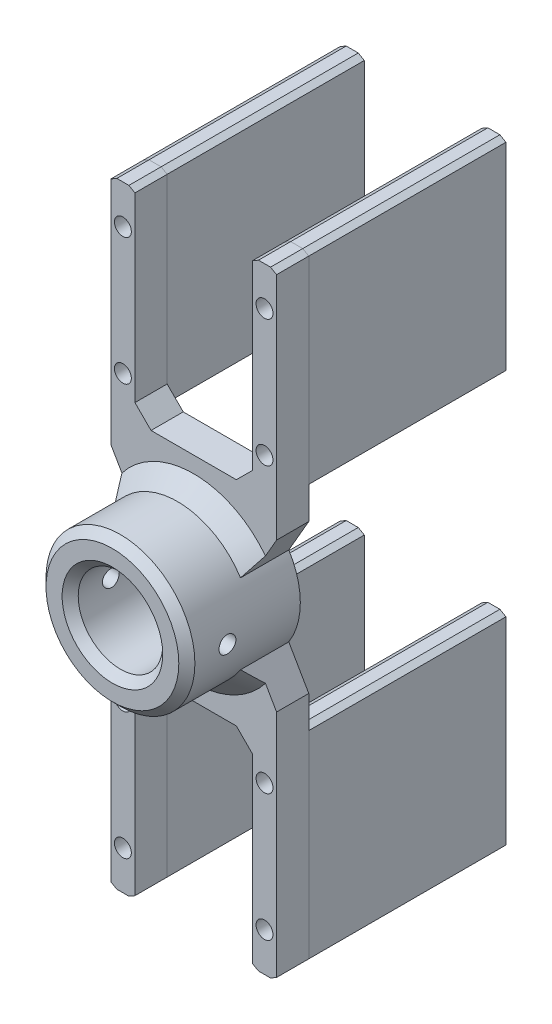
ISO-10303-21;
HEADER;
FILE_DESCRIPTION(('STEP AP214'),'2;1');
FILE_NAME('part.step','',(''),(''),'','','');
FILE_SCHEMA(('AUTOMOTIVE_DESIGN { 1 0 10303 214 1 1 1 1 }'));
ENDSEC;
DATA;
#1=APPLICATION_CONTEXT('core data for automotive mechanical design processes');
#2=APPLICATION_PROTOCOL_DEFINITION('international standard','automotive_design',2000,#1);
#3=PRODUCT_CONTEXT('',#1,'mechanical');
#4=PRODUCT('Part','Part','',(#3));
#5=PRODUCT_RELATED_PRODUCT_CATEGORY('part','',(#4));
#6=PRODUCT_DEFINITION_FORMATION('','',#4);
#7=PRODUCT_DEFINITION_CONTEXT('part definition',#1,'design');
#8=PRODUCT_DEFINITION('design','',#6,#7);
#9=PRODUCT_DEFINITION_SHAPE('','',#8);
#10=(LENGTH_UNIT() NAMED_UNIT(*) SI_UNIT(.MILLI.,.METRE.));
#11=(NAMED_UNIT(*) PLANE_ANGLE_UNIT() SI_UNIT($,.RADIAN.));
#12=(NAMED_UNIT(*) SI_UNIT($,.STERADIAN.) SOLID_ANGLE_UNIT());
#13=UNCERTAINTY_MEASURE_WITH_UNIT(LENGTH_MEASURE(1.E-05),#10,'distance_accuracy_value','');
#14=(GEOMETRIC_REPRESENTATION_CONTEXT(3) GLOBAL_UNCERTAINTY_ASSIGNED_CONTEXT((#13)) GLOBAL_UNIT_ASSIGNED_CONTEXT((#10,
#11,#12)) REPRESENTATION_CONTEXT('',''));
#15=CARTESIAN_POINT('',(0.,0.,0.));
#16=DIRECTION('',(0.,0.,1.));
#17=DIRECTION('',(1.,0.,0.));
#18=AXIS2_PLACEMENT_3D('',#15,#16,#17);
#19=CARTESIAN_POINT('',(0.,0.,-8.));
#20=DIRECTION('',(0.,0.,-1.));
#21=DIRECTION('',(-1.,0.,0.));
#22=AXIS2_PLACEMENT_3D('',#19,#20,#21);
#23=PLANE('',#22);
#24=DIRECTION('',(0.866025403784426,0.500000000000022,0.));
#25=VECTOR('',#24,1.);
#26=CARTESIAN_POINT('',(-20.6,75.6339745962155,-8.));
#27=LINE('',#26,#25);
#28=CARTESIAN_POINT('',(-20.6,75.6339745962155,-8.));
#29=VERTEX_POINT('',#28);
#30=CARTESIAN_POINT('',(-19.1,76.5,-8.));
#31=VERTEX_POINT('',#30);
#32=EDGE_CURVE('E167',#29,#31,#27,.T.);
#33=ORIENTED_EDGE('',*,*,#32,.F.);
#34=DIRECTION('',(0.,1.,0.));
#35=VECTOR('',#34,1.);
#36=CARTESIAN_POINT('',(-20.6,75.6339745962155,-8.));
#37=LINE('',#36,#35);
#38=CARTESIAN_POINT('',(-20.6,26.5,-8.));
#39=VERTEX_POINT('',#38);
#40=EDGE_CURVE('E69',#39,#29,#37,.T.);
#41=ORIENTED_EDGE('',*,*,#40,.F.);
#42=DIRECTION('',(-0.866025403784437,0.500000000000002,0.));
#43=VECTOR('',#42,1.);
#44=CARTESIAN_POINT('',(-20.6,26.5,-8.));
#45=LINE('',#44,#43);
#46=CARTESIAN_POINT('',(-19.1,25.6339745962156,-8.));
#47=VERTEX_POINT('',#46);
#48=EDGE_CURVE('E77',#47,#39,#45,.T.);
#49=ORIENTED_EDGE('',*,*,#48,.F.);
#50=DIRECTION('',(-1.,0.,0.));
#51=VECTOR('',#50,1.);
#52=CARTESIAN_POINT('',(-19.1,25.6339745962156,-8.));
#53=LINE('',#52,#51);
#54=CARTESIAN_POINT('',(-16.1,25.6339745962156,-8.));
#55=VERTEX_POINT('',#54);
#56=EDGE_CURVE('E177',#55,#47,#53,.T.);
#57=ORIENTED_EDGE('',*,*,#56,.F.);
#58=DIRECTION('',(-0.866025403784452,-0.499999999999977,0.));
#59=VECTOR('',#58,1.);
#60=CARTESIAN_POINT('',(-16.1,25.6339745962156,-8.));
#61=LINE('',#60,#59);
#62=CARTESIAN_POINT('',(-14.6,26.5,-8.));
#63=VERTEX_POINT('',#62);
#64=EDGE_CURVE('E175',#63,#55,#61,.T.);
#65=ORIENTED_EDGE('',*,*,#64,.F.);
#66=DIRECTION('',(0.,-1.,0.));
#67=VECTOR('',#66,1.);
#68=CARTESIAN_POINT('',(-14.6,75.6339745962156,-8.));
#69=LINE('',#68,#67);
#70=CARTESIAN_POINT('',(-14.6,75.6339745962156,-8.));
#71=VERTEX_POINT('',#70);
#72=EDGE_CURVE('E173',#71,#63,#69,.T.);
#73=ORIENTED_EDGE('',*,*,#72,.F.);
#74=DIRECTION('',(0.866025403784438,-0.500000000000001,0.));
#75=VECTOR('',#74,1.);
#76=CARTESIAN_POINT('',(-16.1,76.5,-8.));
#77=LINE('',#76,#75);
#78=CARTESIAN_POINT('',(-16.1,76.5,-8.));
#79=VERTEX_POINT('',#78);
#80=EDGE_CURVE('E171',#79,#71,#77,.T.);
#81=ORIENTED_EDGE('',*,*,#80,.F.);
#82=DIRECTION('',(1.,0.,0.));
#83=VECTOR('',#82,1.);
#84=CARTESIAN_POINT('',(-19.1,76.5,-8.));
#85=LINE('',#84,#83);
#86=EDGE_CURVE('E169',#31,#79,#85,.T.);
#87=ORIENTED_EDGE('',*,*,#86,.F.);
#88=EDGE_LOOP('',(#33,#41,#49,#57,#65,#73,#81,#87));
#89=FACE_BOUND('',#88,.T.);
#90=CARTESIAN_POINT('',(-17.6,66.85,-8.));
#91=DIRECTION('',(0.,0.,-1.));
#92=DIRECTION('',(-1.,0.,0.));
#93=AXIS2_PLACEMENT_3D('',#90,#91,#92);
#94=CIRCLE('',#93,1.65);
#95=CARTESIAN_POINT('',(-19.25,66.85,-8.));
#96=VERTEX_POINT('',#95);
#97=EDGE_CURVE('E162',#96,#96,#94,.T.);
#98=ORIENTED_EDGE('',*,*,#97,.T.);
#99=EDGE_LOOP('',(#98));
#100=FACE_BOUND('',#99,.T.);
#101=CARTESIAN_POINT('',(-17.6,35.2839745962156,-8.));
#102=DIRECTION('',(0.,0.,-1.));
#103=DIRECTION('',(1.,0.,0.));
#104=AXIS2_PLACEMENT_3D('',#101,#102,#103);
#105=CIRCLE('',#104,1.65);
#106=CARTESIAN_POINT('',(-15.95,35.2839745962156,-8.));
#107=VERTEX_POINT('',#106);
#108=EDGE_CURVE('E159',#107,#107,#105,.T.);
#109=ORIENTED_EDGE('',*,*,#108,.T.);
#110=EDGE_LOOP('',(#109));
#111=FACE_BOUND('',#110,.T.);
#112=ADVANCED_FACE('F54',(#89,#100,#111),#23,.F.);
#113=CARTESIAN_POINT('',(-20.6,75.6339745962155,-33.));
#114=DIRECTION('',(0.500000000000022,-0.866025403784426,0.));
#115=DIRECTION('',(0.866025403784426,0.500000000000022,0.));
#116=AXIS2_PLACEMENT_3D('',#113,#114,#115);
#117=PLANE('',#116);
#118=ORIENTED_EDGE('',*,*,#32,.T.);
#119=DIRECTION('',(0.,0.,1.));
#120=VECTOR('',#119,1.);
#121=CARTESIAN_POINT('',(-19.1,76.5,-33.));
#122=LINE('',#121,#120);
#123=CARTESIAN_POINT('',(-19.1,76.5,-57.));
#124=VERTEX_POINT('',#123);
#125=EDGE_CURVE('E12',#124,#31,#122,.T.);
#126=ORIENTED_EDGE('',*,*,#125,.F.);
#127=DIRECTION('',(0.866025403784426,0.500000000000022,0.));
#128=VECTOR('',#127,1.);
#129=CARTESIAN_POINT('',(-20.6,75.6339745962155,-57.));
#130=LINE('',#129,#128);
#131=CARTESIAN_POINT('',(-20.6,75.6339745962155,-57.));
#132=VERTEX_POINT('',#131);
#133=EDGE_CURVE('E129',#132,#124,#130,.T.);
#134=ORIENTED_EDGE('',*,*,#133,.F.);
#135=DIRECTION('',(0.,0.,1.));
#136=VECTOR('',#135,1.);
#137=CARTESIAN_POINT('',(-20.6,75.6339745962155,-33.));
#138=LINE('',#137,#136);
#139=EDGE_CURVE('E118',#132,#29,#138,.T.);
#140=ORIENTED_EDGE('',*,*,#139,.T.);
#141=EDGE_LOOP('',(#118,#126,#134,#140));
#142=FACE_BOUND('',#141,.T.);
#143=ADVANCED_FACE('F56',(#142),#117,.F.);
#144=CARTESIAN_POINT('',(-19.1,76.5,-33.));
#145=DIRECTION('',(0.,-1.,0.));
#146=DIRECTION('',(0.,0.,-1.));
#147=AXIS2_PLACEMENT_3D('',#144,#145,#146);
#148=PLANE('',#147);
#149=ORIENTED_EDGE('',*,*,#86,.T.);
#150=DIRECTION('',(0.,0.,1.));
#151=VECTOR('',#150,1.);
#152=CARTESIAN_POINT('',(-16.1,76.5,-33.));
#153=LINE('',#152,#151);
#154=CARTESIAN_POINT('',(-16.1,76.5,-57.));
#155=VERTEX_POINT('',#154);
#156=EDGE_CURVE('E62',#155,#79,#153,.T.);
#157=ORIENTED_EDGE('',*,*,#156,.F.);
#158=DIRECTION('',(1.,0.,0.));
#159=VECTOR('',#158,1.);
#160=CARTESIAN_POINT('',(-19.1,76.5,-57.));
#161=LINE('',#160,#159);
#162=EDGE_CURVE('E133',#124,#155,#161,.T.);
#163=ORIENTED_EDGE('',*,*,#162,.F.);
#164=ORIENTED_EDGE('',*,*,#125,.T.);
#165=EDGE_LOOP('',(#149,#157,#163,#164));
#166=FACE_BOUND('',#165,.T.);
#167=ADVANCED_FACE('F227',(#166),#148,.F.);
#168=CARTESIAN_POINT('',(-16.1,76.5,-33.));
#169=DIRECTION('',(-0.500000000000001,-0.866025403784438,0.));
#170=DIRECTION('',(0.866025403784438,-0.500000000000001,0.));
#171=AXIS2_PLACEMENT_3D('',#168,#169,#170);
#172=PLANE('',#171);
#173=ORIENTED_EDGE('',*,*,#80,.T.);
#174=DIRECTION('',(0.,0.,1.));
#175=VECTOR('',#174,1.);
#176=CARTESIAN_POINT('',(-14.6,75.6339745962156,-33.));
#177=LINE('',#176,#175);
#178=CARTESIAN_POINT('',(-14.6,75.6339745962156,-57.));
#179=VERTEX_POINT('',#178);
#180=EDGE_CURVE('E190',#179,#71,#177,.T.);
#181=ORIENTED_EDGE('',*,*,#180,.F.);
#182=DIRECTION('',(0.866025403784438,-0.500000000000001,0.));
#183=VECTOR('',#182,1.);
#184=CARTESIAN_POINT('',(-16.1,76.5,-57.));
#185=LINE('',#184,#183);
#186=EDGE_CURVE('E143',#155,#179,#185,.T.);
#187=ORIENTED_EDGE('',*,*,#186,.F.);
#188=ORIENTED_EDGE('',*,*,#156,.T.);
#189=EDGE_LOOP('',(#173,#181,#187,#188));
#190=FACE_BOUND('',#189,.T.);
#191=ADVANCED_FACE('F196',(#190),#172,.F.);
#192=CARTESIAN_POINT('',(-14.6,75.6339745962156,-33.));
#193=DIRECTION('',(-1.,0.,0.));
#194=DIRECTION('',(0.,-1.,0.));
#195=AXIS2_PLACEMENT_3D('',#192,#193,#194);
#196=PLANE('',#195);
#197=ORIENTED_EDGE('',*,*,#72,.T.);
#198=DIRECTION('',(0.,0.,1.));
#199=VECTOR('',#198,1.);
#200=CARTESIAN_POINT('',(-14.6,26.5,-33.));
#201=LINE('',#200,#199);
#202=CARTESIAN_POINT('',(-14.6,26.5,-57.));
#203=VERTEX_POINT('',#202);
#204=EDGE_CURVE('E187',#203,#63,#201,.T.);
#205=ORIENTED_EDGE('',*,*,#204,.F.);
#206=DIRECTION('',(0.,-1.,0.));
#207=VECTOR('',#206,1.);
#208=CARTESIAN_POINT('',(-14.6,75.6339745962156,-57.));
#209=LINE('',#208,#207);
#210=EDGE_CURVE('E146',#179,#203,#209,.T.);
#211=ORIENTED_EDGE('',*,*,#210,.F.);
#212=ORIENTED_EDGE('',*,*,#180,.T.);
#213=EDGE_LOOP('',(#197,#205,#211,#212));
#214=FACE_BOUND('',#213,.T.);
#215=ADVANCED_FACE('F204',(#214),#196,.F.);
#216=CARTESIAN_POINT('',(-16.1,25.6339745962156,-33.));
#217=DIRECTION('',(-0.499999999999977,0.866025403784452,0.));
#218=DIRECTION('',(-0.866025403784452,-0.499999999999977,0.));
#219=AXIS2_PLACEMENT_3D('',#216,#217,#218);
#220=PLANE('',#219);
#221=ORIENTED_EDGE('',*,*,#64,.T.);
#222=DIRECTION('',(0.,0.,1.));
#223=VECTOR('',#222,1.);
#224=CARTESIAN_POINT('',(-16.1,25.6339745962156,-33.));
#225=LINE('',#224,#223);
#226=CARTESIAN_POINT('',(-16.1,25.6339745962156,-57.));
#227=VERTEX_POINT('',#226);
#228=EDGE_CURVE('E184',#227,#55,#225,.T.);
#229=ORIENTED_EDGE('',*,*,#228,.F.);
#230=DIRECTION('',(-0.866025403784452,-0.499999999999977,0.));
#231=VECTOR('',#230,1.);
#232=CARTESIAN_POINT('',(-14.6,26.5,-57.));
#233=LINE('',#232,#231);
#234=EDGE_CURVE('E149',#203,#227,#233,.T.);
#235=ORIENTED_EDGE('',*,*,#234,.F.);
#236=ORIENTED_EDGE('',*,*,#204,.T.);
#237=EDGE_LOOP('',(#221,#229,#235,#236));
#238=FACE_BOUND('',#237,.T.);
#239=ADVANCED_FACE('F208',(#238),#220,.F.);
#240=CARTESIAN_POINT('',(-19.1,25.6339745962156,-33.));
#241=DIRECTION('',(0.,1.,0.));
#242=DIRECTION('',(0.,0.,1.));
#243=AXIS2_PLACEMENT_3D('',#240,#241,#242);
#244=PLANE('',#243);
#245=ORIENTED_EDGE('',*,*,#56,.T.);
#246=DIRECTION('',(0.,0.,1.));
#247=VECTOR('',#246,1.);
#248=CARTESIAN_POINT('',(-19.1,25.6339745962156,-33.));
#249=LINE('',#248,#247);
#250=CARTESIAN_POINT('',(-19.1,25.6339745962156,-57.));
#251=VERTEX_POINT('',#250);
#252=EDGE_CURVE('E182',#251,#47,#249,.T.);
#253=ORIENTED_EDGE('',*,*,#252,.F.);
#254=DIRECTION('',(-1.,0.,0.));
#255=VECTOR('',#254,1.);
#256=CARTESIAN_POINT('',(-16.1,25.6339745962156,-57.));
#257=LINE('',#256,#255);
#258=EDGE_CURVE('E152',#227,#251,#257,.T.);
#259=ORIENTED_EDGE('',*,*,#258,.F.);
#260=ORIENTED_EDGE('',*,*,#228,.T.);
#261=EDGE_LOOP('',(#245,#253,#259,#260));
#262=FACE_BOUND('',#261,.T.);
#263=ADVANCED_FACE('F211',(#262),#244,.F.);
#264=CARTESIAN_POINT('',(-20.6,26.5,-33.));
#265=DIRECTION('',(0.500000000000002,0.866025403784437,0.));
#266=DIRECTION('',(-0.866025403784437,0.500000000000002,0.));
#267=AXIS2_PLACEMENT_3D('',#264,#265,#266);
#268=PLANE('',#267);
#269=ORIENTED_EDGE('',*,*,#48,.T.);
#270=DIRECTION('',(0.,0.,1.));
#271=VECTOR('',#270,1.);
#272=CARTESIAN_POINT('',(-20.6,26.5,-33.));
#273=LINE('',#272,#271);
#274=CARTESIAN_POINT('',(-20.6,26.5,-57.));
#275=VERTEX_POINT('',#274);
#276=EDGE_CURVE('E126',#275,#39,#273,.T.);
#277=ORIENTED_EDGE('',*,*,#276,.F.);
#278=DIRECTION('',(-0.866025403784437,0.500000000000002,0.));
#279=VECTOR('',#278,1.);
#280=CARTESIAN_POINT('',(-19.1,25.6339745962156,-57.));
#281=LINE('',#280,#279);
#282=EDGE_CURVE('E139',#251,#275,#281,.T.);
#283=ORIENTED_EDGE('',*,*,#282,.F.);
#284=ORIENTED_EDGE('',*,*,#252,.T.);
#285=EDGE_LOOP('',(#269,#277,#283,#284));
#286=FACE_BOUND('',#285,.T.);
#287=ADVANCED_FACE('F212',(#286),#268,.F.);
#288=CARTESIAN_POINT('',(-20.6,75.6339745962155,-33.));
#289=DIRECTION('',(1.,0.,0.));
#290=DIRECTION('',(0.,1.,0.));
#291=AXIS2_PLACEMENT_3D('',#288,#289,#290);
#292=PLANE('',#291);
#293=ORIENTED_EDGE('',*,*,#40,.T.);
#294=ORIENTED_EDGE('',*,*,#139,.F.);
#295=DIRECTION('',(0.,1.,0.));
#296=VECTOR('',#295,1.);
#297=CARTESIAN_POINT('',(-20.6,26.5,-57.));
#298=LINE('',#297,#296);
#299=EDGE_CURVE('E122',#275,#132,#298,.T.);
#300=ORIENTED_EDGE('',*,*,#299,.F.);
#301=ORIENTED_EDGE('',*,*,#276,.T.);
#302=EDGE_LOOP('',(#293,#294,#300,#301));
#303=FACE_BOUND('',#302,.T.);
#304=ADVANCED_FACE('F120',(#303),#292,.F.);
#305=CARTESIAN_POINT('',(-17.6,66.85,-33.));
#306=DIRECTION('',(0.,0.,1.));
#307=DIRECTION('',(1.,0.,0.));
#308=AXIS2_PLACEMENT_3D('',#305,#306,#307);
#309=CYLINDRICAL_SURFACE('',#308,1.65);
#310=CARTESIAN_POINT('',(-17.6,66.85,-33.));
#311=DIRECTION('',(0.,0.,-1.));
#312=DIRECTION('',(-1.,0.,0.));
#313=AXIS2_PLACEMENT_3D('',#310,#311,#312);
#314=CIRCLE('',#313,1.65);
#315=CARTESIAN_POINT('',(-19.25,66.85,-33.));
#316=VERTEX_POINT('',#315);
#317=EDGE_CURVE('E158',#316,#316,#314,.T.);
#318=ORIENTED_EDGE('',*,*,#317,.T.);
#319=EDGE_LOOP('',(#318));
#320=FACE_BOUND('',#319,.T.);
#321=ORIENTED_EDGE('',*,*,#97,.F.);
#322=EDGE_LOOP('',(#321));
#323=FACE_BOUND('',#322,.T.);
#324=ADVANCED_FACE('F219',(#320,#323),#309,.F.);
#325=CARTESIAN_POINT('',(-17.6,35.2839745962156,-33.));
#326=DIRECTION('',(0.,0.,1.));
#327=DIRECTION('',(1.,0.,0.));
#328=AXIS2_PLACEMENT_3D('',#325,#326,#327);
#329=CYLINDRICAL_SURFACE('',#328,1.65);
#330=CARTESIAN_POINT('',(-17.6,35.2839745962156,-33.));
#331=DIRECTION('',(0.,0.,-1.));
#332=DIRECTION('',(1.,0.,0.));
#333=AXIS2_PLACEMENT_3D('',#330,#331,#332);
#334=CIRCLE('',#333,1.65);
#335=CARTESIAN_POINT('',(-15.95,35.2839745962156,-33.));
#336=VERTEX_POINT('',#335);
#337=EDGE_CURVE('E155',#336,#336,#334,.T.);
#338=ORIENTED_EDGE('',*,*,#337,.T.);
#339=EDGE_LOOP('',(#338));
#340=FACE_BOUND('',#339,.T.);
#341=ORIENTED_EDGE('',*,*,#108,.F.);
#342=EDGE_LOOP('',(#341));
#343=FACE_BOUND('',#342,.T.);
#344=ADVANCED_FACE('F231',(#340,#343),#329,.F.);
#345=CARTESIAN_POINT('',(0.,0.,-33.));
#346=DIRECTION('',(0.,0.,-1.));
#347=DIRECTION('',(-1.,0.,0.));
#348=AXIS2_PLACEMENT_3D('',#345,#346,#347);
#349=PLANE('',#348);
#350=ORIENTED_EDGE('',*,*,#337,.F.);
#351=EDGE_LOOP('',(#350));
#352=FACE_BOUND('',#351,.T.);
#353=ADVANCED_FACE('F235',(#352),#349,.F.);
#354=ORIENTED_EDGE('',*,*,#317,.F.);
#355=EDGE_LOOP('',(#354));
#356=FACE_BOUND('',#355,.T.);
#357=ADVANCED_FACE('F237',(#356),#349,.F.);
#358=CARTESIAN_POINT('',(0.,0.,-57.));
#359=DIRECTION('',(0.,0.,-1.));
#360=DIRECTION('',(-1.,0.,0.));
#361=AXIS2_PLACEMENT_3D('',#358,#359,#360);
#362=PLANE('',#361);
#363=ORIENTED_EDGE('',*,*,#299,.T.);
#364=ORIENTED_EDGE('',*,*,#133,.T.);
#365=ORIENTED_EDGE('',*,*,#162,.T.);
#366=ORIENTED_EDGE('',*,*,#186,.T.);
#367=ORIENTED_EDGE('',*,*,#210,.T.);
#368=ORIENTED_EDGE('',*,*,#234,.T.);
#369=ORIENTED_EDGE('',*,*,#258,.T.);
#370=ORIENTED_EDGE('',*,*,#282,.T.);
#371=EDGE_LOOP('',(#363,#364,#365,#366,#367,#368,#369,#370));
#372=FACE_BOUND('',#371,.T.);
#373=ADVANCED_FACE('F136',(#372),#362,.T.);
#374=CLOSED_SHELL('',(#112,#143,#167,#191,#215,#239,#263,#287,#304,#324,#344,#353,#357,#373));
#375=MANIFOLD_SOLID_BREP('B2',#374);
#376=CARTESIAN_POINT('',(0.,0.,-8.));
#377=DIRECTION('',(0.,0.,-1.));
#378=DIRECTION('',(-1.,0.,0.));
#379=AXIS2_PLACEMENT_3D('',#376,#377,#378);
#380=PLANE('',#379);
#381=DIRECTION('',(0.,1.,0.));
#382=VECTOR('',#381,1.);
#383=CARTESIAN_POINT('',(-20.6,-75.6339745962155,-8.));
#384=LINE('',#383,#382);
#385=CARTESIAN_POINT('',(-20.6,-75.6339745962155,-8.));
#386=VERTEX_POINT('',#385);
#387=CARTESIAN_POINT('',(-20.6,-26.5,-8.));
#388=VERTEX_POINT('',#387);
#389=EDGE_CURVE('E488',#386,#388,#384,.T.);
#390=ORIENTED_EDGE('',*,*,#389,.F.);
#391=DIRECTION('',(-0.86602540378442,0.500000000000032,0.));
#392=VECTOR('',#391,1.);
#393=CARTESIAN_POINT('',(-20.6,-75.6339745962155,-8.));
#394=LINE('',#393,#392);
#395=CARTESIAN_POINT('',(-19.1000000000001,-76.5,-8.));
#396=VERTEX_POINT('',#395);
#397=EDGE_CURVE('E390',#396,#386,#394,.T.);
#398=ORIENTED_EDGE('',*,*,#397,.F.);
#399=DIRECTION('',(-1.,0.,0.));
#400=VECTOR('',#399,1.);
#401=CARTESIAN_POINT('',(-19.1000000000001,-76.5,-8.));
#402=LINE('',#401,#400);
#403=CARTESIAN_POINT('',(-16.1,-76.5,-8.));
#404=VERTEX_POINT('',#403);
#405=EDGE_CURVE('E398',#404,#396,#402,.T.);
#406=ORIENTED_EDGE('',*,*,#405,.F.);
#407=DIRECTION('',(-0.866025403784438,-0.500000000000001,0.));
#408=VECTOR('',#407,1.);
#409=CARTESIAN_POINT('',(-16.1,-76.5,-8.));
#410=LINE('',#409,#408);
#411=CARTESIAN_POINT('',(-14.6,-75.6339745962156,-8.));
#412=VERTEX_POINT('',#411);
#413=EDGE_CURVE('E498',#412,#404,#410,.T.);
#414=ORIENTED_EDGE('',*,*,#413,.F.);
#415=DIRECTION('',(0.,-1.,0.));
#416=VECTOR('',#415,1.);
#417=CARTESIAN_POINT('',(-14.6,-75.6339745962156,-8.));
#418=LINE('',#417,#416);
#419=CARTESIAN_POINT('',(-14.6,-26.5,-8.));
#420=VERTEX_POINT('',#419);
#421=EDGE_CURVE('E496',#420,#412,#418,.T.);
#422=ORIENTED_EDGE('',*,*,#421,.F.);
#423=DIRECTION('',(0.866025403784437,-0.500000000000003,0.));
#424=VECTOR('',#423,1.);
#425=CARTESIAN_POINT('',(-16.1,-25.6339745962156,-8.));
#426=LINE('',#425,#424);
#427=CARTESIAN_POINT('',(-16.1,-25.6339745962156,-8.));
#428=VERTEX_POINT('',#427);
#429=EDGE_CURVE('E494',#428,#420,#426,.T.);
#430=ORIENTED_EDGE('',*,*,#429,.F.);
#431=DIRECTION('',(1.,0.,0.));
#432=VECTOR('',#431,1.);
#433=CARTESIAN_POINT('',(-19.1000000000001,-25.6339745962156,-8.));
#434=LINE('',#433,#432);
#435=CARTESIAN_POINT('',(-19.1000000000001,-25.6339745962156,-8.));
#436=VERTEX_POINT('',#435);
#437=EDGE_CURVE('E492',#436,#428,#434,.T.);
#438=ORIENTED_EDGE('',*,*,#437,.F.);
#439=DIRECTION('',(0.866025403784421,0.50000000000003,0.));
#440=VECTOR('',#439,1.);
#441=CARTESIAN_POINT('',(-20.6,-26.5,-8.));
#442=LINE('',#441,#440);
#443=EDGE_CURVE('E490',#388,#436,#442,.T.);
#444=ORIENTED_EDGE('',*,*,#443,.F.);
#445=EDGE_LOOP('',(#390,#398,#406,#414,#422,#430,#438,#444));
#446=FACE_BOUND('',#445,.T.);
#447=CARTESIAN_POINT('',(-17.6,-35.2839745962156,-8.));
#448=DIRECTION('',(0.,0.,-1.));
#449=DIRECTION('',(-1.,0.,0.));
#450=AXIS2_PLACEMENT_3D('',#447,#448,#449);
#451=CIRCLE('',#450,1.65);
#452=CARTESIAN_POINT('',(-19.25,-35.2839745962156,-8.));
#453=VERTEX_POINT('',#452);
#454=EDGE_CURVE('E483',#453,#453,#451,.T.);
#455=ORIENTED_EDGE('',*,*,#454,.T.);
#456=EDGE_LOOP('',(#455));
#457=FACE_BOUND('',#456,.T.);
#458=CARTESIAN_POINT('',(-17.6,-66.85,-8.));
#459=DIRECTION('',(0.,0.,-1.));
#460=DIRECTION('',(1.,0.,0.));
#461=AXIS2_PLACEMENT_3D('',#458,#459,#460);
#462=CIRCLE('',#461,1.65);
#463=CARTESIAN_POINT('',(-15.95,-66.85,-8.));
#464=VERTEX_POINT('',#463);
#465=EDGE_CURVE('E480',#464,#464,#462,.T.);
#466=ORIENTED_EDGE('',*,*,#465,.T.);
#467=EDGE_LOOP('',(#466));
#468=FACE_BOUND('',#467,.T.);
#469=ADVANCED_FACE('F375',(#446,#457,#468),#380,.F.);
#470=CARTESIAN_POINT('',(-20.6,-75.6339745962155,-33.));
#471=DIRECTION('',(1.,0.,0.));
#472=DIRECTION('',(0.,1.,0.));
#473=AXIS2_PLACEMENT_3D('',#470,#471,#472);
#474=PLANE('',#473);
#475=ORIENTED_EDGE('',*,*,#389,.T.);
#476=DIRECTION('',(0.,0.,1.));
#477=VECTOR('',#476,1.);
#478=CARTESIAN_POINT('',(-20.6,-26.5,-33.));
#479=LINE('',#478,#477);
#480=CARTESIAN_POINT('',(-20.6,-26.5,-57.));
#481=VERTEX_POINT('',#480);
#482=EDGE_CURVE('E52',#481,#388,#479,.T.);
#483=ORIENTED_EDGE('',*,*,#482,.F.);
#484=DIRECTION('',(0.,1.,0.));
#485=VECTOR('',#484,1.);
#486=CARTESIAN_POINT('',(-20.6,-75.6339745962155,-57.));
#487=LINE('',#486,#485);
#488=CARTESIAN_POINT('',(-20.6,-75.6339745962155,-57.));
#489=VERTEX_POINT('',#488);
#490=EDGE_CURVE('E450',#489,#481,#487,.T.);
#491=ORIENTED_EDGE('',*,*,#490,.F.);
#492=DIRECTION('',(0.,0.,1.));
#493=VECTOR('',#492,1.);
#494=CARTESIAN_POINT('',(-20.6,-75.6339745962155,-33.));
#495=LINE('',#494,#493);
#496=EDGE_CURVE('E439',#489,#386,#495,.T.);
#497=ORIENTED_EDGE('',*,*,#496,.T.);
#498=EDGE_LOOP('',(#475,#483,#491,#497));
#499=FACE_BOUND('',#498,.T.);
#500=ADVANCED_FACE('F377',(#499),#474,.F.);
#501=CARTESIAN_POINT('',(-20.6,-26.5,-33.));
#502=DIRECTION('',(0.50000000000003,-0.866025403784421,0.));
#503=DIRECTION('',(0.866025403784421,0.50000000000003,0.));
#504=AXIS2_PLACEMENT_3D('',#501,#502,#503);
#505=PLANE('',#504);
#506=ORIENTED_EDGE('',*,*,#443,.T.);
#507=DIRECTION('',(0.,0.,1.));
#508=VECTOR('',#507,1.);
#509=CARTESIAN_POINT('',(-19.1000000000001,-25.6339745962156,-33.));
#510=LINE('',#509,#508);
#511=CARTESIAN_POINT('',(-19.1000000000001,-25.6339745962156,-57.));
#512=VERTEX_POINT('',#511);
#513=EDGE_CURVE('E383',#512,#436,#510,.T.);
#514=ORIENTED_EDGE('',*,*,#513,.F.);
#515=DIRECTION('',(0.866025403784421,0.50000000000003,0.));
#516=VECTOR('',#515,1.);
#517=CARTESIAN_POINT('',(-20.6,-26.5,-57.));
#518=LINE('',#517,#516);
#519=EDGE_CURVE('E454',#481,#512,#518,.T.);
#520=ORIENTED_EDGE('',*,*,#519,.F.);
#521=ORIENTED_EDGE('',*,*,#482,.T.);
#522=EDGE_LOOP('',(#506,#514,#520,#521));
#523=FACE_BOUND('',#522,.T.);
#524=ADVANCED_FACE('F548',(#523),#505,.F.);
#525=CARTESIAN_POINT('',(-19.1000000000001,-25.6339745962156,-33.));
#526=DIRECTION('',(0.,-1.,0.));
#527=DIRECTION('',(0.,0.,-1.));
#528=AXIS2_PLACEMENT_3D('',#525,#526,#527);
#529=PLANE('',#528);
#530=ORIENTED_EDGE('',*,*,#437,.T.);
#531=DIRECTION('',(0.,0.,1.));
#532=VECTOR('',#531,1.);
#533=CARTESIAN_POINT('',(-16.1,-25.6339745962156,-33.));
#534=LINE('',#533,#532);
#535=CARTESIAN_POINT('',(-16.1,-25.6339745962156,-57.));
#536=VERTEX_POINT('',#535);
#537=EDGE_CURVE('E511',#536,#428,#534,.T.);
#538=ORIENTED_EDGE('',*,*,#537,.F.);
#539=DIRECTION('',(1.,0.,0.));
#540=VECTOR('',#539,1.);
#541=CARTESIAN_POINT('',(-19.1000000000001,-25.6339745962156,-57.));
#542=LINE('',#541,#540);
#543=EDGE_CURVE('E464',#512,#536,#542,.T.);
#544=ORIENTED_EDGE('',*,*,#543,.F.);
#545=ORIENTED_EDGE('',*,*,#513,.T.);
#546=EDGE_LOOP('',(#530,#538,#544,#545));
#547=FACE_BOUND('',#546,.T.);
#548=ADVANCED_FACE('F517',(#547),#529,.F.);
#549=CARTESIAN_POINT('',(-16.1,-25.6339745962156,-33.));
#550=DIRECTION('',(-0.500000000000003,-0.866025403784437,0.));
#551=DIRECTION('',(0.866025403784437,-0.500000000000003,0.));
#552=AXIS2_PLACEMENT_3D('',#549,#550,#551);
#553=PLANE('',#552);
#554=ORIENTED_EDGE('',*,*,#429,.T.);
#555=DIRECTION('',(0.,0.,1.));
#556=VECTOR('',#555,1.);
#557=CARTESIAN_POINT('',(-14.6,-26.5,-33.));
#558=LINE('',#557,#556);
#559=CARTESIAN_POINT('',(-14.6,-26.5,-57.));
#560=VERTEX_POINT('',#559);
#561=EDGE_CURVE('E508',#560,#420,#558,.T.);
#562=ORIENTED_EDGE('',*,*,#561,.F.);
#563=DIRECTION('',(0.866025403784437,-0.500000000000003,0.));
#564=VECTOR('',#563,1.);
#565=CARTESIAN_POINT('',(-16.1,-25.6339745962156,-57.));
#566=LINE('',#565,#564);
#567=EDGE_CURVE('E467',#536,#560,#566,.T.);
#568=ORIENTED_EDGE('',*,*,#567,.F.);
#569=ORIENTED_EDGE('',*,*,#537,.T.);
#570=EDGE_LOOP('',(#554,#562,#568,#569));
#571=FACE_BOUND('',#570,.T.);
#572=ADVANCED_FACE('F525',(#571),#553,.F.);
#573=CARTESIAN_POINT('',(-14.6,-75.6339745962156,-33.));
#574=DIRECTION('',(-1.,0.,0.));
#575=DIRECTION('',(0.,-1.,0.));
#576=AXIS2_PLACEMENT_3D('',#573,#574,#575);
#577=PLANE('',#576);
#578=ORIENTED_EDGE('',*,*,#421,.T.);
#579=DIRECTION('',(0.,0.,1.));
#580=VECTOR('',#579,1.);
#581=CARTESIAN_POINT('',(-14.6,-75.6339745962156,-33.));
#582=LINE('',#581,#580);
#583=CARTESIAN_POINT('',(-14.6,-75.6339745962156,-57.));
#584=VERTEX_POINT('',#583);
#585=EDGE_CURVE('E505',#584,#412,#582,.T.);
#586=ORIENTED_EDGE('',*,*,#585,.F.);
#587=DIRECTION('',(0.,-1.,0.));
#588=VECTOR('',#587,1.);
#589=CARTESIAN_POINT('',(-14.6,-26.5,-57.));
#590=LINE('',#589,#588);
#591=EDGE_CURVE('E470',#560,#584,#590,.T.);
#592=ORIENTED_EDGE('',*,*,#591,.F.);
#593=ORIENTED_EDGE('',*,*,#561,.T.);
#594=EDGE_LOOP('',(#578,#586,#592,#593));
#595=FACE_BOUND('',#594,.T.);
#596=ADVANCED_FACE('F529',(#595),#577,.F.);
#597=CARTESIAN_POINT('',(-16.1,-76.5,-33.));
#598=DIRECTION('',(-0.500000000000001,0.866025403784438,0.));
#599=DIRECTION('',(-0.866025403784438,-0.500000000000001,0.));
#600=AXIS2_PLACEMENT_3D('',#597,#598,#599);
#601=PLANE('',#600);
#602=ORIENTED_EDGE('',*,*,#413,.T.);
#603=DIRECTION('',(0.,0.,1.));
#604=VECTOR('',#603,1.);
#605=CARTESIAN_POINT('',(-16.1,-76.5,-33.));
#606=LINE('',#605,#604);
#607=CARTESIAN_POINT('',(-16.1,-76.5,-57.));
#608=VERTEX_POINT('',#607);
#609=EDGE_CURVE('E503',#608,#404,#606,.T.);
#610=ORIENTED_EDGE('',*,*,#609,.F.);
#611=DIRECTION('',(-0.866025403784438,-0.500000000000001,0.));
#612=VECTOR('',#611,1.);
#613=CARTESIAN_POINT('',(-14.6,-75.6339745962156,-57.));
#614=LINE('',#613,#612);
#615=EDGE_CURVE('E473',#584,#608,#614,.T.);
#616=ORIENTED_EDGE('',*,*,#615,.F.);
#617=ORIENTED_EDGE('',*,*,#585,.T.);
#618=EDGE_LOOP('',(#602,#610,#616,#617));
#619=FACE_BOUND('',#618,.T.);
#620=ADVANCED_FACE('F532',(#619),#601,.F.);
#621=CARTESIAN_POINT('',(-19.1000000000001,-76.5,-33.));
#622=DIRECTION('',(0.,1.,0.));
#623=DIRECTION('',(0.,0.,1.));
#624=AXIS2_PLACEMENT_3D('',#621,#622,#623);
#625=PLANE('',#624);
#626=ORIENTED_EDGE('',*,*,#405,.T.);
#627=DIRECTION('',(0.,0.,1.));
#628=VECTOR('',#627,1.);
#629=CARTESIAN_POINT('',(-19.1000000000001,-76.5,-33.));
#630=LINE('',#629,#628);
#631=CARTESIAN_POINT('',(-19.1000000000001,-76.5,-57.));
#632=VERTEX_POINT('',#631);
#633=EDGE_CURVE('E447',#632,#396,#630,.T.);
#634=ORIENTED_EDGE('',*,*,#633,.F.);
#635=DIRECTION('',(-1.,0.,0.));
#636=VECTOR('',#635,1.);
#637=CARTESIAN_POINT('',(-16.1,-76.5,-57.));
#638=LINE('',#637,#636);
#639=EDGE_CURVE('E460',#608,#632,#638,.T.);
#640=ORIENTED_EDGE('',*,*,#639,.F.);
#641=ORIENTED_EDGE('',*,*,#609,.T.);
#642=EDGE_LOOP('',(#626,#634,#640,#641));
#643=FACE_BOUND('',#642,.T.);
#644=ADVANCED_FACE('F533',(#643),#625,.F.);
#645=CARTESIAN_POINT('',(-20.6,-75.6339745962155,-33.));
#646=DIRECTION('',(0.500000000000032,0.86602540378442,0.));
#647=DIRECTION('',(-0.86602540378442,0.500000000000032,0.));
#648=AXIS2_PLACEMENT_3D('',#645,#646,#647);
#649=PLANE('',#648);
#650=ORIENTED_EDGE('',*,*,#397,.T.);
#651=ORIENTED_EDGE('',*,*,#496,.F.);
#652=DIRECTION('',(-0.86602540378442,0.500000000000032,0.));
#653=VECTOR('',#652,1.);
#654=CARTESIAN_POINT('',(-19.1000000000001,-76.5,-57.));
#655=LINE('',#654,#653);
#656=EDGE_CURVE('E443',#632,#489,#655,.T.);
#657=ORIENTED_EDGE('',*,*,#656,.F.);
#658=ORIENTED_EDGE('',*,*,#633,.T.);
#659=EDGE_LOOP('',(#650,#651,#657,#658));
#660=FACE_BOUND('',#659,.T.);
#661=ADVANCED_FACE('F441',(#660),#649,.F.);
#662=CARTESIAN_POINT('',(-17.6,-35.2839745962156,-33.));
#663=DIRECTION('',(0.,0.,1.));
#664=DIRECTION('',(1.,0.,0.));
#665=AXIS2_PLACEMENT_3D('',#662,#663,#664);
#666=CYLINDRICAL_SURFACE('',#665,1.65);
#667=CARTESIAN_POINT('',(-17.6,-35.2839745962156,-33.));
#668=DIRECTION('',(0.,0.,-1.));
#669=DIRECTION('',(-1.,0.,0.));
#670=AXIS2_PLACEMENT_3D('',#667,#668,#669);
#671=CIRCLE('',#670,1.65);
#672=CARTESIAN_POINT('',(-19.25,-35.2839745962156,-33.));
#673=VERTEX_POINT('',#672);
#674=EDGE_CURVE('E479',#673,#673,#671,.T.);
#675=ORIENTED_EDGE('',*,*,#674,.T.);
#676=EDGE_LOOP('',(#675));
#677=FACE_BOUND('',#676,.T.);
#678=ORIENTED_EDGE('',*,*,#454,.F.);
#679=EDGE_LOOP('',(#678));
#680=FACE_BOUND('',#679,.T.);
#681=ADVANCED_FACE('F540',(#677,#680),#666,.F.);
#682=CARTESIAN_POINT('',(-17.6,-66.85,-33.));
#683=DIRECTION('',(0.,0.,1.));
#684=DIRECTION('',(1.,0.,0.));
#685=AXIS2_PLACEMENT_3D('',#682,#683,#684);
#686=CYLINDRICAL_SURFACE('',#685,1.65);
#687=CARTESIAN_POINT('',(-17.6,-66.85,-33.));
#688=DIRECTION('',(0.,0.,-1.));
#689=DIRECTION('',(1.,0.,0.));
#690=AXIS2_PLACEMENT_3D('',#687,#688,#689);
#691=CIRCLE('',#690,1.65);
#692=CARTESIAN_POINT('',(-15.95,-66.85,-33.));
#693=VERTEX_POINT('',#692);
#694=EDGE_CURVE('E476',#693,#693,#691,.T.);
#695=ORIENTED_EDGE('',*,*,#694,.T.);
#696=EDGE_LOOP('',(#695));
#697=FACE_BOUND('',#696,.T.);
#698=ORIENTED_EDGE('',*,*,#465,.F.);
#699=EDGE_LOOP('',(#698));
#700=FACE_BOUND('',#699,.T.);
#701=ADVANCED_FACE('F552',(#697,#700),#686,.F.);
#702=CARTESIAN_POINT('',(0.,0.,-33.));
#703=DIRECTION('',(0.,0.,-1.));
#704=DIRECTION('',(-1.,0.,0.));
#705=AXIS2_PLACEMENT_3D('',#702,#703,#704);
#706=PLANE('',#705);
#707=ORIENTED_EDGE('',*,*,#694,.F.);
#708=EDGE_LOOP('',(#707));
#709=FACE_BOUND('',#708,.T.);
#710=ADVANCED_FACE('F556',(#709),#706,.F.);
#711=ORIENTED_EDGE('',*,*,#674,.F.);
#712=EDGE_LOOP('',(#711));
#713=FACE_BOUND('',#712,.T.);
#714=ADVANCED_FACE('F558',(#713),#706,.F.);
#715=CARTESIAN_POINT('',(0.,0.,-57.));
#716=DIRECTION('',(0.,0.,-1.));
#717=DIRECTION('',(-1.,0.,0.));
#718=AXIS2_PLACEMENT_3D('',#715,#716,#717);
#719=PLANE('',#718);
#720=ORIENTED_EDGE('',*,*,#656,.T.);
#721=ORIENTED_EDGE('',*,*,#490,.T.);
#722=ORIENTED_EDGE('',*,*,#519,.T.);
#723=ORIENTED_EDGE('',*,*,#543,.T.);
#724=ORIENTED_EDGE('',*,*,#567,.T.);
#725=ORIENTED_EDGE('',*,*,#591,.T.);
#726=ORIENTED_EDGE('',*,*,#615,.T.);
#727=ORIENTED_EDGE('',*,*,#639,.T.);
#728=EDGE_LOOP('',(#720,#721,#722,#723,#724,#725,#726,#727));
#729=FACE_BOUND('',#728,.T.);
#730=ADVANCED_FACE('F457',(#729),#719,.T.);
#731=CLOSED_SHELL('',(#469,#500,#524,#548,#572,#596,#620,#644,#661,#681,#701,#710,#714,#730));
#732=MANIFOLD_SOLID_BREP('B6',#731);
#733=CARTESIAN_POINT('',(0.,0.,-8.));
#734=DIRECTION('',(0.,0.,-1.));
#735=DIRECTION('',(-1.,0.,0.));
#736=AXIS2_PLACEMENT_3D('',#733,#734,#735);
#737=PLANE('',#736);
#738=DIRECTION('',(0.,-1.,0.));
#739=VECTOR('',#738,1.);
#740=CARTESIAN_POINT('',(20.6,75.6339745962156,-8.));
#741=LINE('',#740,#739);
#742=CARTESIAN_POINT('',(20.6,75.6339745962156,-8.));
#743=VERTEX_POINT('',#742);
#744=CARTESIAN_POINT('',(20.6,26.5,-8.));
#745=VERTEX_POINT('',#744);
#746=EDGE_CURVE('E809',#743,#745,#741,.T.);
#747=ORIENTED_EDGE('',*,*,#746,.F.);
#748=DIRECTION('',(0.866025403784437,-0.500000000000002,0.));
#749=VECTOR('',#748,1.);
#750=CARTESIAN_POINT('',(20.6,75.6339745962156,-8.));
#751=LINE('',#750,#749);
#752=CARTESIAN_POINT('',(19.1,76.5,-8.));
#753=VERTEX_POINT('',#752);
#754=EDGE_CURVE('E711',#753,#743,#751,.T.);
#755=ORIENTED_EDGE('',*,*,#754,.F.);
#756=DIRECTION('',(1.,0.,0.));
#757=VECTOR('',#756,1.);
#758=CARTESIAN_POINT('',(19.1,76.5,-8.));
#759=LINE('',#758,#757);
#760=CARTESIAN_POINT('',(16.1,76.5,-8.));
#761=VERTEX_POINT('',#760);
#762=EDGE_CURVE('E719',#761,#753,#759,.T.);
#763=ORIENTED_EDGE('',*,*,#762,.F.);
#764=DIRECTION('',(0.866025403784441,0.499999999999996,0.));
#765=VECTOR('',#764,1.);
#766=CARTESIAN_POINT('',(16.1,76.5,-8.));
#767=LINE('',#766,#765);
#768=CARTESIAN_POINT('',(14.6,75.6339745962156,-8.));
#769=VERTEX_POINT('',#768);
#770=EDGE_CURVE('E819',#769,#761,#767,.T.);
#771=ORIENTED_EDGE('',*,*,#770,.F.);
#772=DIRECTION('',(0.,1.,0.));
#773=VECTOR('',#772,1.);
#774=CARTESIAN_POINT('',(14.6,75.6339745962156,-8.));
#775=LINE('',#774,#773);
#776=CARTESIAN_POINT('',(14.6,26.5,-8.));
#777=VERTEX_POINT('',#776);
#778=EDGE_CURVE('E817',#777,#769,#775,.T.);
#779=ORIENTED_EDGE('',*,*,#778,.F.);
#780=DIRECTION('',(-0.866025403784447,0.499999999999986,0.));
#781=VECTOR('',#780,1.);
#782=CARTESIAN_POINT('',(16.1,25.6339745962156,-8.));
#783=LINE('',#782,#781);
#784=CARTESIAN_POINT('',(16.1,25.6339745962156,-8.));
#785=VERTEX_POINT('',#784);
#786=EDGE_CURVE('E815',#785,#777,#783,.T.);
#787=ORIENTED_EDGE('',*,*,#786,.F.);
#788=DIRECTION('',(-1.,0.,0.));
#789=VECTOR('',#788,1.);
#790=CARTESIAN_POINT('',(19.1,25.6339745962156,-8.));
#791=LINE('',#790,#789);
#792=CARTESIAN_POINT('',(19.1,25.6339745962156,-8.));
#793=VERTEX_POINT('',#792);
#794=EDGE_CURVE('E813',#793,#785,#791,.T.);
#795=ORIENTED_EDGE('',*,*,#794,.F.);
#796=DIRECTION('',(-0.866025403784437,-0.500000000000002,0.));
#797=VECTOR('',#796,1.);
#798=CARTESIAN_POINT('',(20.6,26.5,-8.));
#799=LINE('',#798,#797);
#800=EDGE_CURVE('E811',#745,#793,#799,.T.);
#801=ORIENTED_EDGE('',*,*,#800,.F.);
#802=EDGE_LOOP('',(#747,#755,#763,#771,#779,#787,#795,#801));
#803=FACE_BOUND('',#802,.T.);
#804=CARTESIAN_POINT('',(17.6,35.2839745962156,-8.));
#805=DIRECTION('',(0.,0.,-1.));
#806=DIRECTION('',(-1.,0.,0.));
#807=AXIS2_PLACEMENT_3D('',#804,#805,#806);
#808=CIRCLE('',#807,1.65);
#809=CARTESIAN_POINT('',(15.95,35.2839745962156,-8.));
#810=VERTEX_POINT('',#809);
#811=EDGE_CURVE('E804',#810,#810,#808,.T.);
#812=ORIENTED_EDGE('',*,*,#811,.T.);
#813=EDGE_LOOP('',(#812));
#814=FACE_BOUND('',#813,.T.);
#815=CARTESIAN_POINT('',(17.6,66.85,-8.));
#816=DIRECTION('',(0.,0.,-1.));
#817=DIRECTION('',(1.,0.,0.));
#818=AXIS2_PLACEMENT_3D('',#815,#816,#817);
#819=CIRCLE('',#818,1.65);
#820=CARTESIAN_POINT('',(19.25,66.85,-8.));
#821=VERTEX_POINT('',#820);
#822=EDGE_CURVE('E801',#821,#821,#819,.T.);
#823=ORIENTED_EDGE('',*,*,#822,.T.);
#824=EDGE_LOOP('',(#823));
#825=FACE_BOUND('',#824,.T.);
#826=ADVANCED_FACE('F696',(#803,#814,#825),#737,.F.);
#827=CARTESIAN_POINT('',(20.6,75.6339745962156,-33.));
#828=DIRECTION('',(-1.,0.,0.));
#829=DIRECTION('',(0.,-1.,0.));
#830=AXIS2_PLACEMENT_3D('',#827,#828,#829);
#831=PLANE('',#830);
#832=ORIENTED_EDGE('',*,*,#746,.T.);
#833=DIRECTION('',(0.,0.,1.));
#834=VECTOR('',#833,1.);
#835=CARTESIAN_POINT('',(20.6,26.5,-33.));
#836=LINE('',#835,#834);
#837=CARTESIAN_POINT('',(20.6,26.5,-57.));
#838=VERTEX_POINT('',#837);
#839=EDGE_CURVE('E373',#838,#745,#836,.T.);
#840=ORIENTED_EDGE('',*,*,#839,.F.);
#841=DIRECTION('',(0.,-1.,0.));
#842=VECTOR('',#841,1.);
#843=CARTESIAN_POINT('',(20.6,75.6339745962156,-57.));
#844=LINE('',#843,#842);
#845=CARTESIAN_POINT('',(20.6,75.6339745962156,-57.));
#846=VERTEX_POINT('',#845);
#847=EDGE_CURVE('E771',#846,#838,#844,.T.);
#848=ORIENTED_EDGE('',*,*,#847,.F.);
#849=DIRECTION('',(0.,0.,1.));
#850=VECTOR('',#849,1.);
#851=CARTESIAN_POINT('',(20.6,75.6339745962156,-33.));
#852=LINE('',#851,#850);
#853=EDGE_CURVE('E760',#846,#743,#852,.T.);
#854=ORIENTED_EDGE('',*,*,#853,.T.);
#855=EDGE_LOOP('',(#832,#840,#848,#854));
#856=FACE_BOUND('',#855,.T.);
#857=ADVANCED_FACE('F698',(#856),#831,.F.);
#858=CARTESIAN_POINT('',(20.6,26.5,-33.));
#859=DIRECTION('',(-0.500000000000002,0.866025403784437,0.));
#860=DIRECTION('',(-0.866025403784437,-0.500000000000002,0.));
#861=AXIS2_PLACEMENT_3D('',#858,#859,#860);
#862=PLANE('',#861);
#863=ORIENTED_EDGE('',*,*,#800,.T.);
#864=DIRECTION('',(0.,0.,1.));
#865=VECTOR('',#864,1.);
#866=CARTESIAN_POINT('',(19.1,25.6339745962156,-33.));
#867=LINE('',#866,#865);
#868=CARTESIAN_POINT('',(19.1,25.6339745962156,-57.));
#869=VERTEX_POINT('',#868);
#870=EDGE_CURVE('E704',#869,#793,#867,.T.);
#871=ORIENTED_EDGE('',*,*,#870,.F.);
#872=DIRECTION('',(-0.866025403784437,-0.500000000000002,0.));
#873=VECTOR('',#872,1.);
#874=CARTESIAN_POINT('',(20.6,26.5,-57.));
#875=LINE('',#874,#873);
#876=EDGE_CURVE('E775',#838,#869,#875,.T.);
#877=ORIENTED_EDGE('',*,*,#876,.F.);
#878=ORIENTED_EDGE('',*,*,#839,.T.);
#879=EDGE_LOOP('',(#863,#871,#877,#878));
#880=FACE_BOUND('',#879,.T.);
#881=ADVANCED_FACE('F869',(#880),#862,.F.);
#882=CARTESIAN_POINT('',(19.1,25.6339745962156,-33.));
#883=DIRECTION('',(0.,1.,0.));
#884=DIRECTION('',(0.,0.,1.));
#885=AXIS2_PLACEMENT_3D('',#882,#883,#884);
#886=PLANE('',#885);
#887=ORIENTED_EDGE('',*,*,#794,.T.);
#888=DIRECTION('',(0.,0.,1.));
#889=VECTOR('',#888,1.);
#890=CARTESIAN_POINT('',(16.1,25.6339745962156,-33.));
#891=LINE('',#890,#889);
#892=CARTESIAN_POINT('',(16.1,25.6339745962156,-57.));
#893=VERTEX_POINT('',#892);
#894=EDGE_CURVE('E832',#893,#785,#891,.T.);
#895=ORIENTED_EDGE('',*,*,#894,.F.);
#896=DIRECTION('',(-1.,0.,0.));
#897=VECTOR('',#896,1.);
#898=CARTESIAN_POINT('',(19.1,25.6339745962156,-57.));
#899=LINE('',#898,#897);
#900=EDGE_CURVE('E785',#869,#893,#899,.T.);
#901=ORIENTED_EDGE('',*,*,#900,.F.);
#902=ORIENTED_EDGE('',*,*,#870,.T.);
#903=EDGE_LOOP('',(#887,#895,#901,#902));
#904=FACE_BOUND('',#903,.T.);
#905=ADVANCED_FACE('F838',(#904),#886,.F.);
#906=CARTESIAN_POINT('',(16.1,25.6339745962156,-33.));
#907=DIRECTION('',(0.499999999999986,0.866025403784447,0.));
#908=DIRECTION('',(-0.866025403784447,0.499999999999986,0.));
#909=AXIS2_PLACEMENT_3D('',#906,#907,#908);
#910=PLANE('',#909);
#911=ORIENTED_EDGE('',*,*,#786,.T.);
#912=DIRECTION('',(0.,0.,1.));
#913=VECTOR('',#912,1.);
#914=CARTESIAN_POINT('',(14.6,26.5,-33.));
#915=LINE('',#914,#913);
#916=CARTESIAN_POINT('',(14.6,26.5,-57.));
#917=VERTEX_POINT('',#916);
#918=EDGE_CURVE('E829',#917,#777,#915,.T.);
#919=ORIENTED_EDGE('',*,*,#918,.F.);
#920=DIRECTION('',(-0.866025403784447,0.499999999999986,0.));
#921=VECTOR('',#920,1.);
#922=CARTESIAN_POINT('',(16.1,25.6339745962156,-57.));
#923=LINE('',#922,#921);
#924=EDGE_CURVE('E788',#893,#917,#923,.T.);
#925=ORIENTED_EDGE('',*,*,#924,.F.);
#926=ORIENTED_EDGE('',*,*,#894,.T.);
#927=EDGE_LOOP('',(#911,#919,#925,#926));
#928=FACE_BOUND('',#927,.T.);
#929=ADVANCED_FACE('F846',(#928),#910,.F.);
#930=CARTESIAN_POINT('',(14.6,75.6339745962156,-33.));
#931=DIRECTION('',(1.,0.,0.));
#932=DIRECTION('',(0.,1.,0.));
#933=AXIS2_PLACEMENT_3D('',#930,#931,#932);
#934=PLANE('',#933);
#935=ORIENTED_EDGE('',*,*,#778,.T.);
#936=DIRECTION('',(0.,0.,1.));
#937=VECTOR('',#936,1.);
#938=CARTESIAN_POINT('',(14.6,75.6339745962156,-33.));
#939=LINE('',#938,#937);
#940=CARTESIAN_POINT('',(14.6,75.6339745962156,-57.));
#941=VERTEX_POINT('',#940);
#942=EDGE_CURVE('E826',#941,#769,#939,.T.);
#943=ORIENTED_EDGE('',*,*,#942,.F.);
#944=DIRECTION('',(0.,1.,0.));
#945=VECTOR('',#944,1.);
#946=CARTESIAN_POINT('',(14.6,26.5,-57.));
#947=LINE('',#946,#945);
#948=EDGE_CURVE('E791',#917,#941,#947,.T.);
#949=ORIENTED_EDGE('',*,*,#948,.F.);
#950=ORIENTED_EDGE('',*,*,#918,.T.);
#951=EDGE_LOOP('',(#935,#943,#949,#950));
#952=FACE_BOUND('',#951,.T.);
#953=ADVANCED_FACE('F850',(#952),#934,.F.);
#954=CARTESIAN_POINT('',(16.1,76.5,-33.));
#955=DIRECTION('',(0.499999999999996,-0.866025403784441,0.));
#956=DIRECTION('',(0.866025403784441,0.499999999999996,0.));
#957=AXIS2_PLACEMENT_3D('',#954,#955,#956);
#958=PLANE('',#957);
#959=ORIENTED_EDGE('',*,*,#770,.T.);
#960=DIRECTION('',(0.,0.,1.));
#961=VECTOR('',#960,1.);
#962=CARTESIAN_POINT('',(16.1,76.5,-33.));
#963=LINE('',#962,#961);
#964=CARTESIAN_POINT('',(16.1,76.5,-57.));
#965=VERTEX_POINT('',#964);
#966=EDGE_CURVE('E824',#965,#761,#963,.T.);
#967=ORIENTED_EDGE('',*,*,#966,.F.);
#968=DIRECTION('',(0.866025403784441,0.499999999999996,0.));
#969=VECTOR('',#968,1.);
#970=CARTESIAN_POINT('',(14.6,75.6339745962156,-57.));
#971=LINE('',#970,#969);
#972=EDGE_CURVE('E794',#941,#965,#971,.T.);
#973=ORIENTED_EDGE('',*,*,#972,.F.);
#974=ORIENTED_EDGE('',*,*,#942,.T.);
#975=EDGE_LOOP('',(#959,#967,#973,#974));
#976=FACE_BOUND('',#975,.T.);
#977=ADVANCED_FACE('F853',(#976),#958,.F.);
#978=CARTESIAN_POINT('',(19.1,76.5,-33.));
#979=DIRECTION('',(0.,-1.,0.));
#980=DIRECTION('',(1.,0.,0.));
#981=AXIS2_PLACEMENT_3D('',#978,#979,#980);
#982=PLANE('',#981);
#983=ORIENTED_EDGE('',*,*,#762,.T.);
#984=DIRECTION('',(0.,0.,1.));
#985=VECTOR('',#984,1.);
#986=CARTESIAN_POINT('',(19.1,76.5,-33.));
#987=LINE('',#986,#985);
#988=CARTESIAN_POINT('',(19.1,76.5,-57.));
#989=VERTEX_POINT('',#988);
#990=EDGE_CURVE('E768',#989,#753,#987,.T.);
#991=ORIENTED_EDGE('',*,*,#990,.F.);
#992=DIRECTION('',(1.,0.,0.));
#993=VECTOR('',#992,1.);
#994=CARTESIAN_POINT('',(16.1,76.5,-57.));
#995=LINE('',#994,#993);
#996=EDGE_CURVE('E781',#965,#989,#995,.T.);
#997=ORIENTED_EDGE('',*,*,#996,.F.);
#998=ORIENTED_EDGE('',*,*,#966,.T.);
#999=EDGE_LOOP('',(#983,#991,#997,#998));
#1000=FACE_BOUND('',#999,.T.);
#1001=ADVANCED_FACE('F854',(#1000),#982,.F.);
#1002=CARTESIAN_POINT('',(20.6,75.6339745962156,-33.));
#1003=DIRECTION('',(-0.500000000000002,-0.866025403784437,0.));
#1004=DIRECTION('',(0.866025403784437,-0.500000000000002,0.));
#1005=AXIS2_PLACEMENT_3D('',#1002,#1003,#1004);
#1006=PLANE('',#1005);
#1007=ORIENTED_EDGE('',*,*,#754,.T.);
#1008=ORIENTED_EDGE('',*,*,#853,.F.);
#1009=DIRECTION('',(0.866025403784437,-0.500000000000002,0.));
#1010=VECTOR('',#1009,1.);
#1011=CARTESIAN_POINT('',(19.1,76.5,-57.));
#1012=LINE('',#1011,#1010);
#1013=EDGE_CURVE('E764',#989,#846,#1012,.T.);
#1014=ORIENTED_EDGE('',*,*,#1013,.F.);
#1015=ORIENTED_EDGE('',*,*,#990,.T.);
#1016=EDGE_LOOP('',(#1007,#1008,#1014,#1015));
#1017=FACE_BOUND('',#1016,.T.);
#1018=ADVANCED_FACE('F762',(#1017),#1006,.F.);
#1019=CARTESIAN_POINT('',(17.6,35.2839745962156,-33.));
#1020=DIRECTION('',(0.,0.,1.));
#1021=DIRECTION('',(1.,0.,0.));
#1022=AXIS2_PLACEMENT_3D('',#1019,#1020,#1021);
#1023=CYLINDRICAL_SURFACE('',#1022,1.65);
#1024=CARTESIAN_POINT('',(17.6,35.2839745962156,-33.));
#1025=DIRECTION('',(0.,0.,-1.));
#1026=DIRECTION('',(-1.,0.,0.));
#1027=AXIS2_PLACEMENT_3D('',#1024,#1025,#1026);
#1028=CIRCLE('',#1027,1.65);
#1029=CARTESIAN_POINT('',(15.95,35.2839745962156,-33.));
#1030=VERTEX_POINT('',#1029);
#1031=EDGE_CURVE('E800',#1030,#1030,#1028,.T.);
#1032=ORIENTED_EDGE('',*,*,#1031,.T.);
#1033=EDGE_LOOP('',(#1032));
#1034=FACE_BOUND('',#1033,.T.);
#1035=ORIENTED_EDGE('',*,*,#811,.F.);
#1036=EDGE_LOOP('',(#1035));
#1037=FACE_BOUND('',#1036,.T.);
#1038=ADVANCED_FACE('F861',(#1034,#1037),#1023,.F.);
#1039=CARTESIAN_POINT('',(17.6,66.85,-33.));
#1040=DIRECTION('',(0.,0.,1.));
#1041=DIRECTION('',(1.,0.,0.));
#1042=AXIS2_PLACEMENT_3D('',#1039,#1040,#1041);
#1043=CYLINDRICAL_SURFACE('',#1042,1.65);
#1044=CARTESIAN_POINT('',(17.6,66.85,-33.));
#1045=DIRECTION('',(0.,0.,-1.));
#1046=DIRECTION('',(1.,0.,0.));
#1047=AXIS2_PLACEMENT_3D('',#1044,#1045,#1046);
#1048=CIRCLE('',#1047,1.65);
#1049=CARTESIAN_POINT('',(19.25,66.85,-33.));
#1050=VERTEX_POINT('',#1049);
#1051=EDGE_CURVE('E797',#1050,#1050,#1048,.T.);
#1052=ORIENTED_EDGE('',*,*,#1051,.T.);
#1053=EDGE_LOOP('',(#1052));
#1054=FACE_BOUND('',#1053,.T.);
#1055=ORIENTED_EDGE('',*,*,#822,.F.);
#1056=EDGE_LOOP('',(#1055));
#1057=FACE_BOUND('',#1056,.T.);
#1058=ADVANCED_FACE('F873',(#1054,#1057),#1043,.F.);
#1059=CARTESIAN_POINT('',(0.,0.,-33.));
#1060=DIRECTION('',(0.,0.,-1.));
#1061=DIRECTION('',(-1.,0.,0.));
#1062=AXIS2_PLACEMENT_3D('',#1059,#1060,#1061);
#1063=PLANE('',#1062);
#1064=ORIENTED_EDGE('',*,*,#1051,.F.);
#1065=EDGE_LOOP('',(#1064));
#1066=FACE_BOUND('',#1065,.T.);
#1067=ADVANCED_FACE('F877',(#1066),#1063,.F.);
#1068=ORIENTED_EDGE('',*,*,#1031,.F.);
#1069=EDGE_LOOP('',(#1068));
#1070=FACE_BOUND('',#1069,.T.);
#1071=ADVANCED_FACE('F879',(#1070),#1063,.F.);
#1072=CARTESIAN_POINT('',(0.,0.,-57.));
#1073=DIRECTION('',(0.,0.,-1.));
#1074=DIRECTION('',(-1.,0.,0.));
#1075=AXIS2_PLACEMENT_3D('',#1072,#1073,#1074);
#1076=PLANE('',#1075);
#1077=ORIENTED_EDGE('',*,*,#1013,.T.);
#1078=ORIENTED_EDGE('',*,*,#847,.T.);
#1079=ORIENTED_EDGE('',*,*,#876,.T.);
#1080=ORIENTED_EDGE('',*,*,#900,.T.);
#1081=ORIENTED_EDGE('',*,*,#924,.T.);
#1082=ORIENTED_EDGE('',*,*,#948,.T.);
#1083=ORIENTED_EDGE('',*,*,#972,.T.);
#1084=ORIENTED_EDGE('',*,*,#996,.T.);
#1085=EDGE_LOOP('',(#1077,#1078,#1079,#1080,#1081,#1082,#1083,#1084));
#1086=FACE_BOUND('',#1085,.T.);
#1087=ADVANCED_FACE('F778',(#1086),#1076,.T.);
#1088=CLOSED_SHELL('',(#826,#857,#881,#905,#929,#953,#977,#1001,#1018,#1038,#1058,#1067,#1071,#1087));
#1089=MANIFOLD_SOLID_BREP('B46',#1088);
#1090=CARTESIAN_POINT('',(0.,0.,-8.));
#1091=DIRECTION('',(0.,0.,-1.));
#1092=DIRECTION('',(-1.,0.,0.));
#1093=AXIS2_PLACEMENT_3D('',#1090,#1091,#1092);
#1094=PLANE('',#1093);
#1095=DIRECTION('',(-0.866025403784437,-0.500000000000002,0.));
#1096=VECTOR('',#1095,1.);
#1097=CARTESIAN_POINT('',(20.6,-75.6339745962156,-8.));
#1098=LINE('',#1097,#1096);
#1099=CARTESIAN_POINT('',(20.6,-75.6339745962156,-8.));
#1100=VERTEX_POINT('',#1099);
#1101=CARTESIAN_POINT('',(19.1,-76.5,-8.));
#1102=VERTEX_POINT('',#1101);
#1103=EDGE_CURVE('E1129',#1100,#1102,#1098,.T.);
#1104=ORIENTED_EDGE('',*,*,#1103,.F.);
#1105=DIRECTION('',(0.,-1.,0.));
#1106=VECTOR('',#1105,1.);
#1107=CARTESIAN_POINT('',(20.6,-75.6339745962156,-8.));
#1108=LINE('',#1107,#1106);
#1109=CARTESIAN_POINT('',(20.6,-26.5,-8.));
#1110=VERTEX_POINT('',#1109);
#1111=EDGE_CURVE('E1031',#1110,#1100,#1108,.T.);
#1112=ORIENTED_EDGE('',*,*,#1111,.F.);
#1113=DIRECTION('',(0.866025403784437,-0.500000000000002,0.));
#1114=VECTOR('',#1113,1.);
#1115=CARTESIAN_POINT('',(20.6,-26.5,-8.));
#1116=LINE('',#1115,#1114);
#1117=CARTESIAN_POINT('',(19.1,-25.6339745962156,-8.));
#1118=VERTEX_POINT('',#1117);
#1119=EDGE_CURVE('E1039',#1118,#1110,#1116,.T.);
#1120=ORIENTED_EDGE('',*,*,#1119,.F.);
#1121=DIRECTION('',(1.,0.,0.));
#1122=VECTOR('',#1121,1.);
#1123=CARTESIAN_POINT('',(19.1,-25.6339745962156,-8.));
#1124=LINE('',#1123,#1122);
#1125=CARTESIAN_POINT('',(16.1,-25.6339745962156,-8.));
#1126=VERTEX_POINT('',#1125);
#1127=EDGE_CURVE('E1139',#1126,#1118,#1124,.T.);
#1128=ORIENTED_EDGE('',*,*,#1127,.F.);
#1129=DIRECTION('',(0.866025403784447,0.499999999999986,0.));
#1130=VECTOR('',#1129,1.);
#1131=CARTESIAN_POINT('',(16.1,-25.6339745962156,-8.));
#1132=LINE('',#1131,#1130);
#1133=CARTESIAN_POINT('',(14.6,-26.5,-8.));
#1134=VERTEX_POINT('',#1133);
#1135=EDGE_CURVE('E1137',#1134,#1126,#1132,.T.);
#1136=ORIENTED_EDGE('',*,*,#1135,.F.);
#1137=DIRECTION('',(0.,1.,0.));
#1138=VECTOR('',#1137,1.);
#1139=CARTESIAN_POINT('',(14.6,-75.6339745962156,-8.));
#1140=LINE('',#1139,#1138);
#1141=CARTESIAN_POINT('',(14.6,-75.6339745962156,-8.));
#1142=VERTEX_POINT('',#1141);
#1143=EDGE_CURVE('E1135',#1142,#1134,#1140,.T.);
#1144=ORIENTED_EDGE('',*,*,#1143,.F.);
#1145=DIRECTION('',(-0.866025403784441,0.499999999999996,0.));
#1146=VECTOR('',#1145,1.);
#1147=CARTESIAN_POINT('',(16.1,-76.5,-8.));
#1148=LINE('',#1147,#1146);
#1149=CARTESIAN_POINT('',(16.1,-76.5,-8.));
#1150=VERTEX_POINT('',#1149);
#1151=EDGE_CURVE('E1133',#1150,#1142,#1148,.T.);
#1152=ORIENTED_EDGE('',*,*,#1151,.F.);
#1153=DIRECTION('',(-1.,0.,0.));
#1154=VECTOR('',#1153,1.);
#1155=CARTESIAN_POINT('',(19.1,-76.5,-8.));
#1156=LINE('',#1155,#1154);
#1157=EDGE_CURVE('E1131',#1102,#1150,#1156,.T.);
#1158=ORIENTED_EDGE('',*,*,#1157,.F.);
#1159=EDGE_LOOP('',(#1104,#1112,#1120,#1128,#1136,#1144,#1152,#1158));
#1160=FACE_BOUND('',#1159,.T.);
#1161=CARTESIAN_POINT('',(17.6,-66.85,-8.));
#1162=DIRECTION('',(0.,0.,-1.));
#1163=DIRECTION('',(-1.,0.,0.));
#1164=AXIS2_PLACEMENT_3D('',#1161,#1162,#1163);
#1165=CIRCLE('',#1164,1.65);
#1166=CARTESIAN_POINT('',(15.95,-66.85,-8.));
#1167=VERTEX_POINT('',#1166);
#1168=EDGE_CURVE('E1124',#1167,#1167,#1165,.T.);
#1169=ORIENTED_EDGE('',*,*,#1168,.T.);
#1170=EDGE_LOOP('',(#1169));
#1171=FACE_BOUND('',#1170,.T.);
#1172=CARTESIAN_POINT('',(17.6,-35.2839745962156,-8.));
#1173=DIRECTION('',(0.,0.,-1.));
#1174=DIRECTION('',(1.,0.,0.));
#1175=AXIS2_PLACEMENT_3D('',#1172,#1173,#1174);
#1176=CIRCLE('',#1175,1.65);
#1177=CARTESIAN_POINT('',(19.25,-35.2839745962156,-8.));
#1178=VERTEX_POINT('',#1177);
#1179=EDGE_CURVE('E1121',#1178,#1178,#1176,.T.);
#1180=ORIENTED_EDGE('',*,*,#1179,.T.);
#1181=EDGE_LOOP('',(#1180));
#1182=FACE_BOUND('',#1181,.T.);
#1183=ADVANCED_FACE('F1016',(#1160,#1171,#1182),#1094,.F.);
#1184=CARTESIAN_POINT('',(20.6,-75.6339745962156,-33.));
#1185=DIRECTION('',(-0.500000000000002,0.866025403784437,0.));
#1186=DIRECTION('',(-0.866025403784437,-0.500000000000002,0.));
#1187=AXIS2_PLACEMENT_3D('',#1184,#1185,#1186);
#1188=PLANE('',#1187);
#1189=ORIENTED_EDGE('',*,*,#1103,.T.);
#1190=DIRECTION('',(0.,0.,1.));
#1191=VECTOR('',#1190,1.);
#1192=CARTESIAN_POINT('',(19.1,-76.5,-33.));
#1193=LINE('',#1192,#1191);
#1194=CARTESIAN_POINT('',(19.1,-76.5,-57.));
#1195=VERTEX_POINT('',#1194);
#1196=EDGE_CURVE('E694',#1195,#1102,#1193,.T.);
#1197=ORIENTED_EDGE('',*,*,#1196,.F.);
#1198=DIRECTION('',(-0.866025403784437,-0.500000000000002,0.));
#1199=VECTOR('',#1198,1.);
#1200=CARTESIAN_POINT('',(20.6,-75.6339745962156,-57.));
#1201=LINE('',#1200,#1199);
#1202=CARTESIAN_POINT('',(20.6,-75.6339745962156,-57.));
#1203=VERTEX_POINT('',#1202);
#1204=EDGE_CURVE('E1091',#1203,#1195,#1201,.T.);
#1205=ORIENTED_EDGE('',*,*,#1204,.F.);
#1206=DIRECTION('',(0.,0.,1.));
#1207=VECTOR('',#1206,1.);
#1208=CARTESIAN_POINT('',(20.6,-75.6339745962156,-33.));
#1209=LINE('',#1208,#1207);
#1210=EDGE_CURVE('E1080',#1203,#1100,#1209,.T.);
#1211=ORIENTED_EDGE('',*,*,#1210,.T.);
#1212=EDGE_LOOP('',(#1189,#1197,#1205,#1211));
#1213=FACE_BOUND('',#1212,.T.);
#1214=ADVANCED_FACE('F1018',(#1213),#1188,.F.);
#1215=CARTESIAN_POINT('',(19.1,-76.5,-33.));
#1216=DIRECTION('',(0.,1.,0.));
#1217=DIRECTION('',(-1.,0.,0.));
#1218=AXIS2_PLACEMENT_3D('',#1215,#1216,#1217);
#1219=PLANE('',#1218);
#1220=ORIENTED_EDGE('',*,*,#1157,.T.);
#1221=DIRECTION('',(0.,0.,1.));
#1222=VECTOR('',#1221,1.);
#1223=CARTESIAN_POINT('',(16.1,-76.5,-33.));
#1224=LINE('',#1223,#1222);
#1225=CARTESIAN_POINT('',(16.1,-76.5,-57.));
#1226=VERTEX_POINT('',#1225);
#1227=EDGE_CURVE('E1024',#1226,#1150,#1224,.T.);
#1228=ORIENTED_EDGE('',*,*,#1227,.F.);
#1229=DIRECTION('',(-1.,0.,0.));
#1230=VECTOR('',#1229,1.);
#1231=CARTESIAN_POINT('',(19.1,-76.5,-57.));
#1232=LINE('',#1231,#1230);
#1233=EDGE_CURVE('E1095',#1195,#1226,#1232,.T.);
#1234=ORIENTED_EDGE('',*,*,#1233,.F.);
#1235=ORIENTED_EDGE('',*,*,#1196,.T.);
#1236=EDGE_LOOP('',(#1220,#1228,#1234,#1235));
#1237=FACE_BOUND('',#1236,.T.);
#1238=ADVANCED_FACE('F1189',(#1237),#1219,.F.);
#1239=CARTESIAN_POINT('',(16.1,-76.5,-33.));
#1240=DIRECTION('',(0.499999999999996,0.866025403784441,0.));
#1241=DIRECTION('',(-0.866025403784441,0.499999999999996,0.));
#1242=AXIS2_PLACEMENT_3D('',#1239,#1240,#1241);
#1243=PLANE('',#1242);
#1244=ORIENTED_EDGE('',*,*,#1151,.T.);
#1245=DIRECTION('',(0.,0.,1.));
#1246=VECTOR('',#1245,1.);
#1247=CARTESIAN_POINT('',(14.6,-75.6339745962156,-33.));
#1248=LINE('',#1247,#1246);
#1249=CARTESIAN_POINT('',(14.6,-75.6339745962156,-57.));
#1250=VERTEX_POINT('',#1249);
#1251=EDGE_CURVE('E1152',#1250,#1142,#1248,.T.);
#1252=ORIENTED_EDGE('',*,*,#1251,.F.);
#1253=DIRECTION('',(-0.866025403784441,0.499999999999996,0.));
#1254=VECTOR('',#1253,1.);
#1255=CARTESIAN_POINT('',(16.1,-76.5,-57.));
#1256=LINE('',#1255,#1254);
#1257=EDGE_CURVE('E1105',#1226,#1250,#1256,.T.);
#1258=ORIENTED_EDGE('',*,*,#1257,.F.);
#1259=ORIENTED_EDGE('',*,*,#1227,.T.);
#1260=EDGE_LOOP('',(#1244,#1252,#1258,#1259));
#1261=FACE_BOUND('',#1260,.T.);
#1262=ADVANCED_FACE('F1158',(#1261),#1243,.F.);
#1263=CARTESIAN_POINT('',(14.6,-75.6339745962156,-33.));
#1264=DIRECTION('',(1.,0.,0.));
#1265=DIRECTION('',(0.,1.,0.));
#1266=AXIS2_PLACEMENT_3D('',#1263,#1264,#1265);
#1267=PLANE('',#1266);
#1268=ORIENTED_EDGE('',*,*,#1143,.T.);
#1269=DIRECTION('',(0.,0.,1.));
#1270=VECTOR('',#1269,1.);
#1271=CARTESIAN_POINT('',(14.6,-26.5,-33.));
#1272=LINE('',#1271,#1270);
#1273=CARTESIAN_POINT('',(14.6,-26.5,-57.));
#1274=VERTEX_POINT('',#1273);
#1275=EDGE_CURVE('E1149',#1274,#1134,#1272,.T.);
#1276=ORIENTED_EDGE('',*,*,#1275,.F.);
#1277=DIRECTION('',(0.,1.,0.));
#1278=VECTOR('',#1277,1.);
#1279=CARTESIAN_POINT('',(14.6,-75.6339745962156,-57.));
#1280=LINE('',#1279,#1278);
#1281=EDGE_CURVE('E1108',#1250,#1274,#1280,.T.);
#1282=ORIENTED_EDGE('',*,*,#1281,.F.);
#1283=ORIENTED_EDGE('',*,*,#1251,.T.);
#1284=EDGE_LOOP('',(#1268,#1276,#1282,#1283));
#1285=FACE_BOUND('',#1284,.T.);
#1286=ADVANCED_FACE('F1166',(#1285),#1267,.F.);
#1287=CARTESIAN_POINT('',(16.1,-25.6339745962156,-33.));
#1288=DIRECTION('',(0.499999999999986,-0.866025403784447,0.));
#1289=DIRECTION('',(0.866025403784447,0.499999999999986,0.));
#1290=AXIS2_PLACEMENT_3D('',#1287,#1288,#1289);
#1291=PLANE('',#1290);
#1292=ORIENTED_EDGE('',*,*,#1135,.T.);
#1293=DIRECTION('',(0.,0.,1.));
#1294=VECTOR('',#1293,1.);
#1295=CARTESIAN_POINT('',(16.1,-25.6339745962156,-33.));
#1296=LINE('',#1295,#1294);
#1297=CARTESIAN_POINT('',(16.1,-25.6339745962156,-57.));
#1298=VERTEX_POINT('',#1297);
#1299=EDGE_CURVE('E1146',#1298,#1126,#1296,.T.);
#1300=ORIENTED_EDGE('',*,*,#1299,.F.);
#1301=DIRECTION('',(0.866025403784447,0.499999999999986,0.));
#1302=VECTOR('',#1301,1.);
#1303=CARTESIAN_POINT('',(14.6,-26.5,-57.));
#1304=LINE('',#1303,#1302);
#1305=EDGE_CURVE('E1111',#1274,#1298,#1304,.T.);
#1306=ORIENTED_EDGE('',*,*,#1305,.F.);
#1307=ORIENTED_EDGE('',*,*,#1275,.T.);
#1308=EDGE_LOOP('',(#1292,#1300,#1306,#1307));
#1309=FACE_BOUND('',#1308,.T.);
#1310=ADVANCED_FACE('F1170',(#1309),#1291,.F.);
#1311=CARTESIAN_POINT('',(19.1,-25.6339745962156,-33.));
#1312=DIRECTION('',(0.,-1.,0.));
#1313=DIRECTION('',(0.,0.,-1.));
#1314=AXIS2_PLACEMENT_3D('',#1311,#1312,#1313);
#1315=PLANE('',#1314);
#1316=ORIENTED_EDGE('',*,*,#1127,.T.);
#1317=DIRECTION('',(0.,0.,1.));
#1318=VECTOR('',#1317,1.);
#1319=CARTESIAN_POINT('',(19.1,-25.6339745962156,-33.));
#1320=LINE('',#1319,#1318);
#1321=CARTESIAN_POINT('',(19.1,-25.6339745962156,-57.));
#1322=VERTEX_POINT('',#1321);
#1323=EDGE_CURVE('E1144',#1322,#1118,#1320,.T.);
#1324=ORIENTED_EDGE('',*,*,#1323,.F.);
#1325=DIRECTION('',(1.,0.,0.));
#1326=VECTOR('',#1325,1.);
#1327=CARTESIAN_POINT('',(16.1,-25.6339745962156,-57.));
#1328=LINE('',#1327,#1326);
#1329=EDGE_CURVE('E1114',#1298,#1322,#1328,.T.);
#1330=ORIENTED_EDGE('',*,*,#1329,.F.);
#1331=ORIENTED_EDGE('',*,*,#1299,.T.);
#1332=EDGE_LOOP('',(#1316,#1324,#1330,#1331));
#1333=FACE_BOUND('',#1332,.T.);
#1334=ADVANCED_FACE('F1173',(#1333),#1315,.F.);
#1335=CARTESIAN_POINT('',(20.6,-26.5,-33.));
#1336=DIRECTION('',(-0.500000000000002,-0.866025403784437,0.));
#1337=DIRECTION('',(0.866025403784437,-0.500000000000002,0.));
#1338=AXIS2_PLACEMENT_3D('',#1335,#1336,#1337);
#1339=PLANE('',#1338);
#1340=ORIENTED_EDGE('',*,*,#1119,.T.);
#1341=DIRECTION('',(0.,0.,1.));
#1342=VECTOR('',#1341,1.);
#1343=CARTESIAN_POINT('',(20.6,-26.5,-33.));
#1344=LINE('',#1343,#1342);
#1345=CARTESIAN_POINT('',(20.6,-26.5,-57.));
#1346=VERTEX_POINT('',#1345);
#1347=EDGE_CURVE('E1088',#1346,#1110,#1344,.T.);
#1348=ORIENTED_EDGE('',*,*,#1347,.F.);
#1349=DIRECTION('',(0.866025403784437,-0.500000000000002,0.));
#1350=VECTOR('',#1349,1.);
#1351=CARTESIAN_POINT('',(19.1,-25.6339745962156,-57.));
#1352=LINE('',#1351,#1350);
#1353=EDGE_CURVE('E1101',#1322,#1346,#1352,.T.);
#1354=ORIENTED_EDGE('',*,*,#1353,.F.);
#1355=ORIENTED_EDGE('',*,*,#1323,.T.);
#1356=EDGE_LOOP('',(#1340,#1348,#1354,#1355));
#1357=FACE_BOUND('',#1356,.T.);
#1358=ADVANCED_FACE('F1174',(#1357),#1339,.F.);
#1359=CARTESIAN_POINT('',(20.6,-75.6339745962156,-33.));
#1360=DIRECTION('',(-1.,0.,0.));
#1361=DIRECTION('',(0.,-1.,0.));
#1362=AXIS2_PLACEMENT_3D('',#1359,#1360,#1361);
#1363=PLANE('',#1362);
#1364=ORIENTED_EDGE('',*,*,#1111,.T.);
#1365=ORIENTED_EDGE('',*,*,#1210,.F.);
#1366=DIRECTION('',(0.,-1.,0.));
#1367=VECTOR('',#1366,1.);
#1368=CARTESIAN_POINT('',(20.6,-26.5,-57.));
#1369=LINE('',#1368,#1367);
#1370=EDGE_CURVE('E1084',#1346,#1203,#1369,.T.);
#1371=ORIENTED_EDGE('',*,*,#1370,.F.);
#1372=ORIENTED_EDGE('',*,*,#1347,.T.);
#1373=EDGE_LOOP('',(#1364,#1365,#1371,#1372));
#1374=FACE_BOUND('',#1373,.T.);
#1375=ADVANCED_FACE('F1082',(#1374),#1363,.F.);
#1376=CARTESIAN_POINT('',(17.6,-66.85,-33.));
#1377=DIRECTION('',(0.,0.,1.));
#1378=DIRECTION('',(1.,0.,0.));
#1379=AXIS2_PLACEMENT_3D('',#1376,#1377,#1378);
#1380=CYLINDRICAL_SURFACE('',#1379,1.65);
#1381=CARTESIAN_POINT('',(17.6,-66.85,-33.));
#1382=DIRECTION('',(0.,0.,-1.));
#1383=DIRECTION('',(-1.,0.,0.));
#1384=AXIS2_PLACEMENT_3D('',#1381,#1382,#1383);
#1385=CIRCLE('',#1384,1.65);
#1386=CARTESIAN_POINT('',(15.95,-66.85,-33.));
#1387=VERTEX_POINT('',#1386);
#1388=EDGE_CURVE('E1120',#1387,#1387,#1385,.T.);
#1389=ORIENTED_EDGE('',*,*,#1388,.T.);
#1390=EDGE_LOOP('',(#1389));
#1391=FACE_BOUND('',#1390,.T.);
#1392=ORIENTED_EDGE('',*,*,#1168,.F.);
#1393=EDGE_LOOP('',(#1392));
#1394=FACE_BOUND('',#1393,.T.);
#1395=ADVANCED_FACE('F1181',(#1391,#1394),#1380,.F.);
#1396=CARTESIAN_POINT('',(17.6,-35.2839745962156,-33.));
#1397=DIRECTION('',(0.,0.,1.));
#1398=DIRECTION('',(1.,0.,0.));
#1399=AXIS2_PLACEMENT_3D('',#1396,#1397,#1398);
#1400=CYLINDRICAL_SURFACE('',#1399,1.65);
#1401=CARTESIAN_POINT('',(17.6,-35.2839745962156,-33.));
#1402=DIRECTION('',(0.,0.,-1.));
#1403=DIRECTION('',(1.,0.,0.));
#1404=AXIS2_PLACEMENT_3D('',#1401,#1402,#1403);
#1405=CIRCLE('',#1404,1.65);
#1406=CARTESIAN_POINT('',(19.25,-35.2839745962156,-33.));
#1407=VERTEX_POINT('',#1406);
#1408=EDGE_CURVE('E1117',#1407,#1407,#1405,.T.);
#1409=ORIENTED_EDGE('',*,*,#1408,.T.);
#1410=EDGE_LOOP('',(#1409));
#1411=FACE_BOUND('',#1410,.T.);
#1412=ORIENTED_EDGE('',*,*,#1179,.F.);
#1413=EDGE_LOOP('',(#1412));
#1414=FACE_BOUND('',#1413,.T.);
#1415=ADVANCED_FACE('F1193',(#1411,#1414),#1400,.F.);
#1416=CARTESIAN_POINT('',(0.,0.,-33.));
#1417=DIRECTION('',(0.,0.,-1.));
#1418=DIRECTION('',(-1.,0.,0.));
#1419=AXIS2_PLACEMENT_3D('',#1416,#1417,#1418);
#1420=PLANE('',#1419);
#1421=ORIENTED_EDGE('',*,*,#1408,.F.);
#1422=EDGE_LOOP('',(#1421));
#1423=FACE_BOUND('',#1422,.T.);
#1424=ADVANCED_FACE('F1197',(#1423),#1420,.F.);
#1425=ORIENTED_EDGE('',*,*,#1388,.F.);
#1426=EDGE_LOOP('',(#1425));
#1427=FACE_BOUND('',#1426,.T.);
#1428=ADVANCED_FACE('F1199',(#1427),#1420,.F.);
#1429=CARTESIAN_POINT('',(0.,0.,-57.));
#1430=DIRECTION('',(0.,0.,-1.));
#1431=DIRECTION('',(-1.,0.,0.));
#1432=AXIS2_PLACEMENT_3D('',#1429,#1430,#1431);
#1433=PLANE('',#1432);
#1434=ORIENTED_EDGE('',*,*,#1370,.T.);
#1435=ORIENTED_EDGE('',*,*,#1204,.T.);
#1436=ORIENTED_EDGE('',*,*,#1233,.T.);
#1437=ORIENTED_EDGE('',*,*,#1257,.T.);
#1438=ORIENTED_EDGE('',*,*,#1281,.T.);
#1439=ORIENTED_EDGE('',*,*,#1305,.T.);
#1440=ORIENTED_EDGE('',*,*,#1329,.T.);
#1441=ORIENTED_EDGE('',*,*,#1353,.T.);
#1442=EDGE_LOOP('',(#1434,#1435,#1436,#1437,#1438,#1439,#1440,#1441));
#1443=FACE_BOUND('',#1442,.T.);
#1444=ADVANCED_FACE('F1098',(#1443),#1433,.T.);
#1445=CLOSED_SHELL('',(#1183,#1214,#1238,#1262,#1286,#1310,#1334,#1358,#1375,#1395,#1415,#1424,
#1428,#1444));
#1446=MANIFOLD_SOLID_BREP('B367',#1445);
#1447=CARTESIAN_POINT('',(0.,0.,20.2));
#1448=DIRECTION('',(0.,0.,1.));
#1449=DIRECTION('',(1.,0.,0.));
#1450=AXIS2_PLACEMENT_3D('',#1447,#1448,#1449);
#1451=PLANE('',#1450);
#1452=CARTESIAN_POINT('',(0.,0.,20.2));
#1453=DIRECTION('',(0.,0.,1.));
#1454=DIRECTION('',(1.,0.,0.));
#1455=AXIS2_PLACEMENT_3D('',#1452,#1453,#1454);
#1456=CIRCLE('',#1455,12.5);
#1457=CARTESIAN_POINT('',(12.5,0.,20.2));
#1458=VERTEX_POINT('',#1457);
#1459=EDGE_CURVE('E1337',#1458,#1458,#1456,.F.);
#1460=ORIENTED_EDGE('',*,*,#1459,.T.);
#1461=EDGE_LOOP('',(#1460));
#1462=FACE_BOUND('',#1461,.T.);
#1463=CARTESIAN_POINT('',(0.,0.,20.2));
#1464=DIRECTION('',(0.,0.,1.));
#1465=DIRECTION('',(1.,0.,0.));
#1466=AXIS2_PLACEMENT_3D('',#1463,#1464,#1465);
#1467=CIRCLE('',#1466,16.5);
#1468=CARTESIAN_POINT('',(16.5,0.,20.2));
#1469=VERTEX_POINT('',#1468);
#1470=EDGE_CURVE('E2498',#1469,#1469,#1467,.T.);
#1471=ORIENTED_EDGE('',*,*,#1470,.T.);
#1472=EDGE_LOOP('',(#1471));
#1473=FACE_BOUND('',#1472,.T.);
#1474=ADVANCED_FACE('F1327',(#1462,#1473),#1451,.T.);
#1475=CARTESIAN_POINT('',(0.,0.,20.2));
#1476=DIRECTION('',(0.,0.,-1.));
#1477=DIRECTION('',(-1.,0.,0.));
#1478=AXIS2_PLACEMENT_3D('',#1475,#1476,#1477);
#1479=CYLINDRICAL_SURFACE('',#1478,18.5);
#1480=CARTESIAN_POINT('',(0.,0.,18.2));
#1481=DIRECTION('',(0.,0.,1.));
#1482=DIRECTION('',(1.,0.,0.));
#1483=AXIS2_PLACEMENT_3D('',#1480,#1481,#1482);
#1484=CIRCLE('',#1483,18.5);
#1485=CARTESIAN_POINT('',(18.5,0.,18.2));
#1486=VERTEX_POINT('',#1485);
#1487=EDGE_CURVE('E1014',#1486,#1486,#1484,.F.);
#1488=ORIENTED_EDGE('',*,*,#1487,.T.);
#1489=EDGE_LOOP('',(#1488));
#1490=FACE_BOUND('',#1489,.T.);
#1491=CARTESIAN_POINT('',(-18.5,0.,8.));
#1492=CARTESIAN_POINT('',(-18.4999984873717,-0.11755225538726,8.00000504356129));
#1493=CARTESIAN_POINT('',(-18.4988677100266,-0.235180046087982,8.0099036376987));
#1494=CARTESIAN_POINT('',(-18.4944655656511,-0.467168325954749,8.04923814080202));
#1495=CARTESIAN_POINT('',(-18.4911919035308,-0.581525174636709,8.07869499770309));
#1496=CARTESIAN_POINT('',(-18.4828731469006,-0.803579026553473,8.1562720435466));
#1497=CARTESIAN_POINT('',(-18.4778291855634,-0.911280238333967,8.204380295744));
#1498=CARTESIAN_POINT('',(-18.466532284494,-1.1170578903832,8.31786978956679));
#1499=CARTESIAN_POINT('',(-18.4602795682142,-1.21513610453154,8.38324783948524));
#1500=CARTESIAN_POINT('',(-18.4472323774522,-1.3993547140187,8.52974166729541));
#1501=CARTESIAN_POINT('',(-18.4404357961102,-1.48544475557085,8.61092058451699));
#1502=CARTESIAN_POINT('',(-18.4270840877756,-1.64280996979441,8.78657653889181));
#1503=CARTESIAN_POINT('',(-18.4205289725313,-1.71408442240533,8.8810542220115));
#1504=CARTESIAN_POINT('',(-18.4083813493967,-1.8399786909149,9.0809476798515));
#1505=CARTESIAN_POINT('',(-18.4027915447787,-1.89455205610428,9.18639288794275));
#1506=CARTESIAN_POINT('',(-18.3932345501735,-1.9851984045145,9.40502501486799));
#1507=CARTESIAN_POINT('',(-18.3892673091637,-2.02127196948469,9.518211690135));
#1508=CARTESIAN_POINT('',(-18.3834243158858,-2.07374336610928,9.74859504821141));
#1509=CARTESIAN_POINT('',(-18.3815395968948,-2.09022557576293,9.86577228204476));
#1510=CARTESIAN_POINT('',(-18.3800474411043,-2.1033073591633,10.1012437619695));
#1511=CARTESIAN_POINT('',(-18.3804399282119,-2.09990759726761,10.2195379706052));
#1512=CARTESIAN_POINT('',(-18.3834496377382,-2.0733913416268,10.45330054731));
#1513=CARTESIAN_POINT('',(-18.3860564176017,-2.05036739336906,10.5687795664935));
#1514=CARTESIAN_POINT('',(-18.39318470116,-1.98540053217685,10.7942239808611));
#1515=CARTESIAN_POINT('',(-18.3977062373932,-1.94345729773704,10.9041892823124));
#1516=CARTESIAN_POINT('',(-18.4081665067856,-1.8417417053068,11.1157746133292));
#1517=CARTESIAN_POINT('',(-18.4141084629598,-1.78192872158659,11.217374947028));
#1518=CARTESIAN_POINT('',(-18.426737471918,-1.64620062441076,11.4091306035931));
#1519=CARTESIAN_POINT('',(-18.4334245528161,-1.57028490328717,11.4992854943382));
#1520=CARTESIAN_POINT('',(-18.4468368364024,-1.40399146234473,11.6661285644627));
#1521=CARTESIAN_POINT('',(-18.4535620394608,-1.31353389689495,11.7427371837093));
#1522=CARTESIAN_POINT('',(-18.4662570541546,-1.12100057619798,11.8796949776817));
#1523=CARTESIAN_POINT('',(-18.472226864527,-1.01892480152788,11.9400441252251));
#1524=CARTESIAN_POINT('',(-18.4827412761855,-0.805994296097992,12.0427683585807));
#1525=CARTESIAN_POINT('',(-18.4872855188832,-0.695137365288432,12.0851389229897));
#1526=CARTESIAN_POINT('',(-18.494433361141,-0.467819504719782,12.1506424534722));
#1527=CARTESIAN_POINT('',(-18.4970370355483,-0.35135879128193,12.1737761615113));
#1528=CARTESIAN_POINT('',(-18.5000007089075,-0.116827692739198,12.2000472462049));
#1529=CARTESIAN_POINT('',(-18.5003730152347,0.00123025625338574,12.2032943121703));
#1530=CARTESIAN_POINT('',(-18.4988651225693,0.236208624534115,12.1899887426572));
#1531=CARTESIAN_POINT('',(-18.4969849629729,0.353129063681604,12.1734364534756));
#1532=CARTESIAN_POINT('',(-18.4911911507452,0.582193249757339,12.1210931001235));
#1533=CARTESIAN_POINT('',(-18.4872829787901,0.694348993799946,12.0853538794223));
#1534=CARTESIAN_POINT('',(-18.4778711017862,0.911074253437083,11.9957047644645));
#1535=CARTESIAN_POINT('',(-18.4723673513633,1.01564355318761,11.9417943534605));
#1536=CARTESIAN_POINT('',(-18.4603481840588,1.21472042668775,11.817064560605));
#1537=CARTESIAN_POINT('',(-18.4538285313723,1.30918294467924,11.7461736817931));
#1538=CARTESIAN_POINT('',(-18.4405214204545,1.48490754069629,11.5895970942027));
#1539=CARTESIAN_POINT('',(-18.4337339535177,1.56616918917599,11.5039109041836));
#1540=CARTESIAN_POINT('',(-18.4206186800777,1.71357046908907,11.3196950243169));
#1541=CARTESIAN_POINT('',(-18.4142931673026,1.77963773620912,11.2211072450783));
#1542=CARTESIAN_POINT('',(-18.4028544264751,1.8942761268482,11.0141708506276));
#1543=CARTESIAN_POINT('',(-18.3977411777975,1.94284754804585,10.9058224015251));
#1544=CARTESIAN_POINT('',(-18.3893209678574,2.02099637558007,10.6826809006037));
#1545=CARTESIAN_POINT('',(-18.3860100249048,2.05061567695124,10.5679026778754));
#1546=CARTESIAN_POINT('',(-18.3815574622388,2.09015491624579,10.3349620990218));
#1547=CARTESIAN_POINT('',(-18.3804157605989,2.10007559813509,10.2167998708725));
#1548=CARTESIAN_POINT('',(-18.3804330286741,2.09992396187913,9.98116502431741));
#1549=CARTESIAN_POINT('',(-18.3815789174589,2.08996531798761,9.86369231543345));
#1550=CARTESIAN_POINT('',(-18.3860142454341,2.05057728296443,9.63210106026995));
#1551=CARTESIAN_POINT('',(-18.389303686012,2.02114787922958,9.51798251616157));
#1552=CARTESIAN_POINT('',(-18.397651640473,1.94368727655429,9.29634718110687));
#1553=CARTESIAN_POINT('',(-18.4027097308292,1.89566053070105,9.18882881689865));
#1554=CARTESIAN_POINT('',(-18.41402584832,1.78237988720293,8.98335987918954));
#1555=CARTESIAN_POINT('',(-18.4202838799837,1.7171259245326,8.88540934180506));
#1556=CARTESIAN_POINT('',(-18.433337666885,1.57081855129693,8.70127446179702));
#1557=CARTESIAN_POINT('',(-18.4401361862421,1.48968034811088,8.61515768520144));
#1558=CARTESIAN_POINT('',(-18.4534800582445,1.31408148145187,8.45771590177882));
#1559=CARTESIAN_POINT('',(-18.4600253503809,1.21961765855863,8.3863944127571));
#1560=CARTESIAN_POINT('',(-18.4721476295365,1.01971238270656,8.26038153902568));
#1561=CARTESIAN_POINT('',(-18.4777214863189,0.914237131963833,8.20574350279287));
#1562=CARTESIAN_POINT('',(-18.4872402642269,0.695608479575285,8.11503013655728));
#1563=CARTESIAN_POINT('',(-18.4911869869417,0.582463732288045,8.07893426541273));
#1564=CARTESIAN_POINT('',(-18.4960356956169,0.390588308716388,8.03514639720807));
#1565=CARTESIAN_POINT('',(-18.497515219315,0.313076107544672,8.02198498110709));
#1566=CARTESIAN_POINT('',(-18.4994978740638,0.15705384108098,8.00441012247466));
#1567=CARTESIAN_POINT('',(-18.5000010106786,0.078543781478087,7.99999663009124));
#1568=CARTESIAN_POINT('',(-18.5,0.,8.));
#1569=B_SPLINE_CURVE_WITH_KNOTS('',3,(#1491,#1492,#1493,#1494,#1495,#1496,#1497,#1498,#1499,
#1500,#1501,#1502,#1503,#1504,#1505,#1506,#1507,#1508,#1509,#1510,#1511,#1512,#1513,#1514,#1515,
#1516,#1517,#1518,#1519,#1520,#1521,#1522,#1523,#1524,#1525,#1526,#1527,#1528,#1529,#1530,#1531,
#1532,#1533,#1534,#1535,#1536,#1537,#1538,#1539,#1540,#1541,#1542,#1543,#1544,#1545,#1546,#1547,
#1548,#1549,#1550,#1551,#1552,#1553,#1554,#1555,#1556,#1557,#1558,#1559,#1560,#1561,#1562,#1563,
#1564,#1565,#1566,#1567,#1568),.UNSPECIFIED.,.T.,.F.,(4,2,2,2,2,2,2,2,2,2,2,2,2,2,2,2,2,2,2,2,2,
2,2,2,2,2,2,2,2,2,2,2,2,2,2,2,2,2,4),(0.,0.352369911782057,0.705117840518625,1.05764038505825,
1.41009782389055,1.76399369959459,2.11790677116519,2.47279541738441,2.82767290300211,
3.18101636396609,3.534348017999,3.88602256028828,4.23770307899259,4.59018928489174,
4.94268879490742,5.29719440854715,5.65170061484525,6.00629592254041,6.36087755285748,
6.71350163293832,7.06611954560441,7.41778943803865,7.76946933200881,8.12265685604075,
8.4758558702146,8.83070370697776,9.18554550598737,9.53960016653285,9.89364145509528,
10.2456640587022,10.5976868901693,10.9496254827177,11.3015654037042,11.6554379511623,
12.0093945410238,12.364471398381,12.7191540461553,12.9545950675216,13.1900347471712),.UNSPECIFIED.);
#1570=CARTESIAN_POINT('',(-18.5,0.,8.));
#1571=VERTEX_POINT('',#1570);
#1572=EDGE_CURVE('E1584',#1571,#1571,#1569,.T.);
#1573=ORIENTED_EDGE('',*,*,#1572,.F.);
#1574=EDGE_LOOP('',(#1573));
#1575=FACE_BOUND('',#1574,.T.);
#1576=CARTESIAN_POINT('',(18.5,0.,12.2));
#1577=CARTESIAN_POINT('',(18.4999984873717,0.11755225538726,12.1999949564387));
#1578=CARTESIAN_POINT('',(18.4988677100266,0.235180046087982,12.1900963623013));
#1579=CARTESIAN_POINT('',(18.4944655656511,0.467168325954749,12.150761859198));
#1580=CARTESIAN_POINT('',(18.4911919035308,0.581525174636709,12.1213050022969));
#1581=CARTESIAN_POINT('',(18.4828731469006,0.803579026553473,12.0437279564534));
#1582=CARTESIAN_POINT('',(18.4778291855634,0.911280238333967,11.995619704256));
#1583=CARTESIAN_POINT('',(18.466532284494,1.1170578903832,11.8821302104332));
#1584=CARTESIAN_POINT('',(18.4602795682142,1.21513610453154,11.8167521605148));
#1585=CARTESIAN_POINT('',(18.4472323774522,1.3993547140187,11.6702583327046));
#1586=CARTESIAN_POINT('',(18.4404357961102,1.48544475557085,11.589079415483));
#1587=CARTESIAN_POINT('',(18.4270840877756,1.64280996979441,11.4134234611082));
#1588=CARTESIAN_POINT('',(18.4205289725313,1.71408442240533,11.3189457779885));
#1589=CARTESIAN_POINT('',(18.4083813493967,1.8399786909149,11.1190523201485));
#1590=CARTESIAN_POINT('',(18.4027915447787,1.89455205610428,11.0136071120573));
#1591=CARTESIAN_POINT('',(18.3932345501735,1.9851984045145,10.794974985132));
#1592=CARTESIAN_POINT('',(18.3892673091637,2.02127196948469,10.681788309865));
#1593=CARTESIAN_POINT('',(18.3834243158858,2.07374336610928,10.4514049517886));
#1594=CARTESIAN_POINT('',(18.3815395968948,2.09022557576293,10.3342277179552));
#1595=CARTESIAN_POINT('',(18.3800474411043,2.1033073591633,10.0987562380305));
#1596=CARTESIAN_POINT('',(18.3804399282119,2.09990759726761,9.98046202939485));
#1597=CARTESIAN_POINT('',(18.3834496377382,2.0733913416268,9.74669945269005));
#1598=CARTESIAN_POINT('',(18.3860564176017,2.05036739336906,9.63122043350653));
#1599=CARTESIAN_POINT('',(18.39318470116,1.98540053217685,9.40577601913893));
#1600=CARTESIAN_POINT('',(18.3977062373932,1.94345729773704,9.29581071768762));
#1601=CARTESIAN_POINT('',(18.4081665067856,1.8417417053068,9.08422538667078));
#1602=CARTESIAN_POINT('',(18.4141084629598,1.78192872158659,8.982625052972));
#1603=CARTESIAN_POINT('',(18.426737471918,1.64620062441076,8.7908693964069));
#1604=CARTESIAN_POINT('',(18.4334245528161,1.57028490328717,8.70071450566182));
#1605=CARTESIAN_POINT('',(18.4468368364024,1.40399146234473,8.53387143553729));
#1606=CARTESIAN_POINT('',(18.4535620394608,1.31353389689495,8.45726281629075));
#1607=CARTESIAN_POINT('',(18.4662570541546,1.12100057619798,8.32030502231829));
#1608=CARTESIAN_POINT('',(18.472226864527,1.01892480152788,8.25995587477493));
#1609=CARTESIAN_POINT('',(18.4827412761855,0.805994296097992,8.1572316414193));
#1610=CARTESIAN_POINT('',(18.4872855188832,0.695137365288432,8.11486107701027));
#1611=CARTESIAN_POINT('',(18.494433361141,0.467819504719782,8.04935754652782));
#1612=CARTESIAN_POINT('',(18.4970370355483,0.35135879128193,8.02622383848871));
#1613=CARTESIAN_POINT('',(18.5000007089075,0.116827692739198,7.99995275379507));
#1614=CARTESIAN_POINT('',(18.5003730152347,-0.00123025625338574,7.99670568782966));
#1615=CARTESIAN_POINT('',(18.4988651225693,-0.236208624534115,8.01001125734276));
#1616=CARTESIAN_POINT('',(18.4969849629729,-0.353129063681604,8.02656354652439));
#1617=CARTESIAN_POINT('',(18.4911911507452,-0.582193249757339,8.07890689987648));
#1618=CARTESIAN_POINT('',(18.4872829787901,-0.694348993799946,8.11464612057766));
#1619=CARTESIAN_POINT('',(18.4778711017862,-0.911074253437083,8.20429523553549));
#1620=CARTESIAN_POINT('',(18.4723673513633,-1.01564355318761,8.25820564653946));
#1621=CARTESIAN_POINT('',(18.4603481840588,-1.21472042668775,8.38293543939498));
#1622=CARTESIAN_POINT('',(18.4538285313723,-1.30918294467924,8.45382631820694));
#1623=CARTESIAN_POINT('',(18.4405214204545,-1.48490754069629,8.61040290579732));
#1624=CARTESIAN_POINT('',(18.4337339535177,-1.56616918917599,8.69608909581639));
#1625=CARTESIAN_POINT('',(18.4206186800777,-1.71357046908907,8.88030497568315));
#1626=CARTESIAN_POINT('',(18.4142931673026,-1.77963773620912,8.97889275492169));
#1627=CARTESIAN_POINT('',(18.4028544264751,-1.8942761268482,9.18582914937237));
#1628=CARTESIAN_POINT('',(18.3977411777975,-1.94284754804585,9.29417759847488));
#1629=CARTESIAN_POINT('',(18.3893209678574,-2.02099637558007,9.51731909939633));
#1630=CARTESIAN_POINT('',(18.3860100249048,-2.05061567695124,9.63209732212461));
#1631=CARTESIAN_POINT('',(18.3815574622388,-2.09015491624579,9.86503790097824));
#1632=CARTESIAN_POINT('',(18.3804157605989,-2.10007559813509,9.98320012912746));
#1633=CARTESIAN_POINT('',(18.3804330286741,-2.09992396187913,10.2188349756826));
#1634=CARTESIAN_POINT('',(18.3815789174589,-2.08996531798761,10.3363076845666));
#1635=CARTESIAN_POINT('',(18.3860142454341,-2.05057728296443,10.56789893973));
#1636=CARTESIAN_POINT('',(18.389303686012,-2.02114787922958,10.6820174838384));
#1637=CARTESIAN_POINT('',(18.397651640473,-1.94368727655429,10.9036528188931));
#1638=CARTESIAN_POINT('',(18.4027097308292,-1.89566053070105,11.0111711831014));
#1639=CARTESIAN_POINT('',(18.41402584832,-1.78237988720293,11.2166401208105));
#1640=CARTESIAN_POINT('',(18.4202838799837,-1.7171259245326,11.3145906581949));
#1641=CARTESIAN_POINT('',(18.433337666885,-1.57081855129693,11.498725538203));
#1642=CARTESIAN_POINT('',(18.4401361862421,-1.48968034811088,11.5848423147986));
#1643=CARTESIAN_POINT('',(18.4534800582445,-1.31408148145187,11.7422840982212));
#1644=CARTESIAN_POINT('',(18.4600253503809,-1.21961765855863,11.8136055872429));
#1645=CARTESIAN_POINT('',(18.4721476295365,-1.01971238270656,11.9396184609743));
#1646=CARTESIAN_POINT('',(18.4777214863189,-0.914237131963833,11.9942564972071));
#1647=CARTESIAN_POINT('',(18.4872402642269,-0.695608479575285,12.0849698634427));
#1648=CARTESIAN_POINT('',(18.4911869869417,-0.582463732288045,12.1210657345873));
#1649=CARTESIAN_POINT('',(18.4960356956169,-0.390588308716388,12.1648536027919));
#1650=CARTESIAN_POINT('',(18.497515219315,-0.313076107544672,12.1780150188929));
#1651=CARTESIAN_POINT('',(18.4994978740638,-0.15705384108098,12.1955898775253));
#1652=CARTESIAN_POINT('',(18.5000010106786,-0.078543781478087,12.2000033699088));
#1653=CARTESIAN_POINT('',(18.5,0.,12.2));
#1654=B_SPLINE_CURVE_WITH_KNOTS('',3,(#1576,#1577,#1578,#1579,#1580,#1581,#1582,#1583,#1584,
#1585,#1586,#1587,#1588,#1589,#1590,#1591,#1592,#1593,#1594,#1595,#1596,#1597,#1598,#1599,#1600,
#1601,#1602,#1603,#1604,#1605,#1606,#1607,#1608,#1609,#1610,#1611,#1612,#1613,#1614,#1615,#1616,
#1617,#1618,#1619,#1620,#1621,#1622,#1623,#1624,#1625,#1626,#1627,#1628,#1629,#1630,#1631,#1632,
#1633,#1634,#1635,#1636,#1637,#1638,#1639,#1640,#1641,#1642,#1643,#1644,#1645,#1646,#1647,#1648,
#1649,#1650,#1651,#1652,#1653),.UNSPECIFIED.,.T.,.F.,(4,2,2,2,2,2,2,2,2,2,2,2,2,2,2,2,2,2,2,2,2,
2,2,2,2,2,2,2,2,2,2,2,2,2,2,2,2,2,4),(0.,0.352369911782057,0.705117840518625,1.05764038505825,
1.41009782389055,1.76399369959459,2.11790677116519,2.47279541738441,2.82767290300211,
3.18101636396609,3.534348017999,3.88602256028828,4.23770307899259,4.59018928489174,
4.94268879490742,5.29719440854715,5.65170061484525,6.00629592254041,6.36087755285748,
6.71350163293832,7.06611954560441,7.41778943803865,7.76946933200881,8.12265685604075,
8.4758558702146,8.83070370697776,9.18554550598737,9.53960016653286,9.89364145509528,
10.2456640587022,10.5976868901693,10.9496254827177,11.3015654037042,11.6554379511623,
12.0093945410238,12.364471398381,12.7191540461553,12.9545950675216,13.1900347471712),.UNSPECIFIED.);
#1655=CARTESIAN_POINT('',(18.5,0.,12.2));
#1656=VERTEX_POINT('',#1655);
#1657=EDGE_CURVE('E1579',#1656,#1656,#1654,.T.);
#1658=ORIENTED_EDGE('',*,*,#1657,.T.);
#1659=EDGE_LOOP('',(#1658));
#1660=FACE_BOUND('',#1659,.T.);
#1661=CARTESIAN_POINT('',(0.,0.,4.00000000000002));
#1662=DIRECTION('',(0.,0.,-1.));
#1663=DIRECTION('',(-1.,0.,0.));
#1664=AXIS2_PLACEMENT_3D('',#1661,#1662,#1663);
#1665=CIRCLE('',#1664,18.5);
#1666=CARTESIAN_POINT('',(-15.631636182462,-9.8945414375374,4.00000000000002));
#1667=VERTEX_POINT('',#1666);
#1668=CARTESIAN_POINT('',(15.631636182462,-9.89454143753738,4.00000000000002));
#1669=VERTEX_POINT('',#1668);
#1670=EDGE_CURVE('E1801',#1667,#1669,#1665,.F.);
#1671=ORIENTED_EDGE('',*,*,#1670,.T.);
#1672=DIRECTION('',(0.,0.,1.));
#1673=VECTOR('',#1672,1.);
#1674=CARTESIAN_POINT('',(15.631636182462,-9.89454143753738,-8.));
#1675=LINE('',#1674,#1673);
#1676=CARTESIAN_POINT('',(15.631636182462,-9.89454143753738,-8.));
#1677=VERTEX_POINT('',#1676);
#1678=EDGE_CURVE('E1878',#1677,#1669,#1675,.T.);
#1679=ORIENTED_EDGE('',*,*,#1678,.F.);
#1680=CARTESIAN_POINT('',(0.,0.,-8.));
#1681=DIRECTION('',(0.,0.,-1.));
#1682=DIRECTION('',(-1.,0.,0.));
#1683=AXIS2_PLACEMENT_3D('',#1680,#1681,#1682);
#1684=CIRCLE('',#1683,18.5);
#1685=CARTESIAN_POINT('',(15.631636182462,9.89454143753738,-8.));
#1686=VERTEX_POINT('',#1685);
#1687=EDGE_CURVE('E2065',#1686,#1677,#1684,.T.);
#1688=ORIENTED_EDGE('',*,*,#1687,.F.);
#1689=DIRECTION('',(0.,0.,1.));
#1690=VECTOR('',#1689,1.);
#1691=CARTESIAN_POINT('',(15.631636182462,9.89454143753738,-8.));
#1692=LINE('',#1691,#1690);
#1693=CARTESIAN_POINT('',(15.631636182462,9.89454143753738,4.00000000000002));
#1694=VERTEX_POINT('',#1693);
#1695=EDGE_CURVE('E1914',#1686,#1694,#1692,.T.);
#1696=ORIENTED_EDGE('',*,*,#1695,.T.);
#1697=CARTESIAN_POINT('',(0.,0.,4.00000000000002));
#1698=DIRECTION('',(0.,0.,-1.));
#1699=DIRECTION('',(-1.,0.,0.));
#1700=AXIS2_PLACEMENT_3D('',#1697,#1698,#1699);
#1701=CIRCLE('',#1700,18.5);
#1702=CARTESIAN_POINT('',(-15.631636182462,9.89454143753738,4.00000000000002));
#1703=VERTEX_POINT('',#1702);
#1704=EDGE_CURVE('E1807',#1694,#1703,#1701,.F.);
#1705=ORIENTED_EDGE('',*,*,#1704,.T.);
#1706=DIRECTION('',(0.,0.,1.));
#1707=VECTOR('',#1706,1.);
#1708=CARTESIAN_POINT('',(-15.631636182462,9.89454143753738,-8.));
#1709=LINE('',#1708,#1707);
#1710=CARTESIAN_POINT('',(-15.631636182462,9.89454143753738,-8.));
#1711=VERTEX_POINT('',#1710);
#1712=EDGE_CURVE('E1956',#1711,#1703,#1709,.T.);
#1713=ORIENTED_EDGE('',*,*,#1712,.F.);
#1714=CARTESIAN_POINT('',(0.,0.,-8.));
#1715=DIRECTION('',(0.,0.,-1.));
#1716=DIRECTION('',(-1.,0.,0.));
#1717=AXIS2_PLACEMENT_3D('',#1714,#1715,#1716);
#1718=CIRCLE('',#1717,18.5);
#1719=CARTESIAN_POINT('',(-15.631636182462,-9.8945414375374,-8.));
#1720=VERTEX_POINT('',#1719);
#1721=EDGE_CURVE('E2110',#1720,#1711,#1718,.T.);
#1722=ORIENTED_EDGE('',*,*,#1721,.F.);
#1723=DIRECTION('',(0.,0.,1.));
#1724=VECTOR('',#1723,1.);
#1725=CARTESIAN_POINT('',(-15.631636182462,-9.8945414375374,-8.));
#1726=LINE('',#1725,#1724);
#1727=EDGE_CURVE('E1882',#1720,#1667,#1726,.T.);
#1728=ORIENTED_EDGE('',*,*,#1727,.T.);
#1729=EDGE_LOOP('',(#1671,#1679,#1688,#1696,#1705,#1713,#1722,#1728));
#1730=FACE_BOUND('',#1729,.T.);
#1731=ADVANCED_FACE('F1629',(#1490,#1575,#1660,#1730),#1479,.T.);
#1732=CARTESIAN_POINT('',(0.,0.,20.2));
#1733=DIRECTION('',(0.,0.,-1.));
#1734=DIRECTION('',(-1.,0.,0.));
#1735=AXIS2_PLACEMENT_3D('',#1732,#1733,#1734);
#1736=CYLINDRICAL_SURFACE('',#1735,10.5);
#1737=CARTESIAN_POINT('',(0.,0.,-5.99999999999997));
#1738=DIRECTION('',(0.,0.,-1.));
#1739=DIRECTION('',(-1.,0.,0.));
#1740=AXIS2_PLACEMENT_3D('',#1737,#1738,#1739);
#1741=CIRCLE('',#1740,10.5);
#1742=CARTESIAN_POINT('',(-10.5,0.,-5.99999999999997));
#1743=VERTEX_POINT('',#1742);
#1744=EDGE_CURVE('E2199',#1743,#1743,#1741,.T.);
#1745=ORIENTED_EDGE('',*,*,#1744,.T.);
#1746=EDGE_LOOP('',(#1745));
#1747=FACE_BOUND('',#1746,.T.);
#1748=CARTESIAN_POINT('',(0.,0.,18.2));
#1749=DIRECTION('',(0.,0.,1.));
#1750=DIRECTION('',(1.,0.,0.));
#1751=AXIS2_PLACEMENT_3D('',#1748,#1749,#1750);
#1752=CIRCLE('',#1751,10.5);
#1753=CARTESIAN_POINT('',(10.5,0.,18.2));
#1754=VERTEX_POINT('',#1753);
#1755=EDGE_CURVE('E2195',#1754,#1754,#1752,.T.);
#1756=ORIENTED_EDGE('',*,*,#1755,.T.);
#1757=EDGE_LOOP('',(#1756));
#1758=FACE_BOUND('',#1757,.T.);
#1759=CARTESIAN_POINT('',(-10.5,0.,12.2));
#1760=CARTESIAN_POINT('',(-10.4999978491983,-0.11671150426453,12.1999957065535));
#1761=CARTESIAN_POINT('',(-10.4980340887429,-0.233477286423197,12.1902374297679));
#1762=CARTESIAN_POINT('',(-10.4903896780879,-0.463708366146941,12.151493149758));
#1763=CARTESIAN_POINT('',(-10.4847060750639,-0.577170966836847,12.1224918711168));
#1764=CARTESIAN_POINT('',(-10.470256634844,-0.797433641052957,12.0461933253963));
#1765=CARTESIAN_POINT('',(-10.4614937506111,-0.904239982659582,11.9989135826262));
#1766=CARTESIAN_POINT('',(-10.4418383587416,-1.10839677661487,11.8874522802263));
#1767=CARTESIAN_POINT('',(-10.4309459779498,-1.2057477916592,11.8232717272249));
#1768=CARTESIAN_POINT('',(-10.4080654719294,-1.38955630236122,11.678909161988));
#1769=CARTESIAN_POINT('',(-10.3960656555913,-1.4758672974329,11.5985424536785));
#1770=CARTESIAN_POINT('',(-10.3724077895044,-1.63387718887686,11.4244859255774));
#1771=CARTESIAN_POINT('',(-10.3607497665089,-1.70557494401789,11.3307950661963));
#1772=CARTESIAN_POINT('',(-10.3389812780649,-1.83294668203,11.1316959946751));
#1773=CARTESIAN_POINT('',(-10.3288858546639,-1.88846897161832,11.0261889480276));
#1774=CARTESIAN_POINT('',(-10.3115516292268,-1.98094189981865,10.8071081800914));
#1775=CARTESIAN_POINT('',(-10.3043125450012,-2.0178943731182,10.6935352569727));
#1776=CARTESIAN_POINT('',(-10.2936289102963,-2.07170312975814,10.4631228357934));
#1777=CARTESIAN_POINT('',(-10.2901358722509,-2.08881644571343,10.3463456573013));
#1778=CARTESIAN_POINT('',(-10.2871938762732,-2.10325946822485,10.1115293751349));
#1779=CARTESIAN_POINT('',(-10.2877445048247,-2.10059119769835,9.9934904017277));
#1780=CARTESIAN_POINT('',(-10.2927835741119,-2.07575460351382,9.76138174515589));
#1781=CARTESIAN_POINT('',(-10.297212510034,-2.0538809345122,9.64727904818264));
#1782=CARTESIAN_POINT('',(-10.30941546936,-1.99171955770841,9.4243962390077));
#1783=CARTESIAN_POINT('',(-10.3171896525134,-1.95143097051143,9.31561638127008));
#1784=CARTESIAN_POINT('',(-10.3352679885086,-1.85330204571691,9.10561795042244));
#1785=CARTESIAN_POINT('',(-10.3455888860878,-1.79534491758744,9.00445545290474));
#1786=CARTESIAN_POINT('',(-10.3675869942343,-1.66360650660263,8.81318121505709));
#1787=CARTESIAN_POINT('',(-10.3792643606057,-1.58982340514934,8.72307074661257));
#1788=CARTESIAN_POINT('',(-10.4029174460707,-1.42694986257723,8.55475825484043));
#1789=CARTESIAN_POINT('',(-10.414894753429,-1.33760793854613,8.47679960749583));
#1790=CARTESIAN_POINT('',(-10.4376058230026,-1.14698855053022,8.33693692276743));
#1791=CARTESIAN_POINT('',(-10.4483395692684,-1.04571093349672,8.27503309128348));
#1792=CARTESIAN_POINT('',(-10.4673804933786,-0.833824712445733,8.16899223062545));
#1793=CARTESIAN_POINT('',(-10.4756838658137,-0.723201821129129,8.12488302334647));
#1794=CARTESIAN_POINT('',(-10.488899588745,-0.495912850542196,8.05594300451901));
#1795=CARTESIAN_POINT('',(-10.4938123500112,-0.379247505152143,8.03110985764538));
#1796=CARTESIAN_POINT('',(-10.4996361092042,-0.145276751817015,8.00177144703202));
#1797=CARTESIAN_POINT('',(-10.5006126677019,-0.0280146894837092,7.99693311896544));
#1798=CARTESIAN_POINT('',(-10.4986360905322,0.2056423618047,8.00682470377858));
#1799=CARTESIAN_POINT('',(-10.4956831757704,0.322037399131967,8.02155351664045));
#1800=CARTESIAN_POINT('',(-10.4862204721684,0.549581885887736,8.06988458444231));
#1801=CARTESIAN_POINT('',(-10.4797429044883,0.660769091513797,8.1033159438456));
#1802=CARTESIAN_POINT('',(-10.4639545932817,0.875959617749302,8.1879163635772));
#1803=CARTESIAN_POINT('',(-10.4546436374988,0.979962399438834,8.23908675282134));
#1804=CARTESIAN_POINT('',(-10.4340581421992,1.17923646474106,8.35843323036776));
#1805=CARTESIAN_POINT('',(-10.4227609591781,1.2743852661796,8.42680984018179));
#1806=CARTESIAN_POINT('',(-10.3995094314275,1.45197784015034,8.57835930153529));
#1807=CARTESIAN_POINT('',(-10.3875550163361,1.5344202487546,8.66153373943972));
#1808=CARTESIAN_POINT('',(-10.3641153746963,1.68554524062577,8.84183403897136));
#1809=CARTESIAN_POINT('',(-10.3526400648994,1.75399917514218,8.93915306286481));
#1810=CARTESIAN_POINT('',(-10.3316680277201,1.87358938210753,9.14410385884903));
#1811=CARTESIAN_POINT('',(-10.3221712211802,1.9247263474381,9.25173521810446));
#1812=CARTESIAN_POINT('',(-10.306311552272,2.00791886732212,9.47371331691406));
#1813=CARTESIAN_POINT('',(-10.2999324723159,2.04007334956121,9.58802176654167));
#1814=CARTESIAN_POINT('',(-10.2909961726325,2.08468816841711,9.8205602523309));
#1815=CARTESIAN_POINT('',(-10.2884384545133,2.09715107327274,9.93878977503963));
#1816=CARTESIAN_POINT('',(-10.287462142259,2.10193391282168,10.1735186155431));
#1817=CARTESIAN_POINT('',(-10.2889693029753,2.09461515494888,10.2900104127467));
#1818=CARTESIAN_POINT('',(-10.2957870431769,2.06083983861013,10.5200664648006));
#1819=CARTESIAN_POINT('',(-10.3010975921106,2.03438343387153,10.6336307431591));
#1820=CARTESIAN_POINT('',(-10.3148905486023,1.9632449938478,10.8543781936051));
#1821=CARTESIAN_POINT('',(-10.3233652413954,1.91860726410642,10.9615761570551));
#1822=CARTESIAN_POINT('',(-10.3425360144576,1.81241475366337,11.1670178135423));
#1823=CARTESIAN_POINT('',(-10.3532322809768,1.75085855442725,11.2652607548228));
#1824=CARTESIAN_POINT('',(-10.3758681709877,1.61134242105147,11.4518027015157));
#1825=CARTESIAN_POINT('',(-10.3878258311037,1.53312156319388,11.539904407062));
#1826=CARTESIAN_POINT('',(-10.4115077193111,1.3630351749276,11.7018510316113));
#1827=CARTESIAN_POINT('',(-10.4232318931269,1.271166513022,11.7756926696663));
#1828=CARTESIAN_POINT('',(-10.4452704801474,1.07523702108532,11.9077527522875));
#1829=CARTESIAN_POINT('',(-10.4555688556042,0.971058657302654,11.9657996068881));
#1830=CARTESIAN_POINT('',(-10.473437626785,0.754249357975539,12.0634708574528));
#1831=CARTESIAN_POINT('',(-10.4810104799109,0.641626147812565,12.1031118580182));
#1832=CARTESIAN_POINT('',(-10.4911038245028,0.440625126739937,12.1551690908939));
#1833=CARTESIAN_POINT('',(-10.4944203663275,0.353391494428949,12.1719507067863));
#1834=CARTESIAN_POINT('',(-10.4988692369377,0.177449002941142,12.1943676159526));
#1835=CARTESIAN_POINT('',(-10.5000016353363,0.0887401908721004,12.2000032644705));
#1836=CARTESIAN_POINT('',(-10.5,0.,12.2));
#1837=B_SPLINE_CURVE_WITH_KNOTS('',3,(#1759,#1760,#1761,#1762,#1763,#1764,#1765,#1766,#1767,
#1768,#1769,#1770,#1771,#1772,#1773,#1774,#1775,#1776,#1777,#1778,#1779,#1780,#1781,#1782,#1783,
#1784,#1785,#1786,#1787,#1788,#1789,#1790,#1791,#1792,#1793,#1794,#1795,#1796,#1797,#1798,#1799,
#1800,#1801,#1802,#1803,#1804,#1805,#1806,#1807,#1808,#1809,#1810,#1811,#1812,#1813,#1814,#1815,
#1816,#1817,#1818,#1819,#1820,#1821,#1822,#1823,#1824,#1825,#1826,#1827,#1828,#1829,#1830,#1831,
#1832,#1833,#1834,#1835,#1836),.UNSPECIFIED.,.T.,.F.,(4,2,2,2,2,2,2,2,2,2,2,2,2,2,2,2,2,2,2,2,2,
2,2,2,2,2,2,2,2,2,2,2,2,2,2,2,2,2,4),(0.,0.349809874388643,0.699897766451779,1.04965084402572,
1.39938309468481,1.75335860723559,2.10736175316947,2.46458509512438,2.82177313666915,
3.17427988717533,3.52675058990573,3.87390626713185,4.22107852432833,4.57059729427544,
4.92015624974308,5.27600330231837,5.63185491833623,5.9882607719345,6.34462343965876,
6.69502544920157,7.04540776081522,7.39263953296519,7.73989732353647,8.09140638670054,
8.44295315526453,8.79985320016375,9.1567389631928,9.51174800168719,9.86671073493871,
10.2152341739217,10.5637548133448,10.9114311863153,11.2591367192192,11.612749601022,
11.9664437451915,12.3238394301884,12.6809120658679,12.9468942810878,13.2128680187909),.UNSPECIFIED.);
#1838=CARTESIAN_POINT('',(-10.5,0.,12.2));
#1839=VERTEX_POINT('',#1838);
#1840=EDGE_CURVE('E1621',#1839,#1839,#1837,.T.);
#1841=ORIENTED_EDGE('',*,*,#1840,.F.);
#1842=EDGE_LOOP('',(#1841));
#1843=FACE_BOUND('',#1842,.T.);
#1844=CARTESIAN_POINT('',(10.5,0.,8.));
#1845=CARTESIAN_POINT('',(10.4999978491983,-0.11671150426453,8.00000429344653));
#1846=CARTESIAN_POINT('',(10.4980340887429,-0.233477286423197,8.00976257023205));
#1847=CARTESIAN_POINT('',(10.4903896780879,-0.463708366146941,8.04850685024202));
#1848=CARTESIAN_POINT('',(10.4847060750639,-0.577170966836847,8.07750812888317));
#1849=CARTESIAN_POINT('',(10.470256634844,-0.797433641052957,8.15380667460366));
#1850=CARTESIAN_POINT('',(10.4614937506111,-0.904239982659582,8.20108641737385));
#1851=CARTESIAN_POINT('',(10.4418383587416,-1.10839677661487,8.31254771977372));
#1852=CARTESIAN_POINT('',(10.4309459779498,-1.2057477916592,8.37672827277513));
#1853=CARTESIAN_POINT('',(10.4080654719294,-1.38955630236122,8.52109083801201));
#1854=CARTESIAN_POINT('',(10.3960656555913,-1.4758672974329,8.60145754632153));
#1855=CARTESIAN_POINT('',(10.3724077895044,-1.63387718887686,8.77551407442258));
#1856=CARTESIAN_POINT('',(10.3607497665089,-1.70557494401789,8.86920493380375));
#1857=CARTESIAN_POINT('',(10.3389812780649,-1.83294668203,9.06830400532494));
#1858=CARTESIAN_POINT('',(10.3288858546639,-1.88846897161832,9.17381105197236));
#1859=CARTESIAN_POINT('',(10.3115516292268,-1.98094189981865,9.39289181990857));
#1860=CARTESIAN_POINT('',(10.3043125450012,-2.0178943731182,9.50646474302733));
#1861=CARTESIAN_POINT('',(10.2936289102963,-2.07170312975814,9.73687716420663));
#1862=CARTESIAN_POINT('',(10.2901358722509,-2.08881644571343,9.85365434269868));
#1863=CARTESIAN_POINT('',(10.2871938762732,-2.10325946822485,10.0884706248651));
#1864=CARTESIAN_POINT('',(10.2877445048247,-2.10059119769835,10.2065095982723));
#1865=CARTESIAN_POINT('',(10.2927835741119,-2.07575460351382,10.4386182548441));
#1866=CARTESIAN_POINT('',(10.297212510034,-2.0538809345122,10.5527209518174));
#1867=CARTESIAN_POINT('',(10.30941546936,-1.99171955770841,10.7756037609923));
#1868=CARTESIAN_POINT('',(10.3171896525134,-1.95143097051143,10.8843836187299));
#1869=CARTESIAN_POINT('',(10.3352679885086,-1.85330204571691,11.0943820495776));
#1870=CARTESIAN_POINT('',(10.3455888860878,-1.79534491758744,11.1955445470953));
#1871=CARTESIAN_POINT('',(10.3675869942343,-1.66360650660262,11.3868187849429));
#1872=CARTESIAN_POINT('',(10.3792643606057,-1.58982340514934,11.4769292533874));
#1873=CARTESIAN_POINT('',(10.4029174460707,-1.42694986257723,11.6452417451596));
#1874=CARTESIAN_POINT('',(10.414894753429,-1.33760793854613,11.7232003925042));
#1875=CARTESIAN_POINT('',(10.4376058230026,-1.14698855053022,11.8630630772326));
#1876=CARTESIAN_POINT('',(10.4483395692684,-1.04571093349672,11.9249669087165));
#1877=CARTESIAN_POINT('',(10.4673804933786,-0.833824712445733,12.0310077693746));
#1878=CARTESIAN_POINT('',(10.4756838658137,-0.723201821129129,12.0751169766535));
#1879=CARTESIAN_POINT('',(10.488899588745,-0.495912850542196,12.144056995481));
#1880=CARTESIAN_POINT('',(10.4938123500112,-0.379247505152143,12.1688901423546));
#1881=CARTESIAN_POINT('',(10.4996361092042,-0.145276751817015,12.198228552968));
#1882=CARTESIAN_POINT('',(10.5006126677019,-0.0280146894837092,12.2030668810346));
#1883=CARTESIAN_POINT('',(10.4986360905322,0.2056423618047,12.1931752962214));
#1884=CARTESIAN_POINT('',(10.4956831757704,0.322037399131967,12.1784464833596));
#1885=CARTESIAN_POINT('',(10.4862204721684,0.549581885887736,12.1301154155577));
#1886=CARTESIAN_POINT('',(10.4797429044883,0.660769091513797,12.0966840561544));
#1887=CARTESIAN_POINT('',(10.4639545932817,0.875959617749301,12.0120836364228));
#1888=CARTESIAN_POINT('',(10.4546436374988,0.979962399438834,11.9609132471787));
#1889=CARTESIAN_POINT('',(10.4340581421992,1.17923646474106,11.8415667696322));
#1890=CARTESIAN_POINT('',(10.4227609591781,1.2743852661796,11.7731901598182));
#1891=CARTESIAN_POINT('',(10.3995094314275,1.45197784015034,11.6216406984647));
#1892=CARTESIAN_POINT('',(10.3875550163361,1.5344202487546,11.5384662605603));
#1893=CARTESIAN_POINT('',(10.3641153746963,1.68554524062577,11.3581659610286));
#1894=CARTESIAN_POINT('',(10.3526400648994,1.75399917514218,11.2608469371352));
#1895=CARTESIAN_POINT('',(10.3316680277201,1.87358938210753,11.055896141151));
#1896=CARTESIAN_POINT('',(10.3221712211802,1.9247263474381,10.9482647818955));
#1897=CARTESIAN_POINT('',(10.306311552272,2.00791886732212,10.7262866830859));
#1898=CARTESIAN_POINT('',(10.2999324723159,2.04007334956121,10.6119782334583));
#1899=CARTESIAN_POINT('',(10.2909961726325,2.08468816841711,10.3794397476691));
#1900=CARTESIAN_POINT('',(10.2884384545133,2.09715107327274,10.2612102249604));
#1901=CARTESIAN_POINT('',(10.287462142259,2.10193391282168,10.0264813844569));
#1902=CARTESIAN_POINT('',(10.2889693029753,2.09461515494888,9.90998958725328));
#1903=CARTESIAN_POINT('',(10.2957870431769,2.06083983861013,9.67993353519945));
#1904=CARTESIAN_POINT('',(10.3010975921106,2.03438343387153,9.56636925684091));
#1905=CARTESIAN_POINT('',(10.3148905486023,1.9632449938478,9.34562180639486));
#1906=CARTESIAN_POINT('',(10.3233652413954,1.91860726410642,9.23842384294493));
#1907=CARTESIAN_POINT('',(10.3425360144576,1.81241475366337,9.03298218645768));
#1908=CARTESIAN_POINT('',(10.3532322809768,1.75085855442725,8.93473924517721));
#1909=CARTESIAN_POINT('',(10.3758681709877,1.61134242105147,8.74819729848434));
#1910=CARTESIAN_POINT('',(10.3878258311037,1.53312156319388,8.66009559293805));
#1911=CARTESIAN_POINT('',(10.4115077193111,1.3630351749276,8.49814896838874));
#1912=CARTESIAN_POINT('',(10.4232318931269,1.271166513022,8.42430733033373));
#1913=CARTESIAN_POINT('',(10.4452704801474,1.07523702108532,8.29224724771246));
#1914=CARTESIAN_POINT('',(10.4555688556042,0.971058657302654,8.23420039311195));
#1915=CARTESIAN_POINT('',(10.473437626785,0.754249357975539,8.13652914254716));
#1916=CARTESIAN_POINT('',(10.4810104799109,0.641626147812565,8.09688814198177));
#1917=CARTESIAN_POINT('',(10.4911038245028,0.440625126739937,8.0448309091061));
#1918=CARTESIAN_POINT('',(10.4944203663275,0.353391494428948,8.02804929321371));
#1919=CARTESIAN_POINT('',(10.4988692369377,0.177449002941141,8.00563238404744));
#1920=CARTESIAN_POINT('',(10.5000016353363,0.0887401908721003,7.99999673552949));
#1921=CARTESIAN_POINT('',(10.5,0.,8.));
#1922=B_SPLINE_CURVE_WITH_KNOTS('',3,(#1844,#1845,#1846,#1847,#1848,#1849,#1850,#1851,#1852,
#1853,#1854,#1855,#1856,#1857,#1858,#1859,#1860,#1861,#1862,#1863,#1864,#1865,#1866,#1867,#1868,
#1869,#1870,#1871,#1872,#1873,#1874,#1875,#1876,#1877,#1878,#1879,#1880,#1881,#1882,#1883,#1884,
#1885,#1886,#1887,#1888,#1889,#1890,#1891,#1892,#1893,#1894,#1895,#1896,#1897,#1898,#1899,#1900,
#1901,#1902,#1903,#1904,#1905,#1906,#1907,#1908,#1909,#1910,#1911,#1912,#1913,#1914,#1915,#1916,
#1917,#1918,#1919,#1920,#1921),.UNSPECIFIED.,.T.,.F.,(4,2,2,2,2,2,2,2,2,2,2,2,2,2,2,2,2,2,2,2,2,
2,2,2,2,2,2,2,2,2,2,2,2,2,2,2,2,2,4),(0.,0.349809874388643,0.699897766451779,1.04965084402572,
1.39938309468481,1.75335860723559,2.10736175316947,2.46458509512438,2.82177313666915,
3.17427988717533,3.52675058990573,3.87390626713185,4.22107852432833,4.57059729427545,
4.92015624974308,5.27600330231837,5.63185491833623,5.9882607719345,6.34462343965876,
6.69502544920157,7.04540776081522,7.39263953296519,7.73989732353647,8.09140638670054,
8.44295315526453,8.79985320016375,9.1567389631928,9.51174800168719,9.86671073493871,
10.2152341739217,10.5637548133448,10.9114311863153,11.2591367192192,11.612749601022,
11.9664437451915,12.3238394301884,12.6809120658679,12.9468942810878,13.2128680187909),.UNSPECIFIED.);
#1923=CARTESIAN_POINT('',(10.5,0.,8.));
#1924=VERTEX_POINT('',#1923);
#1925=EDGE_CURVE('E1615',#1924,#1924,#1922,.T.);
#1926=ORIENTED_EDGE('',*,*,#1925,.F.);
#1927=EDGE_LOOP('',(#1926));
#1928=FACE_BOUND('',#1927,.T.);
#1929=ADVANCED_FACE('F1608',(#1747,#1758,#1843,#1928),#1736,.F.);
#1930=CARTESIAN_POINT('',(-18.501,0.,10.1));
#1931=DIRECTION('',(1.,0.,0.));
#1932=DIRECTION('',(0.,0.,-1.));
#1933=AXIS2_PLACEMENT_3D('',#1930,#1931,#1932);
#1934=CYLINDRICAL_SURFACE('',#1933,2.1);
#1935=ORIENTED_EDGE('',*,*,#1925,.T.);
#1936=EDGE_LOOP('',(#1935));
#1937=FACE_BOUND('',#1936,.T.);
#1938=ORIENTED_EDGE('',*,*,#1657,.F.);
#1939=EDGE_LOOP('',(#1938));
#1940=FACE_BOUND('',#1939,.T.);
#1941=ADVANCED_FACE('F1604',(#1937,#1940),#1934,.F.);
#1942=ORIENTED_EDGE('',*,*,#1840,.T.);
#1943=EDGE_LOOP('',(#1942));
#1944=FACE_BOUND('',#1943,.T.);
#1945=ORIENTED_EDGE('',*,*,#1572,.T.);
#1946=EDGE_LOOP('',(#1945));
#1947=FACE_BOUND('',#1946,.T.);
#1948=ADVANCED_FACE('F1607',(#1944,#1947),#1934,.F.);
#1949=CARTESIAN_POINT('',(0.,0.,0.));
#1950=DIRECTION('',(0.,0.,-1.));
#1951=DIRECTION('',(-1.,0.,0.));
#1952=AXIS2_PLACEMENT_3D('',#1949,#1950,#1951);
#1953=PLANE('',#1952);
#1954=CARTESIAN_POINT('',(-17.6,66.85,0.));
#1955=DIRECTION('',(0.,0.,1.));
#1956=DIRECTION('',(1.,0.,0.));
#1957=AXIS2_PLACEMENT_3D('',#1954,#1955,#1956);
#1958=CIRCLE('',#1957,2.1);
#1959=CARTESIAN_POINT('',(-15.5,66.85,0.));
#1960=VERTEX_POINT('',#1959);
#1961=EDGE_CURVE('E1770',#1960,#1960,#1958,.T.);
#1962=ORIENTED_EDGE('',*,*,#1961,.F.);
#1963=EDGE_LOOP('',(#1962));
#1964=FACE_BOUND('',#1963,.T.);
#1965=CARTESIAN_POINT('',(-17.6,35.2839745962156,0.));
#1966=DIRECTION('',(0.,0.,1.));
#1967=DIRECTION('',(1.,0.,0.));
#1968=AXIS2_PLACEMENT_3D('',#1965,#1966,#1967);
#1969=CIRCLE('',#1968,2.1);
#1970=CARTESIAN_POINT('',(-15.5,35.2839745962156,0.));
#1971=VERTEX_POINT('',#1970);
#1972=EDGE_CURVE('E1774',#1971,#1971,#1969,.T.);
#1973=ORIENTED_EDGE('',*,*,#1972,.F.);
#1974=EDGE_LOOP('',(#1973));
#1975=FACE_BOUND('',#1974,.T.);
#1976=CARTESIAN_POINT('',(17.6,35.2839745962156,0.));
#1977=DIRECTION('',(0.,0.,1.));
#1978=DIRECTION('',(1.,0.,0.));
#1979=AXIS2_PLACEMENT_3D('',#1976,#1977,#1978);
#1980=CIRCLE('',#1979,2.1);
#1981=CARTESIAN_POINT('',(19.7,35.2839745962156,0.));
#1982=VERTEX_POINT('',#1981);
#1983=EDGE_CURVE('E1778',#1982,#1982,#1980,.T.);
#1984=ORIENTED_EDGE('',*,*,#1983,.F.);
#1985=EDGE_LOOP('',(#1984));
#1986=FACE_BOUND('',#1985,.T.);
#1987=CARTESIAN_POINT('',(17.6,66.85,0.));
#1988=DIRECTION('',(0.,0.,1.));
#1989=DIRECTION('',(1.,0.,0.));
#1990=AXIS2_PLACEMENT_3D('',#1987,#1988,#1989);
#1991=CIRCLE('',#1990,2.1);
#1992=CARTESIAN_POINT('',(19.7,66.85,0.));
#1993=VERTEX_POINT('',#1992);
#1994=EDGE_CURVE('E1781',#1993,#1993,#1991,.T.);
#1995=ORIENTED_EDGE('',*,*,#1994,.F.);
#1996=EDGE_LOOP('',(#1995));
#1997=FACE_BOUND('',#1996,.T.);
#1998=DIRECTION('',(-0.500000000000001,0.866025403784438,0.));
#1999=VECTOR('',#1998,1.);
#2000=CARTESIAN_POINT('',(-20.6,18.5,0.));
#2001=LINE('',#2000,#1999);
#2002=CARTESIAN_POINT('',(-17.8370987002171,13.714514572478,0.));
#2003=VERTEX_POINT('',#2002);
#2004=CARTESIAN_POINT('',(-20.6,18.5,0.));
#2005=VERTEX_POINT('',#2004);
#2006=EDGE_CURVE('E1783',#2003,#2005,#2001,.T.);
#2007=ORIENTED_EDGE('',*,*,#2006,.F.);
#2008=CARTESIAN_POINT('',(0.,0.,0.));
#2009=DIRECTION('',(0.,0.,-1.));
#2010=DIRECTION('',(-1.,0.,0.));
#2011=AXIS2_PLACEMENT_3D('',#2008,#2009,#2010);
#2012=CIRCLE('',#2011,22.5);
#2013=CARTESIAN_POINT('',(17.8370987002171,13.714514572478,0.));
#2014=VERTEX_POINT('',#2013);
#2015=EDGE_CURVE('E1351',#2003,#2014,#2012,.T.);
#2016=ORIENTED_EDGE('',*,*,#2015,.T.);
#2017=DIRECTION('',(-0.500000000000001,-0.866025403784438,0.));
#2018=VECTOR('',#2017,1.);
#2019=CARTESIAN_POINT('',(20.6,18.5,0.));
#2020=LINE('',#2019,#2018);
#2021=CARTESIAN_POINT('',(20.6,18.5,0.));
#2022=VERTEX_POINT('',#2021);
#2023=EDGE_CURVE('E1897',#2022,#2014,#2020,.T.);
#2024=ORIENTED_EDGE('',*,*,#2023,.F.);
#2025=DIRECTION('',(0.,-1.,0.));
#2026=VECTOR('',#2025,1.);
#2027=CARTESIAN_POINT('',(20.6,75.6339745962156,0.));
#2028=LINE('',#2027,#2026);
#2029=CARTESIAN_POINT('',(20.6,75.6339745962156,0.));
#2030=VERTEX_POINT('',#2029);
#2031=EDGE_CURVE('E1902',#2030,#2022,#2028,.T.);
#2032=ORIENTED_EDGE('',*,*,#2031,.F.);
#2033=DIRECTION('',(0.866025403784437,-0.500000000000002,0.));
#2034=VECTOR('',#2033,1.);
#2035=CARTESIAN_POINT('',(20.6,75.6339745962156,0.));
#2036=LINE('',#2035,#2034);
#2037=CARTESIAN_POINT('',(19.1,76.5,0.));
#2038=VERTEX_POINT('',#2037);
#2039=EDGE_CURVE('E2049',#2038,#2030,#2036,.T.);
#2040=ORIENTED_EDGE('',*,*,#2039,.F.);
#2041=DIRECTION('',(1.,0.,0.));
#2042=VECTOR('',#2041,1.);
#2043=CARTESIAN_POINT('',(19.1,76.5,0.));
#2044=LINE('',#2043,#2042);
#2045=CARTESIAN_POINT('',(16.1,76.5,0.));
#2046=VERTEX_POINT('',#2045);
#2047=EDGE_CURVE('E2046',#2046,#2038,#2044,.T.);
#2048=ORIENTED_EDGE('',*,*,#2047,.F.);
#2049=DIRECTION('',(0.866025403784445,0.49999999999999,0.));
#2050=VECTOR('',#2049,1.);
#2051=CARTESIAN_POINT('',(16.1,76.5,0.));
#2052=LINE('',#2051,#2050);
#2053=CARTESIAN_POINT('',(14.6,75.6339745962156,0.));
#2054=VERTEX_POINT('',#2053);
#2055=EDGE_CURVE('E2043',#2054,#2046,#2052,.T.);
#2056=ORIENTED_EDGE('',*,*,#2055,.F.);
#2057=DIRECTION('',(0.,1.,0.));
#2058=VECTOR('',#2057,1.);
#2059=CARTESIAN_POINT('',(14.6,75.6339745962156,0.));
#2060=LINE('',#2059,#2058);
#2061=CARTESIAN_POINT('',(14.6,30.5,0.));
#2062=VERTEX_POINT('',#2061);
#2063=EDGE_CURVE('E2040',#2062,#2054,#2060,.T.);
#2064=ORIENTED_EDGE('',*,*,#2063,.F.);
#2065=DIRECTION('',(0.707106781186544,0.707106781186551,0.));
#2066=VECTOR('',#2065,1.);
#2067=CARTESIAN_POINT('',(-7.94999999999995,7.94999999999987,0.));
#2068=LINE('',#2067,#2066);
#2069=CARTESIAN_POINT('',(10.6,26.5,0.));
#2070=VERTEX_POINT('',#2069);
#2071=EDGE_CURVE('E1831',#2062,#2070,#2068,.F.);
#2072=ORIENTED_EDGE('',*,*,#2071,.T.);
#2073=DIRECTION('',(1.,0.,0.));
#2074=VECTOR('',#2073,1.);
#2075=CARTESIAN_POINT('',(14.6,26.5,0.));
#2076=LINE('',#2075,#2074);
#2077=CARTESIAN_POINT('',(-10.6,26.5,0.));
#2078=VERTEX_POINT('',#2077);
#2079=EDGE_CURVE('E2036',#2078,#2070,#2076,.T.);
#2080=ORIENTED_EDGE('',*,*,#2079,.F.);
#2081=DIRECTION('',(0.707106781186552,-0.707106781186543,0.));
#2082=VECTOR('',#2081,1.);
#2083=CARTESIAN_POINT('',(7.95000000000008,7.95000000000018,0.));
#2084=LINE('',#2083,#2082);
#2085=CARTESIAN_POINT('',(-14.6,30.5,0.));
#2086=VERTEX_POINT('',#2085);
#2087=EDGE_CURVE('E1825',#2078,#2086,#2084,.F.);
#2088=ORIENTED_EDGE('',*,*,#2087,.T.);
#2089=DIRECTION('',(0.,-1.,0.));
#2090=VECTOR('',#2089,1.);
#2091=CARTESIAN_POINT('',(-14.6,75.6339745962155,0.));
#2092=LINE('',#2091,#2090);
#2093=CARTESIAN_POINT('',(-14.6,75.6339745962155,0.));
#2094=VERTEX_POINT('',#2093);
#2095=EDGE_CURVE('E2032',#2094,#2086,#2092,.T.);
#2096=ORIENTED_EDGE('',*,*,#2095,.F.);
#2097=DIRECTION('',(0.86602540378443,-0.500000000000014,0.));
#2098=VECTOR('',#2097,1.);
#2099=CARTESIAN_POINT('',(-14.6,75.6339745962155,0.));
#2100=LINE('',#2099,#2098);
#2101=CARTESIAN_POINT('',(-16.1,76.5,0.));
#2102=VERTEX_POINT('',#2101);
#2103=EDGE_CURVE('E2029',#2102,#2094,#2100,.T.);
#2104=ORIENTED_EDGE('',*,*,#2103,.F.);
#2105=DIRECTION('',(1.,0.,0.));
#2106=VECTOR('',#2105,1.);
#2107=CARTESIAN_POINT('',(-19.1,76.5,0.));
#2108=LINE('',#2107,#2106);
#2109=CARTESIAN_POINT('',(-19.1,76.5,0.));
#2110=VERTEX_POINT('',#2109);
#2111=EDGE_CURVE('E2026',#2110,#2102,#2108,.T.);
#2112=ORIENTED_EDGE('',*,*,#2111,.F.);
#2113=DIRECTION('',(0.86602540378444,0.499999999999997,0.));
#2114=VECTOR('',#2113,1.);
#2115=CARTESIAN_POINT('',(-19.1,76.5,0.));
#2116=LINE('',#2115,#2114);
#2117=CARTESIAN_POINT('',(-20.6,75.6339745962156,0.));
#2118=VERTEX_POINT('',#2117);
#2119=EDGE_CURVE('E2023',#2118,#2110,#2116,.T.);
#2120=ORIENTED_EDGE('',*,*,#2119,.F.);
#2121=DIRECTION('',(0.,1.,0.));
#2122=VECTOR('',#2121,1.);
#2123=CARTESIAN_POINT('',(-20.6,75.6339745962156,0.));
#2124=LINE('',#2123,#2122);
#2125=EDGE_CURVE('E1785',#2005,#2118,#2124,.T.);
#2126=ORIENTED_EDGE('',*,*,#2125,.F.);
#2127=EDGE_LOOP('',(#2007,#2016,#2024,#2032,#2040,#2048,#2056,#2064,#2072,#2080,#2088,#2096,
#2104,#2112,#2120,#2126));
#2128=FACE_BOUND('',#2127,.T.);
#2129=ADVANCED_FACE('F1752',(#1964,#1975,#1986,#1997,#2128),#1953,.F.);
#2130=CARTESIAN_POINT('',(0.,0.,-8.));
#2131=DIRECTION('',(0.,0.,-1.));
#2132=DIRECTION('',(-1.,0.,0.));
#2133=AXIS2_PLACEMENT_3D('',#2130,#2131,#2132);
#2134=PLANE('',#2133);
#2135=CARTESIAN_POINT('',(0.,0.,-8.));
#2136=DIRECTION('',(0.,0.,-1.));
#2137=DIRECTION('',(-1.,0.,0.));
#2138=AXIS2_PLACEMENT_3D('',#2135,#2136,#2137);
#2139=CIRCLE('',#2138,12.5);
#2140=CARTESIAN_POINT('',(-12.5,0.,-8.));
#2141=VERTEX_POINT('',#2140);
#2142=EDGE_CURVE('E2501',#2141,#2141,#2139,.F.);
#2143=ORIENTED_EDGE('',*,*,#2142,.T.);
#2144=EDGE_LOOP('',(#2143));
#2145=FACE_BOUND('',#2144,.T.);
#2146=CARTESIAN_POINT('',(-17.6,-35.2839745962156,-8.));
#2147=DIRECTION('',(0.,0.,-1.));
#2148=DIRECTION('',(-1.,0.,0.));
#2149=AXIS2_PLACEMENT_3D('',#2146,#2147,#2148);
#2150=CIRCLE('',#2149,2.1);
#2151=CARTESIAN_POINT('',(-19.7,-35.2839745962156,-8.));
#2152=VERTEX_POINT('',#2151);
#2153=EDGE_CURVE('E2520',#2152,#2152,#2150,.F.);
#2154=ORIENTED_EDGE('',*,*,#2153,.T.);
#2155=EDGE_LOOP('',(#2154));
#2156=FACE_BOUND('',#2155,.T.);
#2157=CARTESIAN_POINT('',(-17.6,66.85,-8.));
#2158=DIRECTION('',(0.,0.,-1.));
#2159=DIRECTION('',(-1.,0.,0.));
#2160=AXIS2_PLACEMENT_3D('',#2157,#2158,#2159);
#2161=CIRCLE('',#2160,2.1);
#2162=CARTESIAN_POINT('',(-19.7,66.85,-8.));
#2163=VERTEX_POINT('',#2162);
#2164=EDGE_CURVE('E2524',#2163,#2163,#2161,.F.);
#2165=ORIENTED_EDGE('',*,*,#2164,.T.);
#2166=EDGE_LOOP('',(#2165));
#2167=FACE_BOUND('',#2166,.T.);
#2168=CARTESIAN_POINT('',(-17.6,35.2839745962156,-8.));
#2169=DIRECTION('',(0.,0.,-1.));
#2170=DIRECTION('',(-1.,0.,0.));
#2171=AXIS2_PLACEMENT_3D('',#2168,#2169,#2170);
#2172=CIRCLE('',#2171,2.1);
#2173=CARTESIAN_POINT('',(-19.7,35.2839745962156,-8.));
#2174=VERTEX_POINT('',#2173);
#2175=EDGE_CURVE('E2528',#2174,#2174,#2172,.F.);
#2176=ORIENTED_EDGE('',*,*,#2175,.T.);
#2177=EDGE_LOOP('',(#2176));
#2178=FACE_BOUND('',#2177,.T.);
#2179=CARTESIAN_POINT('',(17.6,35.2839745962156,-8.));
#2180=DIRECTION('',(0.,0.,-1.));
#2181=DIRECTION('',(-1.,0.,0.));
#2182=AXIS2_PLACEMENT_3D('',#2179,#2180,#2181);
#2183=CIRCLE('',#2182,2.1);
#2184=CARTESIAN_POINT('',(15.5,35.2839745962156,-8.));
#2185=VERTEX_POINT('',#2184);
#2186=EDGE_CURVE('E2532',#2185,#2185,#2183,.F.);
#2187=ORIENTED_EDGE('',*,*,#2186,.T.);
#2188=EDGE_LOOP('',(#2187));
#2189=FACE_BOUND('',#2188,.T.);
#2190=CARTESIAN_POINT('',(17.6,-35.2839745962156,-8.));
#2191=DIRECTION('',(0.,0.,-1.));
#2192=DIRECTION('',(-1.,0.,0.));
#2193=AXIS2_PLACEMENT_3D('',#2190,#2191,#2192);
#2194=CIRCLE('',#2193,2.1);
#2195=CARTESIAN_POINT('',(15.5,-35.2839745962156,-8.));
#2196=VERTEX_POINT('',#2195);
#2197=EDGE_CURVE('E2536',#2196,#2196,#2194,.F.);
#2198=ORIENTED_EDGE('',*,*,#2197,.T.);
#2199=EDGE_LOOP('',(#2198));
#2200=FACE_BOUND('',#2199,.T.);
#2201=CARTESIAN_POINT('',(17.6,-66.85,-8.));
#2202=DIRECTION('',(0.,0.,-1.));
#2203=DIRECTION('',(-1.,0.,0.));
#2204=AXIS2_PLACEMENT_3D('',#2201,#2202,#2203);
#2205=CIRCLE('',#2204,2.1);
#2206=CARTESIAN_POINT('',(15.5,-66.85,-8.));
#2207=VERTEX_POINT('',#2206);
#2208=EDGE_CURVE('E2540',#2207,#2207,#2205,.F.);
#2209=ORIENTED_EDGE('',*,*,#2208,.T.);
#2210=EDGE_LOOP('',(#2209));
#2211=FACE_BOUND('',#2210,.T.);
#2212=CARTESIAN_POINT('',(-17.6,-66.85,-8.));
#2213=DIRECTION('',(0.,0.,-1.));
#2214=DIRECTION('',(-1.,0.,0.));
#2215=AXIS2_PLACEMENT_3D('',#2212,#2213,#2214);
#2216=CIRCLE('',#2215,2.1);
#2217=CARTESIAN_POINT('',(-19.7,-66.85,-8.));
#2218=VERTEX_POINT('',#2217);
#2219=EDGE_CURVE('E2544',#2218,#2218,#2216,.F.);
#2220=ORIENTED_EDGE('',*,*,#2219,.T.);
#2221=EDGE_LOOP('',(#2220));
#2222=FACE_BOUND('',#2221,.T.);
#2223=CARTESIAN_POINT('',(17.6,66.85,-8.));
#2224=DIRECTION('',(0.,0.,-1.));
#2225=DIRECTION('',(-1.,0.,0.));
#2226=AXIS2_PLACEMENT_3D('',#2223,#2224,#2225);
#2227=CIRCLE('',#2226,2.1);
#2228=CARTESIAN_POINT('',(15.5,66.85,-8.));
#2229=VERTEX_POINT('',#2228);
#2230=EDGE_CURVE('E2081',#2229,#2229,#2227,.F.);
#2231=ORIENTED_EDGE('',*,*,#2230,.T.);
#2232=EDGE_LOOP('',(#2231));
#2233=FACE_BOUND('',#2232,.T.);
#2234=DIRECTION('',(-0.866025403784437,-0.500000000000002,0.));
#2235=VECTOR('',#2234,1.);
#2236=CARTESIAN_POINT('',(20.6,-75.6339745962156,-8.));
#2237=LINE('',#2236,#2235);
#2238=CARTESIAN_POINT('',(20.6,-75.6339745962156,-8.));
#2239=VERTEX_POINT('',#2238);
#2240=CARTESIAN_POINT('',(19.1,-76.5,-8.));
#2241=VERTEX_POINT('',#2240);
#2242=EDGE_CURVE('E1563',#2239,#2241,#2237,.T.);
#2243=ORIENTED_EDGE('',*,*,#2242,.T.);
#2244=DIRECTION('',(-1.,0.,0.));
#2245=VECTOR('',#2244,1.);
#2246=CARTESIAN_POINT('',(19.1,-76.5,-8.));
#2247=LINE('',#2246,#2245);
#2248=CARTESIAN_POINT('',(16.1,-76.5,-8.));
#2249=VERTEX_POINT('',#2248);
#2250=EDGE_CURVE('E1551',#2241,#2249,#2247,.T.);
#2251=ORIENTED_EDGE('',*,*,#2250,.T.);
#2252=DIRECTION('',(-0.866025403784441,0.499999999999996,0.));
#2253=VECTOR('',#2252,1.);
#2254=CARTESIAN_POINT('',(16.1,-76.5,-8.));
#2255=LINE('',#2254,#2253);
#2256=CARTESIAN_POINT('',(14.6,-75.6339745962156,-8.));
#2257=VERTEX_POINT('',#2256);
#2258=EDGE_CURVE('E1562',#2249,#2257,#2255,.T.);
#2259=ORIENTED_EDGE('',*,*,#2258,.T.);
#2260=DIRECTION('',(0.,1.,0.));
#2261=VECTOR('',#2260,1.);
#2262=CARTESIAN_POINT('',(14.6,-75.6339745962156,-8.));
#2263=LINE('',#2262,#2261);
#2264=CARTESIAN_POINT('',(14.6,-30.5,-8.));
#2265=VERTEX_POINT('',#2264);
#2266=EDGE_CURVE('E1989',#2257,#2265,#2263,.T.);
#2267=ORIENTED_EDGE('',*,*,#2266,.T.);
#2268=DIRECTION('',(0.707106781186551,-0.707106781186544,0.));
#2269=VECTOR('',#2268,1.);
#2270=CARTESIAN_POINT('',(10.6,-26.5,-8.));
#2271=LINE('',#2270,#2269);
#2272=CARTESIAN_POINT('',(10.6,-26.5,-8.));
#2273=VERTEX_POINT('',#2272);
#2274=EDGE_CURVE('E1816',#2265,#2273,#2271,.F.);
#2275=ORIENTED_EDGE('',*,*,#2274,.T.);
#2276=DIRECTION('',(-1.,0.,0.));
#2277=VECTOR('',#2276,1.);
#2278=CARTESIAN_POINT('',(14.6,-26.5,-8.));
#2279=LINE('',#2278,#2277);
#2280=CARTESIAN_POINT('',(-10.6,-26.5,-8.));
#2281=VERTEX_POINT('',#2280);
#2282=EDGE_CURVE('E2086',#2273,#2281,#2279,.T.);
#2283=ORIENTED_EDGE('',*,*,#2282,.T.);
#2284=DIRECTION('',(0.707106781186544,0.707106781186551,0.));
#2285=VECTOR('',#2284,1.);
#2286=CARTESIAN_POINT('',(-14.6,-30.5,-8.));
#2287=LINE('',#2286,#2285);
#2288=CARTESIAN_POINT('',(-14.6,-30.5,-8.));
#2289=VERTEX_POINT('',#2288);
#2290=EDGE_CURVE('E1810',#2281,#2289,#2287,.F.);
#2291=ORIENTED_EDGE('',*,*,#2290,.T.);
#2292=DIRECTION('',(0.,-1.,0.));
#2293=VECTOR('',#2292,1.);
#2294=CARTESIAN_POINT('',(-14.6,-75.6339745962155,-8.));
#2295=LINE('',#2294,#2293);
#2296=CARTESIAN_POINT('',(-14.6,-75.6339745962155,-8.));
#2297=VERTEX_POINT('',#2296);
#2298=EDGE_CURVE('E2092',#2289,#2297,#2295,.T.);
#2299=ORIENTED_EDGE('',*,*,#2298,.T.);
#2300=DIRECTION('',(-0.86602540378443,-0.500000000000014,0.));
#2301=VECTOR('',#2300,1.);
#2302=CARTESIAN_POINT('',(-14.6,-75.6339745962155,-8.));
#2303=LINE('',#2302,#2301);
#2304=CARTESIAN_POINT('',(-16.1,-76.5,-8.));
#2305=VERTEX_POINT('',#2304);
#2306=EDGE_CURVE('E2095',#2297,#2305,#2303,.T.);
#2307=ORIENTED_EDGE('',*,*,#2306,.T.);
#2308=DIRECTION('',(-1.,0.,0.));
#2309=VECTOR('',#2308,1.);
#2310=CARTESIAN_POINT('',(-19.1,-76.5,-8.));
#2311=LINE('',#2310,#2309);
#2312=CARTESIAN_POINT('',(-19.1,-76.5,-8.));
#2313=VERTEX_POINT('',#2312);
#2314=EDGE_CURVE('E2098',#2305,#2313,#2311,.T.);
#2315=ORIENTED_EDGE('',*,*,#2314,.T.);
#2316=DIRECTION('',(-0.86602540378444,0.499999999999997,0.));
#2317=VECTOR('',#2316,1.);
#2318=CARTESIAN_POINT('',(-19.1,-76.5,-8.));
#2319=LINE('',#2318,#2317);
#2320=CARTESIAN_POINT('',(-20.6,-75.6339745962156,-8.));
#2321=VERTEX_POINT('',#2320);
#2322=EDGE_CURVE('E2101',#2313,#2321,#2319,.T.);
#2323=ORIENTED_EDGE('',*,*,#2322,.T.);
#2324=DIRECTION('',(0.,1.,0.));
#2325=VECTOR('',#2324,1.);
#2326=CARTESIAN_POINT('',(-20.6,-75.6339745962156,-8.));
#2327=LINE('',#2326,#2325);
#2328=CARTESIAN_POINT('',(-20.6,-18.5,-8.));
#2329=VERTEX_POINT('',#2328);
#2330=EDGE_CURVE('E2104',#2321,#2329,#2327,.T.);
#2331=ORIENTED_EDGE('',*,*,#2330,.T.);
#2332=DIRECTION('',(0.500000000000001,0.866025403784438,0.));
#2333=VECTOR('',#2332,1.);
#2334=CARTESIAN_POINT('',(-20.6,-18.5,-8.));
#2335=LINE('',#2334,#2333);
#2336=EDGE_CURVE('E2107',#2329,#1720,#2335,.T.);
#2337=ORIENTED_EDGE('',*,*,#2336,.T.);
#2338=ORIENTED_EDGE('',*,*,#1721,.T.);
#2339=DIRECTION('',(-0.500000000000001,0.866025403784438,0.));
#2340=VECTOR('',#2339,1.);
#2341=CARTESIAN_POINT('',(-20.6,18.5,-8.));
#2342=LINE('',#2341,#2340);
#2343=CARTESIAN_POINT('',(-20.6,18.5,-8.));
#2344=VERTEX_POINT('',#2343);
#2345=EDGE_CURVE('E2113',#1711,#2344,#2342,.T.);
#2346=ORIENTED_EDGE('',*,*,#2345,.T.);
#2347=DIRECTION('',(0.,1.,0.));
#2348=VECTOR('',#2347,1.);
#2349=CARTESIAN_POINT('',(-20.6,75.6339745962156,-8.));
#2350=LINE('',#2349,#2348);
#2351=CARTESIAN_POINT('',(-20.6,75.6339745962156,-8.));
#2352=VERTEX_POINT('',#2351);
#2353=EDGE_CURVE('E2116',#2344,#2352,#2350,.T.);
#2354=ORIENTED_EDGE('',*,*,#2353,.T.);
#2355=DIRECTION('',(0.86602540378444,0.499999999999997,0.));
#2356=VECTOR('',#2355,1.);
#2357=CARTESIAN_POINT('',(-19.1,76.5,-8.));
#2358=LINE('',#2357,#2356);
#2359=CARTESIAN_POINT('',(-19.1,76.5,-8.));
#2360=VERTEX_POINT('',#2359);
#2361=EDGE_CURVE('E2119',#2352,#2360,#2358,.T.);
#2362=ORIENTED_EDGE('',*,*,#2361,.T.);
#2363=DIRECTION('',(1.,0.,0.));
#2364=VECTOR('',#2363,1.);
#2365=CARTESIAN_POINT('',(-19.1,76.5,-8.));
#2366=LINE('',#2365,#2364);
#2367=CARTESIAN_POINT('',(-16.1,76.5,-8.));
#2368=VERTEX_POINT('',#2367);
#2369=EDGE_CURVE('E2122',#2360,#2368,#2366,.T.);
#2370=ORIENTED_EDGE('',*,*,#2369,.T.);
#2371=DIRECTION('',(0.86602540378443,-0.500000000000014,0.));
#2372=VECTOR('',#2371,1.);
#2373=CARTESIAN_POINT('',(-14.6,75.6339745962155,-8.));
#2374=LINE('',#2373,#2372);
#2375=CARTESIAN_POINT('',(-14.6,75.6339745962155,-8.));
#2376=VERTEX_POINT('',#2375);
#2377=EDGE_CURVE('E2125',#2368,#2376,#2374,.T.);
#2378=ORIENTED_EDGE('',*,*,#2377,.T.);
#2379=DIRECTION('',(0.,-1.,0.));
#2380=VECTOR('',#2379,1.);
#2381=CARTESIAN_POINT('',(-14.6,75.6339745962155,-8.));
#2382=LINE('',#2381,#2380);
#2383=CARTESIAN_POINT('',(-14.6,30.5,-8.));
#2384=VERTEX_POINT('',#2383);
#2385=EDGE_CURVE('E2128',#2376,#2384,#2382,.T.);
#2386=ORIENTED_EDGE('',*,*,#2385,.T.);
#2387=DIRECTION('',(-0.707106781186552,0.707106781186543,0.));
#2388=VECTOR('',#2387,1.);
#2389=CARTESIAN_POINT('',(-10.6,26.5,-8.));
#2390=LINE('',#2389,#2388);
#2391=CARTESIAN_POINT('',(-10.6,26.5,-8.));
#2392=VERTEX_POINT('',#2391);
#2393=EDGE_CURVE('E1822',#2384,#2392,#2390,.F.);
#2394=ORIENTED_EDGE('',*,*,#2393,.T.);
#2395=DIRECTION('',(1.,0.,0.));
#2396=VECTOR('',#2395,1.);
#2397=CARTESIAN_POINT('',(14.6,26.5,-8.));
#2398=LINE('',#2397,#2396);
#2399=CARTESIAN_POINT('',(10.6,26.5,-8.));
#2400=VERTEX_POINT('',#2399);
#2401=EDGE_CURVE('E2132',#2392,#2400,#2398,.T.);
#2402=ORIENTED_EDGE('',*,*,#2401,.T.);
#2403=DIRECTION('',(-0.707106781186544,-0.707106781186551,0.));
#2404=VECTOR('',#2403,1.);
#2405=CARTESIAN_POINT('',(14.6,30.5,-8.));
#2406=LINE('',#2405,#2404);
#2407=CARTESIAN_POINT('',(14.6,30.5,-8.));
#2408=VERTEX_POINT('',#2407);
#2409=EDGE_CURVE('E1828',#2400,#2408,#2406,.F.);
#2410=ORIENTED_EDGE('',*,*,#2409,.T.);
#2411=DIRECTION('',(0.,1.,0.));
#2412=VECTOR('',#2411,1.);
#2413=CARTESIAN_POINT('',(14.6,75.6339745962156,-8.));
#2414=LINE('',#2413,#2412);
#2415=CARTESIAN_POINT('',(14.6,75.6339745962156,-8.));
#2416=VERTEX_POINT('',#2415);
#2417=EDGE_CURVE('E2136',#2408,#2416,#2414,.T.);
#2418=ORIENTED_EDGE('',*,*,#2417,.T.);
#2419=DIRECTION('',(0.866025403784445,0.49999999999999,0.));
#2420=VECTOR('',#2419,1.);
#2421=CARTESIAN_POINT('',(16.1,76.5,-8.));
#2422=LINE('',#2421,#2420);
#2423=CARTESIAN_POINT('',(16.1,76.5,-8.));
#2424=VERTEX_POINT('',#2423);
#2425=EDGE_CURVE('E2139',#2416,#2424,#2422,.T.);
#2426=ORIENTED_EDGE('',*,*,#2425,.T.);
#2427=DIRECTION('',(1.,0.,0.));
#2428=VECTOR('',#2427,1.);
#2429=CARTESIAN_POINT('',(19.1,76.5,-8.));
#2430=LINE('',#2429,#2428);
#2431=CARTESIAN_POINT('',(19.1,76.5,-8.));
#2432=VERTEX_POINT('',#2431);
#2433=EDGE_CURVE('E2142',#2424,#2432,#2430,.T.);
#2434=ORIENTED_EDGE('',*,*,#2433,.T.);
#2435=DIRECTION('',(0.866025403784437,-0.500000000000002,0.));
#2436=VECTOR('',#2435,1.);
#2437=CARTESIAN_POINT('',(20.6,75.6339745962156,-8.));
#2438=LINE('',#2437,#2436);
#2439=CARTESIAN_POINT('',(20.6,75.6339745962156,-8.));
#2440=VERTEX_POINT('',#2439);
#2441=EDGE_CURVE('E2072',#2432,#2440,#2438,.T.);
#2442=ORIENTED_EDGE('',*,*,#2441,.T.);
#2443=DIRECTION('',(0.,-1.,0.));
#2444=VECTOR('',#2443,1.);
#2445=CARTESIAN_POINT('',(20.6,75.6339745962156,-8.));
#2446=LINE('',#2445,#2444);
#2447=CARTESIAN_POINT('',(20.6,18.5,-8.));
#2448=VERTEX_POINT('',#2447);
#2449=EDGE_CURVE('E2066',#2440,#2448,#2446,.T.);
#2450=ORIENTED_EDGE('',*,*,#2449,.T.);
#2451=DIRECTION('',(-0.500000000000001,-0.866025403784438,0.));
#2452=VECTOR('',#2451,1.);
#2453=CARTESIAN_POINT('',(20.6,18.5,-8.));
#2454=LINE('',#2453,#2452);
#2455=EDGE_CURVE('E2063',#2448,#1686,#2454,.T.);
#2456=ORIENTED_EDGE('',*,*,#2455,.T.);
#2457=ORIENTED_EDGE('',*,*,#1687,.T.);
#2458=DIRECTION('',(0.500000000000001,-0.866025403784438,0.));
#2459=VECTOR('',#2458,1.);
#2460=CARTESIAN_POINT('',(20.6,-18.5,-8.));
#2461=LINE('',#2460,#2459);
#2462=CARTESIAN_POINT('',(20.6,-18.5,-8.));
#2463=VERTEX_POINT('',#2462);
#2464=EDGE_CURVE('E2070',#1677,#2463,#2461,.T.);
#2465=ORIENTED_EDGE('',*,*,#2464,.T.);
#2466=DIRECTION('',(0.,-1.,0.));
#2467=VECTOR('',#2466,1.);
#2468=CARTESIAN_POINT('',(20.6,-75.6339745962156,-8.));
#2469=LINE('',#2468,#2467);
#2470=EDGE_CURVE('E1568',#2463,#2239,#2469,.T.);
#2471=ORIENTED_EDGE('',*,*,#2470,.T.);
#2472=EDGE_LOOP('',(#2243,#2251,#2259,#2267,#2275,#2283,#2291,#2299,#2307,#2315,#2323,#2331,
#2337,#2338,#2346,#2354,#2362,#2370,#2378,#2386,#2394,#2402,#2410,#2418,#2426,#2434,#2442,#2450,
#2456,#2457,#2465,#2471));
#2473=FACE_BOUND('',#2472,.T.);
#2474=ADVANCED_FACE('F1566',(#2145,#2156,#2167,#2178,#2189,#2200,#2211,#2222,#2233,#2473),#2134,.T.);
#2475=CARTESIAN_POINT('',(-17.6,-35.2839745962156,0.));
#2476=DIRECTION('',(0.,0.,1.));
#2477=DIRECTION('',(1.,0.,0.));
#2478=AXIS2_PLACEMENT_3D('',#2475,#2476,#2477);
#2479=CIRCLE('',#2478,2.1);
#2480=CARTESIAN_POINT('',(-15.5,-35.2839745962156,0.));
#2481=VERTEX_POINT('',#2480);
#2482=EDGE_CURVE('E2563',#2481,#2481,#2479,.T.);
#2483=ORIENTED_EDGE('',*,*,#2482,.F.);
#2484=EDGE_LOOP('',(#2483));
#2485=FACE_BOUND('',#2484,.T.);
#2486=CARTESIAN_POINT('',(17.6,-35.2839745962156,0.));
#2487=DIRECTION('',(0.,0.,1.));
#2488=DIRECTION('',(1.,0.,0.));
#2489=AXIS2_PLACEMENT_3D('',#2486,#2487,#2488);
#2490=CIRCLE('',#2489,2.1);
#2491=CARTESIAN_POINT('',(19.7,-35.2839745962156,0.));
#2492=VERTEX_POINT('',#2491);
#2493=EDGE_CURVE('E2580',#2492,#2492,#2490,.T.);
#2494=ORIENTED_EDGE('',*,*,#2493,.F.);
#2495=EDGE_LOOP('',(#2494));
#2496=FACE_BOUND('',#2495,.T.);
#2497=CARTESIAN_POINT('',(17.6,-66.85,0.));
#2498=DIRECTION('',(0.,0.,1.));
#2499=DIRECTION('',(1.,0.,0.));
#2500=AXIS2_PLACEMENT_3D('',#2497,#2498,#2499);
#2501=CIRCLE('',#2500,2.1);
#2502=CARTESIAN_POINT('',(19.7,-66.85,0.));
#2503=VERTEX_POINT('',#2502);
#2504=EDGE_CURVE('E2573',#2503,#2503,#2501,.T.);
#2505=ORIENTED_EDGE('',*,*,#2504,.F.);
#2506=EDGE_LOOP('',(#2505));
#2507=FACE_BOUND('',#2506,.T.);
#2508=CARTESIAN_POINT('',(-17.6,-66.85,0.));
#2509=DIRECTION('',(0.,0.,1.));
#2510=DIRECTION('',(1.,0.,0.));
#2511=AXIS2_PLACEMENT_3D('',#2508,#2509,#2510);
#2512=CIRCLE('',#2511,2.1);
#2513=CARTESIAN_POINT('',(-15.5,-66.85,0.));
#2514=VERTEX_POINT('',#2513);
#2515=EDGE_CURVE('E2574',#2514,#2514,#2512,.T.);
#2516=ORIENTED_EDGE('',*,*,#2515,.F.);
#2517=EDGE_LOOP('',(#2516));
#2518=FACE_BOUND('',#2517,.T.);
#2519=DIRECTION('',(0.500000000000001,-0.866025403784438,0.));
#2520=VECTOR('',#2519,1.);
#2521=CARTESIAN_POINT('',(20.6,-18.5,0.));
#2522=LINE('',#2521,#2520);
#2523=CARTESIAN_POINT('',(17.8370987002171,-13.714514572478,0.));
#2524=VERTEX_POINT('',#2523);
#2525=CARTESIAN_POINT('',(20.6,-18.5,0.));
#2526=VERTEX_POINT('',#2525);
#2527=EDGE_CURVE('E1890',#2524,#2526,#2522,.T.);
#2528=ORIENTED_EDGE('',*,*,#2527,.F.);
#2529=CARTESIAN_POINT('',(0.,0.,0.));
#2530=DIRECTION('',(0.,0.,-1.));
#2531=DIRECTION('',(-1.,0.,0.));
#2532=AXIS2_PLACEMENT_3D('',#2529,#2530,#2531);
#2533=CIRCLE('',#2532,22.5);
#2534=CARTESIAN_POINT('',(-17.8370987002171,-13.714514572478,0.));
#2535=VERTEX_POINT('',#2534);
#2536=EDGE_CURVE('E1798',#2524,#2535,#2533,.T.);
#2537=ORIENTED_EDGE('',*,*,#2536,.T.);
#2538=DIRECTION('',(0.500000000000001,0.866025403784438,0.));
#2539=VECTOR('',#2538,1.);
#2540=CARTESIAN_POINT('',(-20.6,-18.5,0.));
#2541=LINE('',#2540,#2539);
#2542=CARTESIAN_POINT('',(-20.6,-18.5,0.));
#2543=VERTEX_POINT('',#2542);
#2544=EDGE_CURVE('E1789',#2543,#2535,#2541,.T.);
#2545=ORIENTED_EDGE('',*,*,#2544,.F.);
#2546=DIRECTION('',(0.,1.,0.));
#2547=VECTOR('',#2546,1.);
#2548=CARTESIAN_POINT('',(-20.6,-75.6339745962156,0.));
#2549=LINE('',#2548,#2547);
#2550=CARTESIAN_POINT('',(-20.6,-75.6339745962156,0.));
#2551=VERTEX_POINT('',#2550);
#2552=EDGE_CURVE('E2016',#2551,#2543,#2549,.T.);
#2553=ORIENTED_EDGE('',*,*,#2552,.F.);
#2554=DIRECTION('',(-0.86602540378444,0.499999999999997,0.));
#2555=VECTOR('',#2554,1.);
#2556=CARTESIAN_POINT('',(-19.1,-76.5,0.));
#2557=LINE('',#2556,#2555);
#2558=CARTESIAN_POINT('',(-19.1,-76.5,0.));
#2559=VERTEX_POINT('',#2558);
#2560=EDGE_CURVE('E2013',#2559,#2551,#2557,.T.);
#2561=ORIENTED_EDGE('',*,*,#2560,.F.);
#2562=DIRECTION('',(-1.,0.,0.));
#2563=VECTOR('',#2562,1.);
#2564=CARTESIAN_POINT('',(-19.1,-76.5,0.));
#2565=LINE('',#2564,#2563);
#2566=CARTESIAN_POINT('',(-16.1,-76.5,0.));
#2567=VERTEX_POINT('',#2566);
#2568=EDGE_CURVE('E2010',#2567,#2559,#2565,.T.);
#2569=ORIENTED_EDGE('',*,*,#2568,.F.);
#2570=DIRECTION('',(-0.86602540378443,-0.500000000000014,0.));
#2571=VECTOR('',#2570,1.);
#2572=CARTESIAN_POINT('',(-14.6,-75.6339745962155,0.));
#2573=LINE('',#2572,#2571);
#2574=CARTESIAN_POINT('',(-14.6,-75.6339745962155,0.));
#2575=VERTEX_POINT('',#2574);
#2576=EDGE_CURVE('E2007',#2575,#2567,#2573,.T.);
#2577=ORIENTED_EDGE('',*,*,#2576,.F.);
#2578=DIRECTION('',(0.,-1.,0.));
#2579=VECTOR('',#2578,1.);
#2580=CARTESIAN_POINT('',(-14.6,-75.6339745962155,0.));
#2581=LINE('',#2580,#2579);
#2582=CARTESIAN_POINT('',(-14.6,-30.5,0.));
#2583=VERTEX_POINT('',#2582);
#2584=EDGE_CURVE('E1999',#2583,#2575,#2581,.T.);
#2585=ORIENTED_EDGE('',*,*,#2584,.F.);
#2586=DIRECTION('',(-0.707106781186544,-0.707106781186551,0.));
#2587=VECTOR('',#2586,1.);
#2588=CARTESIAN_POINT('',(7.94999999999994,-7.94999999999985,0.));
#2589=LINE('',#2588,#2587);
#2590=CARTESIAN_POINT('',(-10.6,-26.5,0.));
#2591=VERTEX_POINT('',#2590);
#2592=EDGE_CURVE('E1813',#2583,#2591,#2589,.F.);
#2593=ORIENTED_EDGE('',*,*,#2592,.T.);
#2594=DIRECTION('',(-1.,0.,0.));
#2595=VECTOR('',#2594,1.);
#2596=CARTESIAN_POINT('',(14.6,-26.5,0.));
#2597=LINE('',#2596,#2595);
#2598=CARTESIAN_POINT('',(10.6,-26.5,0.));
#2599=VERTEX_POINT('',#2598);
#2600=EDGE_CURVE('E1994',#2599,#2591,#2597,.T.);
#2601=ORIENTED_EDGE('',*,*,#2600,.F.);
#2602=DIRECTION('',(-0.707106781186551,0.707106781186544,0.));
#2603=VECTOR('',#2602,1.);
#2604=CARTESIAN_POINT('',(-7.95000000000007,-7.95000000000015,0.));
#2605=LINE('',#2604,#2603);
#2606=CARTESIAN_POINT('',(14.6,-30.5,0.));
#2607=VERTEX_POINT('',#2606);
#2608=EDGE_CURVE('E1819',#2599,#2607,#2605,.F.);
#2609=ORIENTED_EDGE('',*,*,#2608,.T.);
#2610=DIRECTION('',(0.,1.,0.));
#2611=VECTOR('',#2610,1.);
#2612=CARTESIAN_POINT('',(14.6,-75.6339745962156,0.));
#2613=LINE('',#2612,#2611);
#2614=CARTESIAN_POINT('',(14.6,-75.6339745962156,0.));
#2615=VERTEX_POINT('',#2614);
#2616=EDGE_CURVE('E1986',#2615,#2607,#2613,.T.);
#2617=ORIENTED_EDGE('',*,*,#2616,.F.);
#2618=DIRECTION('',(-0.866025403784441,0.499999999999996,0.));
#2619=VECTOR('',#2618,1.);
#2620=CARTESIAN_POINT('',(16.1,-76.5,0.));
#2621=LINE('',#2620,#2619);
#2622=CARTESIAN_POINT('',(16.1,-76.5,0.));
#2623=VERTEX_POINT('',#2622);
#2624=EDGE_CURVE('E1991',#2623,#2615,#2621,.T.);
#2625=ORIENTED_EDGE('',*,*,#2624,.F.);
#2626=DIRECTION('',(-1.,0.,0.));
#2627=VECTOR('',#2626,1.);
#2628=CARTESIAN_POINT('',(19.1,-76.5,0.));
#2629=LINE('',#2628,#2627);
#2630=CARTESIAN_POINT('',(19.1,-76.5,0.));
#2631=VERTEX_POINT('',#2630);
#2632=EDGE_CURVE('E2001',#2631,#2623,#2629,.T.);
#2633=ORIENTED_EDGE('',*,*,#2632,.F.);
#2634=DIRECTION('',(-0.866025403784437,-0.500000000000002,0.));
#2635=VECTOR('',#2634,1.);
#2636=CARTESIAN_POINT('',(20.6,-75.6339745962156,0.));
#2637=LINE('',#2636,#2635);
#2638=CARTESIAN_POINT('',(20.6,-75.6339745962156,0.));
#2639=VERTEX_POINT('',#2638);
#2640=EDGE_CURVE('E1577',#2639,#2631,#2637,.T.);
#2641=ORIENTED_EDGE('',*,*,#2640,.F.);
#2642=DIRECTION('',(0.,-1.,0.));
#2643=VECTOR('',#2642,1.);
#2644=CARTESIAN_POINT('',(20.6,-75.6339745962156,0.));
#2645=LINE('',#2644,#2643);
#2646=EDGE_CURVE('E1573',#2526,#2639,#2645,.T.);
#2647=ORIENTED_EDGE('',*,*,#2646,.F.);
#2648=EDGE_LOOP('',(#2528,#2537,#2545,#2553,#2561,#2569,#2577,#2585,#2593,#2601,#2609,#2617,
#2625,#2633,#2641,#2647));
#2649=FACE_BOUND('',#2648,.T.);
#2650=ADVANCED_FACE('F1746',(#2485,#2496,#2507,#2518,#2649),#1953,.F.);
#2651=CARTESIAN_POINT('',(20.6,-75.6339745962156,-8.));
#2652=DIRECTION('',(-0.500000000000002,0.866025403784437,0.));
#2653=DIRECTION('',(-0.866025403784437,-0.500000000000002,0.));
#2654=AXIS2_PLACEMENT_3D('',#2651,#2652,#2653);
#2655=PLANE('',#2654);
#2656=ORIENTED_EDGE('',*,*,#2640,.T.);
#2657=DIRECTION('',(0.,0.,1.));
#2658=VECTOR('',#2657,1.);
#2659=CARTESIAN_POINT('',(19.1,-76.5,-8.));
#2660=LINE('',#2659,#2658);
#2661=EDGE_CURVE('E1555',#2241,#2631,#2660,.T.);
#2662=ORIENTED_EDGE('',*,*,#2661,.F.);
#2663=ORIENTED_EDGE('',*,*,#2242,.F.);
#2664=DIRECTION('',(0.,0.,1.));
#2665=VECTOR('',#2664,1.);
#2666=CARTESIAN_POINT('',(20.6,-75.6339745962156,-8.));
#2667=LINE('',#2666,#2665);
#2668=EDGE_CURVE('E1906',#2239,#2639,#2667,.T.);
#2669=ORIENTED_EDGE('',*,*,#2668,.T.);
#2670=EDGE_LOOP('',(#2656,#2662,#2663,#2669));
#2671=FACE_BOUND('',#2670,.T.);
#2672=ADVANCED_FACE('F1575',(#2671),#2655,.F.);
#2673=CARTESIAN_POINT('',(19.1,-76.5,-8.));
#2674=DIRECTION('',(0.,1.,0.));
#2675=DIRECTION('',(-1.,0.,0.));
#2676=AXIS2_PLACEMENT_3D('',#2673,#2674,#2675);
#2677=PLANE('',#2676);
#2678=ORIENTED_EDGE('',*,*,#2632,.T.);
#2679=DIRECTION('',(0.,0.,1.));
#2680=VECTOR('',#2679,1.);
#2681=CARTESIAN_POINT('',(16.1,-76.5,-8.));
#2682=LINE('',#2681,#2680);
#2683=EDGE_CURVE('E1558',#2249,#2623,#2682,.T.);
#2684=ORIENTED_EDGE('',*,*,#2683,.F.);
#2685=ORIENTED_EDGE('',*,*,#2250,.F.);
#2686=ORIENTED_EDGE('',*,*,#2661,.T.);
#2687=EDGE_LOOP('',(#2678,#2684,#2685,#2686));
#2688=FACE_BOUND('',#2687,.T.);
#2689=ADVANCED_FACE('F1553',(#2688),#2677,.F.);
#2690=CARTESIAN_POINT('',(16.1,-76.5,-8.));
#2691=DIRECTION('',(0.499999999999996,0.866025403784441,0.));
#2692=DIRECTION('',(-0.866025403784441,0.499999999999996,0.));
#2693=AXIS2_PLACEMENT_3D('',#2690,#2691,#2692);
#2694=PLANE('',#2693);
#2695=ORIENTED_EDGE('',*,*,#2624,.T.);
#2696=DIRECTION('',(0.,0.,1.));
#2697=VECTOR('',#2696,1.);
#2698=CARTESIAN_POINT('',(14.6,-75.6339745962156,-8.));
#2699=LINE('',#2698,#2697);
#2700=EDGE_CURVE('E1586',#2257,#2615,#2699,.T.);
#2701=ORIENTED_EDGE('',*,*,#2700,.F.);
#2702=ORIENTED_EDGE('',*,*,#2258,.F.);
#2703=ORIENTED_EDGE('',*,*,#2683,.T.);
#2704=EDGE_LOOP('',(#2695,#2701,#2702,#2703));
#2705=FACE_BOUND('',#2704,.T.);
#2706=ADVANCED_FACE('F1739',(#2705),#2694,.F.);
#2707=CARTESIAN_POINT('',(14.6,-75.6339745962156,-8.));
#2708=DIRECTION('',(1.,0.,0.));
#2709=DIRECTION('',(0.,1.,0.));
#2710=AXIS2_PLACEMENT_3D('',#2707,#2708,#2709);
#2711=PLANE('',#2710);
#2712=ORIENTED_EDGE('',*,*,#2616,.T.);
#2713=DIRECTION('',(0.,0.,-1.));
#2714=VECTOR('',#2713,1.);
#2715=CARTESIAN_POINT('',(14.6,-30.5,-8.));
#2716=LINE('',#2715,#2714);
#2717=EDGE_CURVE('E1838',#2607,#2265,#2716,.T.);
#2718=ORIENTED_EDGE('',*,*,#2717,.T.);
#2719=ORIENTED_EDGE('',*,*,#2266,.F.);
#2720=ORIENTED_EDGE('',*,*,#2700,.T.);
#2721=EDGE_LOOP('',(#2712,#2718,#2719,#2720));
#2722=FACE_BOUND('',#2721,.T.);
#2723=ADVANCED_FACE('F1735',(#2722),#2711,.F.);
#2724=CARTESIAN_POINT('',(14.6,-26.5,-8.));
#2725=DIRECTION('',(0.,1.,0.));
#2726=DIRECTION('',(0.,0.,1.));
#2727=AXIS2_PLACEMENT_3D('',#2724,#2725,#2726);
#2728=PLANE('',#2727);
#2729=ORIENTED_EDGE('',*,*,#2282,.F.);
#2730=DIRECTION('',(0.,0.,1.));
#2731=VECTOR('',#2730,1.);
#2732=CARTESIAN_POINT('',(10.6,-26.5,0.));
#2733=LINE('',#2732,#2731);
#2734=EDGE_CURVE('E1841',#2273,#2599,#2733,.T.);
#2735=ORIENTED_EDGE('',*,*,#2734,.T.);
#2736=ORIENTED_EDGE('',*,*,#2600,.T.);
#2737=DIRECTION('',(0.,0.,-1.));
#2738=VECTOR('',#2737,1.);
#2739=CARTESIAN_POINT('',(-10.6,-26.5,-8.));
#2740=LINE('',#2739,#2738);
#2741=EDGE_CURVE('E1845',#2591,#2281,#2740,.T.);
#2742=ORIENTED_EDGE('',*,*,#2741,.T.);
#2743=EDGE_LOOP('',(#2729,#2735,#2736,#2742));
#2744=FACE_BOUND('',#2743,.T.);
#2745=ADVANCED_FACE('F1731',(#2744),#2728,.F.);
#2746=CARTESIAN_POINT('',(-14.6,-75.6339745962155,-8.));
#2747=DIRECTION('',(-1.,0.,0.));
#2748=DIRECTION('',(0.,0.,1.));
#2749=AXIS2_PLACEMENT_3D('',#2746,#2747,#2748);
#2750=PLANE('',#2749);
#2751=ORIENTED_EDGE('',*,*,#2298,.F.);
#2752=DIRECTION('',(0.,0.,1.));
#2753=VECTOR('',#2752,1.);
#2754=CARTESIAN_POINT('',(-14.6,-30.5,0.));
#2755=LINE('',#2754,#2753);
#2756=EDGE_CURVE('E1834',#2289,#2583,#2755,.T.);
#2757=ORIENTED_EDGE('',*,*,#2756,.T.);
#2758=ORIENTED_EDGE('',*,*,#2584,.T.);
#2759=DIRECTION('',(0.,0.,1.));
#2760=VECTOR('',#2759,1.);
#2761=CARTESIAN_POINT('',(-14.6,-75.6339745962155,-8.));
#2762=LINE('',#2761,#2760);
#2763=EDGE_CURVE('E1977',#2297,#2575,#2762,.T.);
#2764=ORIENTED_EDGE('',*,*,#2763,.F.);
#2765=EDGE_LOOP('',(#2751,#2757,#2758,#2764));
#2766=FACE_BOUND('',#2765,.T.);
#2767=ADVANCED_FACE('F1727',(#2766),#2750,.F.);
#2768=CARTESIAN_POINT('',(-14.6,-75.6339745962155,-8.));
#2769=DIRECTION('',(-0.500000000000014,0.86602540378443,0.));
#2770=DIRECTION('',(-0.86602540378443,-0.500000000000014,0.));
#2771=AXIS2_PLACEMENT_3D('',#2768,#2769,#2770);
#2772=PLANE('',#2771);
#2773=ORIENTED_EDGE('',*,*,#2576,.T.);
#2774=DIRECTION('',(0.,0.,1.));
#2775=VECTOR('',#2774,1.);
#2776=CARTESIAN_POINT('',(-16.1,-76.5,-8.));
#2777=LINE('',#2776,#2775);
#2778=EDGE_CURVE('E1973',#2305,#2567,#2777,.T.);
#2779=ORIENTED_EDGE('',*,*,#2778,.F.);
#2780=ORIENTED_EDGE('',*,*,#2306,.F.);
#2781=ORIENTED_EDGE('',*,*,#2763,.T.);
#2782=EDGE_LOOP('',(#2773,#2779,#2780,#2781));
#2783=FACE_BOUND('',#2782,.T.);
#2784=ADVANCED_FACE('F1723',(#2783),#2772,.F.);
#2785=CARTESIAN_POINT('',(-19.1,-76.5,-8.));
#2786=DIRECTION('',(0.,1.,0.));
#2787=DIRECTION('',(0.,0.,1.));
#2788=AXIS2_PLACEMENT_3D('',#2785,#2786,#2787);
#2789=PLANE('',#2788);
#2790=ORIENTED_EDGE('',*,*,#2568,.T.);
#2791=DIRECTION('',(0.,0.,1.));
#2792=VECTOR('',#2791,1.);
#2793=CARTESIAN_POINT('',(-19.1,-76.5,-8.));
#2794=LINE('',#2793,#2792);
#2795=EDGE_CURVE('E1969',#2313,#2559,#2794,.T.);
#2796=ORIENTED_EDGE('',*,*,#2795,.F.);
#2797=ORIENTED_EDGE('',*,*,#2314,.F.);
#2798=ORIENTED_EDGE('',*,*,#2778,.T.);
#2799=EDGE_LOOP('',(#2790,#2796,#2797,#2798));
#2800=FACE_BOUND('',#2799,.T.);
#2801=ADVANCED_FACE('F1719',(#2800),#2789,.F.);
#2802=CARTESIAN_POINT('',(-19.1,-76.5,-8.));
#2803=DIRECTION('',(0.499999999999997,0.86602540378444,0.));
#2804=DIRECTION('',(-0.86602540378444,0.499999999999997,0.));
#2805=AXIS2_PLACEMENT_3D('',#2802,#2803,#2804);
#2806=PLANE('',#2805);
#2807=ORIENTED_EDGE('',*,*,#2560,.T.);
#2808=DIRECTION('',(0.,0.,1.));
#2809=VECTOR('',#2808,1.);
#2810=CARTESIAN_POINT('',(-20.6,-75.6339745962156,-8.));
#2811=LINE('',#2810,#2809);
#2812=EDGE_CURVE('E1965',#2321,#2551,#2811,.T.);
#2813=ORIENTED_EDGE('',*,*,#2812,.F.);
#2814=ORIENTED_EDGE('',*,*,#2322,.F.);
#2815=ORIENTED_EDGE('',*,*,#2795,.T.);
#2816=EDGE_LOOP('',(#2807,#2813,#2814,#2815));
#2817=FACE_BOUND('',#2816,.T.);
#2818=ADVANCED_FACE('F1715',(#2817),#2806,.F.);
#2819=CARTESIAN_POINT('',(-20.6,-75.6339745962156,-8.));
#2820=DIRECTION('',(1.,0.,0.));
#2821=DIRECTION('',(0.,0.,-1.));
#2822=AXIS2_PLACEMENT_3D('',#2819,#2820,#2821);
#2823=PLANE('',#2822);
#2824=ORIENTED_EDGE('',*,*,#2552,.T.);
#2825=DIRECTION('',(0.,0.,1.));
#2826=VECTOR('',#2825,1.);
#2827=CARTESIAN_POINT('',(-20.6,-18.5,-8.));
#2828=LINE('',#2827,#2826);
#2829=EDGE_CURVE('E1961',#2329,#2543,#2828,.T.);
#2830=ORIENTED_EDGE('',*,*,#2829,.F.);
#2831=ORIENTED_EDGE('',*,*,#2330,.F.);
#2832=ORIENTED_EDGE('',*,*,#2812,.T.);
#2833=EDGE_LOOP('',(#2824,#2830,#2831,#2832));
#2834=FACE_BOUND('',#2833,.T.);
#2835=ADVANCED_FACE('F1709',(#2834),#2823,.F.);
#2836=CARTESIAN_POINT('',(-20.6,-18.5,-8.));
#2837=DIRECTION('',(0.866025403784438,-0.500000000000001,0.));
#2838=DIRECTION('',(0.500000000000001,0.866025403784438,0.));
#2839=AXIS2_PLACEMENT_3D('',#2836,#2837,#2838);
#2840=PLANE('',#2839);
#2841=ORIENTED_EDGE('',*,*,#2544,.T.);
#2842=CARTESIAN_POINT('',(-17.8370987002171,-13.714514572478,0.));
#2843=CARTESIAN_POINT('',(-17.6548887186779,-13.3989176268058,0.336801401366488));
#2844=CARTESIAN_POINT('',(-17.4723637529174,-13.0827751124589,0.672923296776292));
#2845=CARTESIAN_POINT('',(-17.1065738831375,-12.4492084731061,1.34353201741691));
#2846=CARTESIAN_POINT('',(-16.9233089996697,-12.1317843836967,1.67801888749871));
#2847=CARTESIAN_POINT('',(-16.5559178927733,-11.4954443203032,2.34510263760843));
#2848=CARTESIAN_POINT('',(-16.3717916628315,-11.1765283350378,2.67769950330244));
#2849=CARTESIAN_POINT('',(-16.0025178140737,-10.5369272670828,3.34063726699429));
#2850=CARTESIAN_POINT('',(-15.8173701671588,-10.2162421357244,3.67097810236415));
#2851=CARTESIAN_POINT('',(-15.631636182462,-9.89454143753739,4.00000000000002));
#2852=B_SPLINE_CURVE_WITH_KNOTS('',3,(#2842,#2843,#2844,#2845,#2846,#2847,#2848,#2849,#2850,
#2851),.UNSPECIFIED.,.F.,.F.,(4,2,2,2,4),(0.,1.48866965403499,2.97729824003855,4.46593810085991,
5.95461912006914),.UNSPECIFIED.);
#2853=EDGE_CURVE('E1689',#2535,#1667,#2852,.T.);
#2854=ORIENTED_EDGE('',*,*,#2853,.T.);
#2855=ORIENTED_EDGE('',*,*,#1727,.F.);
#2856=ORIENTED_EDGE('',*,*,#2336,.F.);
#2857=ORIENTED_EDGE('',*,*,#2829,.T.);
#2858=EDGE_LOOP('',(#2841,#2854,#2855,#2856,#2857));
#2859=FACE_BOUND('',#2858,.T.);
#2860=ADVANCED_FACE('F1704',(#2859),#2840,.F.);
#2861=CARTESIAN_POINT('',(-20.6,18.5,-8.));
#2862=DIRECTION('',(0.866025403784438,0.500000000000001,0.));
#2863=DIRECTION('',(-0.500000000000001,0.866025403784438,0.));
#2864=AXIS2_PLACEMENT_3D('',#2861,#2862,#2863);
#2865=PLANE('',#2864);
#2866=ORIENTED_EDGE('',*,*,#1712,.T.);
#2867=CARTESIAN_POINT('',(-15.631636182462,9.89454143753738,4.00000000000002));
#2868=CARTESIAN_POINT('',(-15.8173701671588,10.2162421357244,3.67097810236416));
#2869=CARTESIAN_POINT('',(-16.0025178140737,10.5369272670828,3.34063726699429));
#2870=CARTESIAN_POINT('',(-16.3717916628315,11.1765283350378,2.67769950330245));
#2871=CARTESIAN_POINT('',(-16.5559178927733,11.4954443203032,2.34510263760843));
#2872=CARTESIAN_POINT('',(-16.9233089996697,12.1317843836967,1.67801888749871));
#2873=CARTESIAN_POINT('',(-17.1065738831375,12.4492084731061,1.34353201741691));
#2874=CARTESIAN_POINT('',(-17.4723637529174,13.0827751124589,0.672923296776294));
#2875=CARTESIAN_POINT('',(-17.6548887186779,13.3989176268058,0.336801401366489));
#2876=CARTESIAN_POINT('',(-17.8370987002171,13.714514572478,0.));
#2877=B_SPLINE_CURVE_WITH_KNOTS('',3,(#2867,#2868,#2869,#2870,#2871,#2872,#2873,#2874,#2875,
#2876),.UNSPECIFIED.,.F.,.F.,(4,2,2,2,4),(0.,1.48868101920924,2.9773208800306,4.46594946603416,
5.95461912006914),.UNSPECIFIED.);
#2878=EDGE_CURVE('E1344',#1703,#2003,#2877,.T.);
#2879=ORIENTED_EDGE('',*,*,#2878,.T.);
#2880=ORIENTED_EDGE('',*,*,#2006,.T.);
#2881=DIRECTION('',(0.,0.,1.));
#2882=VECTOR('',#2881,1.);
#2883=CARTESIAN_POINT('',(-20.6,18.5,-8.));
#2884=LINE('',#2883,#2882);
#2885=EDGE_CURVE('E1953',#2344,#2005,#2884,.T.);
#2886=ORIENTED_EDGE('',*,*,#2885,.F.);
#2887=ORIENTED_EDGE('',*,*,#2345,.F.);
#2888=EDGE_LOOP('',(#2866,#2879,#2880,#2886,#2887));
#2889=FACE_BOUND('',#2888,.T.);
#2890=ADVANCED_FACE('F1708',(#2889),#2865,.F.);
#2891=CARTESIAN_POINT('',(-20.6,75.6339745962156,-8.));
#2892=DIRECTION('',(1.,0.,0.));
#2893=DIRECTION('',(0.,0.,-1.));
#2894=AXIS2_PLACEMENT_3D('',#2891,#2892,#2893);
#2895=PLANE('',#2894);
#2896=ORIENTED_EDGE('',*,*,#2125,.T.);
#2897=DIRECTION('',(0.,0.,1.));
#2898=VECTOR('',#2897,1.);
#2899=CARTESIAN_POINT('',(-20.6,75.6339745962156,-8.));
#2900=LINE('',#2899,#2898);
#2901=EDGE_CURVE('E1949',#2352,#2118,#2900,.T.);
#2902=ORIENTED_EDGE('',*,*,#2901,.F.);
#2903=ORIENTED_EDGE('',*,*,#2353,.F.);
#2904=ORIENTED_EDGE('',*,*,#2885,.T.);
#2905=EDGE_LOOP('',(#2896,#2902,#2903,#2904));
#2906=FACE_BOUND('',#2905,.T.);
#2907=ADVANCED_FACE('F2190',(#2906),#2895,.F.);
#2908=CARTESIAN_POINT('',(-19.1,76.5,-8.));
#2909=DIRECTION('',(0.499999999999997,-0.86602540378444,0.));
#2910=DIRECTION('',(0.86602540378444,0.499999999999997,0.));
#2911=AXIS2_PLACEMENT_3D('',#2908,#2909,#2910);
#2912=PLANE('',#2911);
#2913=ORIENTED_EDGE('',*,*,#2119,.T.);
#2914=DIRECTION('',(0.,0.,1.));
#2915=VECTOR('',#2914,1.);
#2916=CARTESIAN_POINT('',(-19.1,76.5,-8.));
#2917=LINE('',#2916,#2915);
#2918=EDGE_CURVE('E1945',#2360,#2110,#2917,.T.);
#2919=ORIENTED_EDGE('',*,*,#2918,.F.);
#2920=ORIENTED_EDGE('',*,*,#2361,.F.);
#2921=ORIENTED_EDGE('',*,*,#2901,.T.);
#2922=EDGE_LOOP('',(#2913,#2919,#2920,#2921));
#2923=FACE_BOUND('',#2922,.T.);
#2924=ADVANCED_FACE('F2186',(#2923),#2912,.F.);
#2925=CARTESIAN_POINT('',(-19.1,76.5,-8.));
#2926=DIRECTION('',(0.,-1.,0.));
#2927=DIRECTION('',(0.,0.,-1.));
#2928=AXIS2_PLACEMENT_3D('',#2925,#2926,#2927);
#2929=PLANE('',#2928);
#2930=ORIENTED_EDGE('',*,*,#2111,.T.);
#2931=DIRECTION('',(0.,0.,1.));
#2932=VECTOR('',#2931,1.);
#2933=CARTESIAN_POINT('',(-16.1,76.5,-8.));
#2934=LINE('',#2933,#2932);
#2935=EDGE_CURVE('E1941',#2368,#2102,#2934,.T.);
#2936=ORIENTED_EDGE('',*,*,#2935,.F.);
#2937=ORIENTED_EDGE('',*,*,#2369,.F.);
#2938=ORIENTED_EDGE('',*,*,#2918,.T.);
#2939=EDGE_LOOP('',(#2930,#2936,#2937,#2938));
#2940=FACE_BOUND('',#2939,.T.);
#2941=ADVANCED_FACE('F2181',(#2940),#2929,.F.);
#2942=CARTESIAN_POINT('',(-14.6,75.6339745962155,-8.));
#2943=DIRECTION('',(-0.500000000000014,-0.86602540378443,0.));
#2944=DIRECTION('',(0.86602540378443,-0.500000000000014,0.));
#2945=AXIS2_PLACEMENT_3D('',#2942,#2943,#2944);
#2946=PLANE('',#2945);
#2947=ORIENTED_EDGE('',*,*,#2103,.T.);
#2948=DIRECTION('',(0.,0.,1.));
#2949=VECTOR('',#2948,1.);
#2950=CARTESIAN_POINT('',(-14.6,75.6339745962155,-8.));
#2951=LINE('',#2950,#2949);
#2952=EDGE_CURVE('E1937',#2376,#2094,#2951,.T.);
#2953=ORIENTED_EDGE('',*,*,#2952,.F.);
#2954=ORIENTED_EDGE('',*,*,#2377,.F.);
#2955=ORIENTED_EDGE('',*,*,#2935,.T.);
#2956=EDGE_LOOP('',(#2947,#2953,#2954,#2955));
#2957=FACE_BOUND('',#2956,.T.);
#2958=ADVANCED_FACE('F2177',(#2957),#2946,.F.);
#2959=CARTESIAN_POINT('',(-14.6,75.6339745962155,-8.));
#2960=DIRECTION('',(-1.,0.,0.));
#2961=DIRECTION('',(0.,0.,1.));
#2962=AXIS2_PLACEMENT_3D('',#2959,#2960,#2961);
#2963=PLANE('',#2962);
#2964=ORIENTED_EDGE('',*,*,#2095,.T.);
#2965=DIRECTION('',(0.,0.,-1.));
#2966=VECTOR('',#2965,1.);
#2967=CARTESIAN_POINT('',(-14.6,30.5,-8.));
#2968=LINE('',#2967,#2966);
#2969=EDGE_CURVE('E1848',#2086,#2384,#2968,.T.);
#2970=ORIENTED_EDGE('',*,*,#2969,.T.);
#2971=ORIENTED_EDGE('',*,*,#2385,.F.);
#2972=ORIENTED_EDGE('',*,*,#2952,.T.);
#2973=EDGE_LOOP('',(#2964,#2970,#2971,#2972));
#2974=FACE_BOUND('',#2973,.T.);
#2975=ADVANCED_FACE('F2172',(#2974),#2963,.F.);
#2976=CARTESIAN_POINT('',(14.6,26.5,-8.));
#2977=DIRECTION('',(0.,-1.,0.));
#2978=DIRECTION('',(1.,0.,0.));
#2979=AXIS2_PLACEMENT_3D('',#2976,#2977,#2978);
#2980=PLANE('',#2979);
#2981=ORIENTED_EDGE('',*,*,#2079,.T.);
#2982=DIRECTION('',(0.,0.,-1.));
#2983=VECTOR('',#2982,1.);
#2984=CARTESIAN_POINT('',(10.6,26.5,-8.));
#2985=LINE('',#2984,#2983);
#2986=EDGE_CURVE('E1851',#2070,#2400,#2985,.T.);
#2987=ORIENTED_EDGE('',*,*,#2986,.T.);
#2988=ORIENTED_EDGE('',*,*,#2401,.F.);
#2989=DIRECTION('',(0.,0.,1.));
#2990=VECTOR('',#2989,1.);
#2991=CARTESIAN_POINT('',(-10.6,26.5,0.));
#2992=LINE('',#2991,#2990);
#2993=EDGE_CURVE('E1854',#2392,#2078,#2992,.T.);
#2994=ORIENTED_EDGE('',*,*,#2993,.T.);
#2995=EDGE_LOOP('',(#2981,#2987,#2988,#2994));
#2996=FACE_BOUND('',#2995,.T.);
#2997=ADVANCED_FACE('F2163',(#2996),#2980,.F.);
#2998=CARTESIAN_POINT('',(14.6,75.6339745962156,-8.));
#2999=DIRECTION('',(1.,0.,0.));
#3000=DIRECTION('',(0.,1.,0.));
#3001=AXIS2_PLACEMENT_3D('',#2998,#2999,#3000);
#3002=PLANE('',#3001);
#3003=ORIENTED_EDGE('',*,*,#2417,.F.);
#3004=DIRECTION('',(0.,0.,1.));
#3005=VECTOR('',#3004,1.);
#3006=CARTESIAN_POINT('',(14.6,30.5,0.));
#3007=LINE('',#3006,#3005);
#3008=EDGE_CURVE('E1857',#2408,#2062,#3007,.T.);
#3009=ORIENTED_EDGE('',*,*,#3008,.T.);
#3010=ORIENTED_EDGE('',*,*,#2063,.T.);
#3011=DIRECTION('',(0.,0.,1.));
#3012=VECTOR('',#3011,1.);
#3013=CARTESIAN_POINT('',(14.6,75.6339745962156,-8.));
#3014=LINE('',#3013,#3012);
#3015=EDGE_CURVE('E1933',#2416,#2054,#3014,.T.);
#3016=ORIENTED_EDGE('',*,*,#3015,.F.);
#3017=EDGE_LOOP('',(#3003,#3009,#3010,#3016));
#3018=FACE_BOUND('',#3017,.T.);
#3019=ADVANCED_FACE('F2159',(#3018),#3002,.F.);
#3020=CARTESIAN_POINT('',(16.1,76.5,-8.));
#3021=DIRECTION('',(0.49999999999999,-0.866025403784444,0.));
#3022=DIRECTION('',(0.866025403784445,0.49999999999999,0.));
#3023=AXIS2_PLACEMENT_3D('',#3020,#3021,#3022);
#3024=PLANE('',#3023);
#3025=ORIENTED_EDGE('',*,*,#2055,.T.);
#3026=DIRECTION('',(0.,0.,1.));
#3027=VECTOR('',#3026,1.);
#3028=CARTESIAN_POINT('',(16.1,76.5,-8.));
#3029=LINE('',#3028,#3027);
#3030=EDGE_CURVE('E1929',#2424,#2046,#3029,.T.);
#3031=ORIENTED_EDGE('',*,*,#3030,.F.);
#3032=ORIENTED_EDGE('',*,*,#2425,.F.);
#3033=ORIENTED_EDGE('',*,*,#3015,.T.);
#3034=EDGE_LOOP('',(#3025,#3031,#3032,#3033));
#3035=FACE_BOUND('',#3034,.T.);
#3036=ADVANCED_FACE('F2157',(#3035),#3024,.F.);
#3037=CARTESIAN_POINT('',(19.1,76.5,-8.));
#3038=DIRECTION('',(0.,-1.,0.));
#3039=DIRECTION('',(0.,0.,-1.));
#3040=AXIS2_PLACEMENT_3D('',#3037,#3038,#3039);
#3041=PLANE('',#3040);
#3042=ORIENTED_EDGE('',*,*,#2047,.T.);
#3043=DIRECTION('',(0.,0.,1.));
#3044=VECTOR('',#3043,1.);
#3045=CARTESIAN_POINT('',(19.1,76.5,-8.));
#3046=LINE('',#3045,#3044);
#3047=EDGE_CURVE('E1925',#2432,#2038,#3046,.T.);
#3048=ORIENTED_EDGE('',*,*,#3047,.F.);
#3049=ORIENTED_EDGE('',*,*,#2433,.F.);
#3050=ORIENTED_EDGE('',*,*,#3030,.T.);
#3051=EDGE_LOOP('',(#3042,#3048,#3049,#3050));
#3052=FACE_BOUND('',#3051,.T.);
#3053=ADVANCED_FACE('F2153',(#3052),#3041,.F.);
#3054=CARTESIAN_POINT('',(20.6,75.6339745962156,-8.));
#3055=DIRECTION('',(-0.500000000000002,-0.866025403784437,0.));
#3056=DIRECTION('',(0.866025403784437,-0.500000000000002,0.));
#3057=AXIS2_PLACEMENT_3D('',#3054,#3055,#3056);
#3058=PLANE('',#3057);
#3059=ORIENTED_EDGE('',*,*,#2039,.T.);
#3060=DIRECTION('',(0.,0.,1.));
#3061=VECTOR('',#3060,1.);
#3062=CARTESIAN_POINT('',(20.6,75.6339745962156,-8.));
#3063=LINE('',#3062,#3061);
#3064=EDGE_CURVE('E1921',#2440,#2030,#3063,.T.);
#3065=ORIENTED_EDGE('',*,*,#3064,.F.);
#3066=ORIENTED_EDGE('',*,*,#2441,.F.);
#3067=ORIENTED_EDGE('',*,*,#3047,.T.);
#3068=EDGE_LOOP('',(#3059,#3065,#3066,#3067));
#3069=FACE_BOUND('',#3068,.T.);
#3070=ADVANCED_FACE('F2149',(#3069),#3058,.F.);
#3071=CARTESIAN_POINT('',(20.6,75.6339745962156,-8.));
#3072=DIRECTION('',(-1.,0.,0.));
#3073=DIRECTION('',(0.,0.,1.));
#3074=AXIS2_PLACEMENT_3D('',#3071,#3072,#3073);
#3075=PLANE('',#3074);
#3076=ORIENTED_EDGE('',*,*,#2031,.T.);
#3077=DIRECTION('',(0.,0.,1.));
#3078=VECTOR('',#3077,1.);
#3079=CARTESIAN_POINT('',(20.6,18.5,-8.));
#3080=LINE('',#3079,#3078);
#3081=EDGE_CURVE('E1917',#2448,#2022,#3080,.T.);
#3082=ORIENTED_EDGE('',*,*,#3081,.F.);
#3083=ORIENTED_EDGE('',*,*,#2449,.F.);
#3084=ORIENTED_EDGE('',*,*,#3064,.T.);
#3085=EDGE_LOOP('',(#3076,#3082,#3083,#3084));
#3086=FACE_BOUND('',#3085,.T.);
#3087=ADVANCED_FACE('F2055',(#3086),#3075,.F.);
#3088=CARTESIAN_POINT('',(20.6,18.5,-8.));
#3089=DIRECTION('',(-0.866025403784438,0.500000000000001,0.));
#3090=DIRECTION('',(-0.500000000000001,-0.866025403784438,0.));
#3091=AXIS2_PLACEMENT_3D('',#3088,#3089,#3090);
#3092=PLANE('',#3091);
#3093=ORIENTED_EDGE('',*,*,#2023,.T.);
#3094=CARTESIAN_POINT('',(17.8370987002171,13.714514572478,0.));
#3095=CARTESIAN_POINT('',(17.6548887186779,13.3989176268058,0.33680140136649));
#3096=CARTESIAN_POINT('',(17.4723637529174,13.0827751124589,0.672923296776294));
#3097=CARTESIAN_POINT('',(17.1065738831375,12.4492084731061,1.34353201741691));
#3098=CARTESIAN_POINT('',(16.9233089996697,12.1317843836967,1.67801888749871));
#3099=CARTESIAN_POINT('',(16.5559178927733,11.4954443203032,2.34510263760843));
#3100=CARTESIAN_POINT('',(16.3717916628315,11.1765283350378,2.67769950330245));
#3101=CARTESIAN_POINT('',(16.0025178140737,10.5369272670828,3.34063726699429));
#3102=CARTESIAN_POINT('',(15.8173701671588,10.2162421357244,3.67097810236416));
#3103=CARTESIAN_POINT('',(15.631636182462,9.89454143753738,4.00000000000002));
#3104=B_SPLINE_CURVE_WITH_KNOTS('',3,(#3094,#3095,#3096,#3097,#3098,#3099,#3100,#3101,#3102,
#3103),.UNSPECIFIED.,.F.,.F.,(4,2,2,2,4),(0.,1.48866965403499,2.97729824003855,4.4659381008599,
5.95461912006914),.UNSPECIFIED.);
#3105=EDGE_CURVE('E1796',#2014,#1694,#3104,.T.);
#3106=ORIENTED_EDGE('',*,*,#3105,.T.);
#3107=ORIENTED_EDGE('',*,*,#1695,.F.);
#3108=ORIENTED_EDGE('',*,*,#2455,.F.);
#3109=ORIENTED_EDGE('',*,*,#3081,.T.);
#3110=EDGE_LOOP('',(#3093,#3106,#3107,#3108,#3109));
#3111=FACE_BOUND('',#3110,.T.);
#3112=ADVANCED_FACE('F2061',(#3111),#3092,.F.);
#3113=CARTESIAN_POINT('',(20.6,-18.5,-8.));
#3114=DIRECTION('',(-0.866025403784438,-0.500000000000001,0.));
#3115=DIRECTION('',(0.500000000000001,-0.866025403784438,0.));
#3116=AXIS2_PLACEMENT_3D('',#3113,#3114,#3115);
#3117=PLANE('',#3116);
#3118=ORIENTED_EDGE('',*,*,#1678,.T.);
#3119=CARTESIAN_POINT('',(15.631636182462,-9.89454143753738,4.00000000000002));
#3120=CARTESIAN_POINT('',(15.8173701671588,-10.2162421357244,3.67097810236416));
#3121=CARTESIAN_POINT('',(16.0025178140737,-10.5369272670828,3.34063726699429));
#3122=CARTESIAN_POINT('',(16.3717916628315,-11.1765283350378,2.67769950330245));
#3123=CARTESIAN_POINT('',(16.5559178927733,-11.4954443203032,2.34510263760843));
#3124=CARTESIAN_POINT('',(16.9233089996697,-12.1317843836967,1.67801888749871));
#3125=CARTESIAN_POINT('',(17.1065738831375,-12.4492084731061,1.34353201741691));
#3126=CARTESIAN_POINT('',(17.4723637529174,-13.0827751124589,0.672923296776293));
#3127=CARTESIAN_POINT('',(17.6548887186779,-13.3989176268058,0.336801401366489));
#3128=CARTESIAN_POINT('',(17.8370987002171,-13.714514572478,0.));
#3129=B_SPLINE_CURVE_WITH_KNOTS('',3,(#3119,#3120,#3121,#3122,#3123,#3124,#3125,#3126,#3127,
#3128),.UNSPECIFIED.,.F.,.F.,(4,2,2,2,4),(0.,1.48868101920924,2.9773208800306,4.46594946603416,
5.95461912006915),.UNSPECIFIED.);
#3130=EDGE_CURVE('E1681',#1669,#2524,#3129,.T.);
#3131=ORIENTED_EDGE('',*,*,#3130,.T.);
#3132=ORIENTED_EDGE('',*,*,#2527,.T.);
#3133=DIRECTION('',(0.,0.,1.));
#3134=VECTOR('',#3133,1.);
#3135=CARTESIAN_POINT('',(20.6,-18.5,-8.));
#3136=LINE('',#3135,#3134);
#3137=EDGE_CURVE('E1909',#2463,#2526,#3136,.T.);
#3138=ORIENTED_EDGE('',*,*,#3137,.F.);
#3139=ORIENTED_EDGE('',*,*,#2464,.F.);
#3140=EDGE_LOOP('',(#3118,#3131,#3132,#3138,#3139));
#3141=FACE_BOUND('',#3140,.T.);
#3142=ADVANCED_FACE('F1888',(#3141),#3117,.F.);
#3143=CARTESIAN_POINT('',(20.6,-75.6339745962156,-8.));
#3144=DIRECTION('',(-1.,0.,0.));
#3145=DIRECTION('',(0.,0.,1.));
#3146=AXIS2_PLACEMENT_3D('',#3143,#3144,#3145);
#3147=PLANE('',#3146);
#3148=ORIENTED_EDGE('',*,*,#2646,.T.);
#3149=ORIENTED_EDGE('',*,*,#2668,.F.);
#3150=ORIENTED_EDGE('',*,*,#2470,.F.);
#3151=ORIENTED_EDGE('',*,*,#3137,.T.);
#3152=EDGE_LOOP('',(#3148,#3149,#3150,#3151));
#3153=FACE_BOUND('',#3152,.T.);
#3154=ADVANCED_FACE('F2339',(#3153),#3147,.F.);
#3155=CARTESIAN_POINT('',(-17.6,-66.85,-13.939696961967));
#3156=DIRECTION('',(0.,0.,1.));
#3157=DIRECTION('',(1.,0.,0.));
#3158=AXIS2_PLACEMENT_3D('',#3155,#3156,#3157);
#3159=CYLINDRICAL_SURFACE('',#3158,2.1);
#3160=ORIENTED_EDGE('',*,*,#2515,.T.);
#3161=EDGE_LOOP('',(#3160));
#3162=FACE_BOUND('',#3161,.T.);
#3163=ORIENTED_EDGE('',*,*,#2219,.F.);
#3164=EDGE_LOOP('',(#3163));
#3165=FACE_BOUND('',#3164,.T.);
#3166=ADVANCED_FACE('F2597',(#3162,#3165),#3159,.F.);
#3167=CARTESIAN_POINT('',(17.6,-66.85,-13.939696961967));
#3168=DIRECTION('',(0.,0.,1.));
#3169=DIRECTION('',(1.,0.,0.));
#3170=AXIS2_PLACEMENT_3D('',#3167,#3168,#3169);
#3171=CYLINDRICAL_SURFACE('',#3170,2.1);
#3172=ORIENTED_EDGE('',*,*,#2504,.T.);
#3173=EDGE_LOOP('',(#3172));
#3174=FACE_BOUND('',#3173,.T.);
#3175=ORIENTED_EDGE('',*,*,#2208,.F.);
#3176=EDGE_LOOP('',(#3175));
#3177=FACE_BOUND('',#3176,.T.);
#3178=ADVANCED_FACE('F2600',(#3174,#3177),#3171,.F.);
#3179=CARTESIAN_POINT('',(17.6,-35.2839745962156,-13.939696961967));
#3180=DIRECTION('',(0.,0.,1.));
#3181=DIRECTION('',(1.,0.,0.));
#3182=AXIS2_PLACEMENT_3D('',#3179,#3180,#3181);
#3183=CYLINDRICAL_SURFACE('',#3182,2.1);
#3184=ORIENTED_EDGE('',*,*,#2493,.T.);
#3185=EDGE_LOOP('',(#3184));
#3186=FACE_BOUND('',#3185,.T.);
#3187=ORIENTED_EDGE('',*,*,#2197,.F.);
#3188=EDGE_LOOP('',(#3187));
#3189=FACE_BOUND('',#3188,.T.);
#3190=ADVANCED_FACE('F2590',(#3186,#3189),#3183,.F.);
#3191=CARTESIAN_POINT('',(-17.6,-35.2839745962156,-13.939696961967));
#3192=DIRECTION('',(0.,0.,1.));
#3193=DIRECTION('',(1.,0.,0.));
#3194=AXIS2_PLACEMENT_3D('',#3191,#3192,#3193);
#3195=CYLINDRICAL_SURFACE('',#3194,2.1);
#3196=ORIENTED_EDGE('',*,*,#2482,.T.);
#3197=EDGE_LOOP('',(#3196));
#3198=FACE_BOUND('',#3197,.T.);
#3199=ORIENTED_EDGE('',*,*,#2153,.F.);
#3200=EDGE_LOOP('',(#3199));
#3201=FACE_BOUND('',#3200,.T.);
#3202=ADVANCED_FACE('F2613',(#3198,#3201),#3195,.F.);
#3203=CARTESIAN_POINT('',(17.6,66.85,-13.939696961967));
#3204=DIRECTION('',(0.,0.,1.));
#3205=DIRECTION('',(1.,0.,0.));
#3206=AXIS2_PLACEMENT_3D('',#3203,#3204,#3205);
#3207=CYLINDRICAL_SURFACE('',#3206,2.1);
#3208=ORIENTED_EDGE('',*,*,#1994,.T.);
#3209=EDGE_LOOP('',(#3208));
#3210=FACE_BOUND('',#3209,.T.);
#3211=ORIENTED_EDGE('',*,*,#2230,.F.);
#3212=EDGE_LOOP('',(#3211));
#3213=FACE_BOUND('',#3212,.T.);
#3214=ADVANCED_FACE('F2616',(#3210,#3213),#3207,.F.);
#3215=CARTESIAN_POINT('',(17.6,35.2839745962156,-13.939696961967));
#3216=DIRECTION('',(0.,0.,1.));
#3217=DIRECTION('',(1.,0.,0.));
#3218=AXIS2_PLACEMENT_3D('',#3215,#3216,#3217);
#3219=CYLINDRICAL_SURFACE('',#3218,2.1);
#3220=ORIENTED_EDGE('',*,*,#1983,.T.);
#3221=EDGE_LOOP('',(#3220));
#3222=FACE_BOUND('',#3221,.T.);
#3223=ORIENTED_EDGE('',*,*,#2186,.F.);
#3224=EDGE_LOOP('',(#3223));
#3225=FACE_BOUND('',#3224,.T.);
#3226=ADVANCED_FACE('F2618',(#3222,#3225),#3219,.F.);
#3227=CARTESIAN_POINT('',(-17.6,35.2839745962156,-13.939696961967));
#3228=DIRECTION('',(0.,0.,1.));
#3229=DIRECTION('',(1.,0.,0.));
#3230=AXIS2_PLACEMENT_3D('',#3227,#3228,#3229);
#3231=CYLINDRICAL_SURFACE('',#3230,2.1);
#3232=ORIENTED_EDGE('',*,*,#1972,.T.);
#3233=EDGE_LOOP('',(#3232));
#3234=FACE_BOUND('',#3233,.T.);
#3235=ORIENTED_EDGE('',*,*,#2175,.F.);
#3236=EDGE_LOOP('',(#3235));
#3237=FACE_BOUND('',#3236,.T.);
#3238=ADVANCED_FACE('F2611',(#3234,#3237),#3231,.F.);
#3239=CARTESIAN_POINT('',(-17.6,66.85,-13.939696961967));
#3240=DIRECTION('',(0.,0.,1.));
#3241=DIRECTION('',(1.,0.,0.));
#3242=AXIS2_PLACEMENT_3D('',#3239,#3240,#3241);
#3243=CYLINDRICAL_SURFACE('',#3242,2.1);
#3244=ORIENTED_EDGE('',*,*,#1961,.T.);
#3245=EDGE_LOOP('',(#3244));
#3246=FACE_BOUND('',#3245,.T.);
#3247=ORIENTED_EDGE('',*,*,#2164,.F.);
#3248=EDGE_LOOP('',(#3247));
#3249=FACE_BOUND('',#3248,.T.);
#3250=ADVANCED_FACE('F1646',(#3246,#3249),#3243,.F.);
#3251=CARTESIAN_POINT('',(14.6,30.5,-8.));
#3252=DIRECTION('',(-0.707106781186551,0.707106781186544,0.));
#3253=DIRECTION('',(0.,0.,-1.));
#3254=AXIS2_PLACEMENT_3D('',#3251,#3252,#3253);
#3255=PLANE('',#3254);
#3256=ORIENTED_EDGE('',*,*,#2409,.F.);
#3257=ORIENTED_EDGE('',*,*,#2986,.F.);
#3258=ORIENTED_EDGE('',*,*,#2071,.F.);
#3259=ORIENTED_EDGE('',*,*,#3008,.F.);
#3260=EDGE_LOOP('',(#3256,#3257,#3258,#3259));
#3261=FACE_BOUND('',#3260,.T.);
#3262=ADVANCED_FACE('F1639',(#3261),#3255,.T.);
#3263=CARTESIAN_POINT('',(-10.6,26.5,-8.));
#3264=DIRECTION('',(0.707106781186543,0.707106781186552,0.));
#3265=DIRECTION('',(0.,0.,-1.));
#3266=AXIS2_PLACEMENT_3D('',#3263,#3264,#3265);
#3267=PLANE('',#3266);
#3268=ORIENTED_EDGE('',*,*,#2393,.F.);
#3269=ORIENTED_EDGE('',*,*,#2969,.F.);
#3270=ORIENTED_EDGE('',*,*,#2087,.F.);
#3271=ORIENTED_EDGE('',*,*,#2993,.F.);
#3272=EDGE_LOOP('',(#3268,#3269,#3270,#3271));
#3273=FACE_BOUND('',#3272,.T.);
#3274=ADVANCED_FACE('F1645',(#3273),#3267,.T.);
#3275=CARTESIAN_POINT('',(10.6,-26.5,-8.));
#3276=DIRECTION('',(-0.707106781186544,-0.707106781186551,0.));
#3277=DIRECTION('',(0.,0.,-1.));
#3278=AXIS2_PLACEMENT_3D('',#3275,#3276,#3277);
#3279=PLANE('',#3278);
#3280=ORIENTED_EDGE('',*,*,#2274,.F.);
#3281=ORIENTED_EDGE('',*,*,#2717,.F.);
#3282=ORIENTED_EDGE('',*,*,#2608,.F.);
#3283=ORIENTED_EDGE('',*,*,#2734,.F.);
#3284=EDGE_LOOP('',(#3280,#3281,#3282,#3283));
#3285=FACE_BOUND('',#3284,.T.);
#3286=ADVANCED_FACE('F1653',(#3285),#3279,.T.);
#3287=CARTESIAN_POINT('',(-14.6,-30.5,-8.));
#3288=DIRECTION('',(0.707106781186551,-0.707106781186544,0.));
#3289=DIRECTION('',(0.,0.,-1.));
#3290=AXIS2_PLACEMENT_3D('',#3287,#3288,#3289);
#3291=PLANE('',#3290);
#3292=ORIENTED_EDGE('',*,*,#2290,.F.);
#3293=ORIENTED_EDGE('',*,*,#2741,.F.);
#3294=ORIENTED_EDGE('',*,*,#2592,.F.);
#3295=ORIENTED_EDGE('',*,*,#2756,.F.);
#3296=EDGE_LOOP('',(#3292,#3293,#3294,#3295));
#3297=FACE_BOUND('',#3296,.T.);
#3298=ADVANCED_FACE('F1660',(#3297),#3291,.T.);
#3299=CARTESIAN_POINT('',(0.,0.,4.00000000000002));
#3300=DIRECTION('',(0.,0.,-1.));
#3301=DIRECTION('',(-1.,0.,0.));
#3302=AXIS2_PLACEMENT_3D('',#3299,#3300,#3301);
#3303=CONICAL_SURFACE('',#3302,18.5,0.785398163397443);
#3304=ORIENTED_EDGE('',*,*,#2853,.F.);
#3305=ORIENTED_EDGE('',*,*,#2536,.F.);
#3306=ORIENTED_EDGE('',*,*,#3130,.F.);
#3307=ORIENTED_EDGE('',*,*,#1670,.F.);
#3308=EDGE_LOOP('',(#3304,#3305,#3306,#3307));
#3309=FACE_BOUND('',#3308,.T.);
#3310=ADVANCED_FACE('F1667',(#3309),#3303,.T.);
#3311=CARTESIAN_POINT('',(0.,0.,4.00000000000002));
#3312=DIRECTION('',(0.,0.,-1.));
#3313=DIRECTION('',(-1.,0.,0.));
#3314=AXIS2_PLACEMENT_3D('',#3311,#3312,#3313);
#3315=CONICAL_SURFACE('',#3314,18.5,0.785398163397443);
#3316=ORIENTED_EDGE('',*,*,#3105,.F.);
#3317=ORIENTED_EDGE('',*,*,#2015,.F.);
#3318=ORIENTED_EDGE('',*,*,#2878,.F.);
#3319=ORIENTED_EDGE('',*,*,#1704,.F.);
#3320=EDGE_LOOP('',(#3316,#3317,#3318,#3319));
#3321=FACE_BOUND('',#3320,.T.);
#3322=ADVANCED_FACE('F1675',(#3321),#3315,.T.);
#3323=CARTESIAN_POINT('',(0.,0.,-5.99999999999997));
#3324=DIRECTION('',(0.,0.,-1.));
#3325=DIRECTION('',(-1.,0.,0.));
#3326=AXIS2_PLACEMENT_3D('',#3323,#3324,#3325);
#3327=CONICAL_SURFACE('',#3326,10.5,0.785398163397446);
#3328=ORIENTED_EDGE('',*,*,#2142,.F.);
#3329=EDGE_LOOP('',(#3328));
#3330=FACE_BOUND('',#3329,.T.);
#3331=ORIENTED_EDGE('',*,*,#1744,.F.);
#3332=EDGE_LOOP('',(#3331));
#3333=FACE_BOUND('',#3332,.T.);
#3334=ADVANCED_FACE('F2323',(#3330,#3333),#3327,.F.);
#3335=CARTESIAN_POINT('',(0.,0.,18.2));
#3336=DIRECTION('',(0.,0.,1.));
#3337=DIRECTION('',(1.,0.,0.));
#3338=AXIS2_PLACEMENT_3D('',#3335,#3336,#3337);
#3339=CONICAL_SURFACE('',#3338,10.5,0.785398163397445);
#3340=ORIENTED_EDGE('',*,*,#1459,.F.);
#3341=EDGE_LOOP('',(#3340));
#3342=FACE_BOUND('',#3341,.T.);
#3343=ORIENTED_EDGE('',*,*,#1755,.F.);
#3344=EDGE_LOOP('',(#3343));
#3345=FACE_BOUND('',#3344,.T.);
#3346=ADVANCED_FACE('F2474',(#3342,#3345),#3339,.F.);
#3347=CARTESIAN_POINT('',(0.,0.,20.2));
#3348=DIRECTION('',(0.,0.,-1.));
#3349=DIRECTION('',(-1.,0.,0.));
#3350=AXIS2_PLACEMENT_3D('',#3347,#3348,#3349);
#3351=CONICAL_SURFACE('',#3350,16.5,0.785398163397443);
#3352=ORIENTED_EDGE('',*,*,#1487,.F.);
#3353=EDGE_LOOP('',(#3352));
#3354=FACE_BOUND('',#3353,.T.);
#3355=ORIENTED_EDGE('',*,*,#1470,.F.);
#3356=EDGE_LOOP('',(#3355));
#3357=FACE_BOUND('',#3356,.T.);
#3358=ADVANCED_FACE('F1330',(#3354,#3357),#3351,.T.);
#3359=CLOSED_SHELL('',(#1474,#1731,#1929,#1941,#1948,#2129,#2474,#2650,#2672,#2689,#2706,#2723,
#2745,#2767,#2784,#2801,#2818,#2835,#2860,#2890,#2907,#2924,#2941,#2958,#2975,#2997,#3019,#3036,
#3053,#3070,#3087,#3112,#3142,#3154,#3166,#3178,#3190,#3202,#3214,#3226,#3238,#3250,#3262,#3274,
#3286,#3298,#3310,#3322,#3334,#3346,#3358));
#3360=MANIFOLD_SOLID_BREP('B688',#3359);
#3361=ADVANCED_BREP_SHAPE_REPRESENTATION('',(#18,#375,#732,#1089,#1446,#3360),#14);
#3362=SHAPE_DEFINITION_REPRESENTATION(#9,#3361);
ENDSEC;
END-ISO-10303-21;
